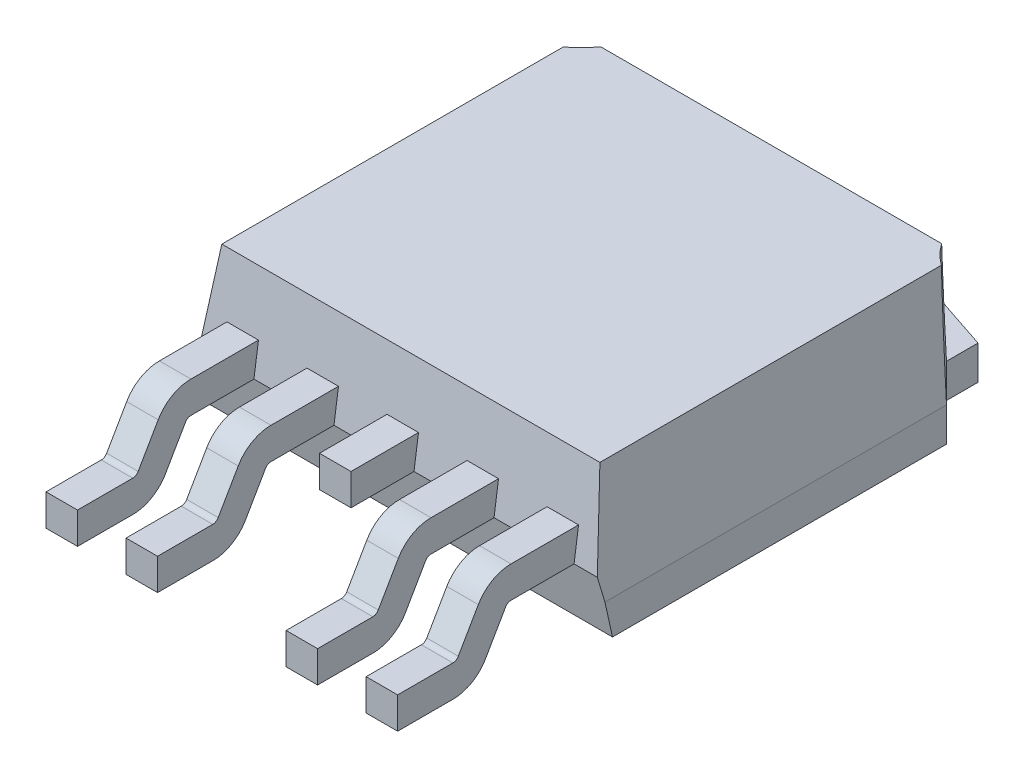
ISO-10303-21;
HEADER;
FILE_DESCRIPTION(('STEP AP214'),'2;1');
FILE_NAME('part.step','',(''),(''),'','','');
FILE_SCHEMA(('AUTOMOTIVE_DESIGN { 1 0 10303 214 1 1 1 1 }'));
ENDSEC;
DATA;
#1=APPLICATION_CONTEXT('core data for automotive mechanical design processes');
#2=APPLICATION_PROTOCOL_DEFINITION('international standard','automotive_design',2000,#1);
#3=PRODUCT_CONTEXT('',#1,'mechanical');
#4=PRODUCT('Part','Part','',(#3));
#5=PRODUCT_RELATED_PRODUCT_CATEGORY('part','',(#4));
#6=PRODUCT_DEFINITION_FORMATION('','',#4);
#7=PRODUCT_DEFINITION_CONTEXT('part definition',#1,'design');
#8=PRODUCT_DEFINITION('design','',#6,#7);
#9=PRODUCT_DEFINITION_SHAPE('','',#8);
#10=(LENGTH_UNIT() NAMED_UNIT(*) SI_UNIT(.MILLI.,.METRE.));
#11=(NAMED_UNIT(*) PLANE_ANGLE_UNIT() SI_UNIT($,.RADIAN.));
#12=(NAMED_UNIT(*) SI_UNIT($,.STERADIAN.) SOLID_ANGLE_UNIT());
#13=UNCERTAINTY_MEASURE_WITH_UNIT(LENGTH_MEASURE(1.E-05),#10,'distance_accuracy_value','');
#14=(GEOMETRIC_REPRESENTATION_CONTEXT(3) GLOBAL_UNCERTAINTY_ASSIGNED_CONTEXT((#13)) GLOBAL_UNIT_ASSIGNED_CONTEXT((#10,
#11,#12)) REPRESENTATION_CONTEXT('',''));
#15=CARTESIAN_POINT('',(0.,0.,0.));
#16=DIRECTION('',(0.,0.,1.));
#17=DIRECTION('',(1.,0.,0.));
#18=AXIS2_PLACEMENT_3D('',#15,#16,#17);
#19=CARTESIAN_POINT('',(-1.45,2.3,1.6));
#20=DIRECTION('',(0.,-0.14142135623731,-0.989949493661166));
#21=DIRECTION('',(0.,0.989949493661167,-0.14142135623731));
#22=AXIS2_PLACEMENT_3D('',#19,#20,#21);
#23=PLANE('',#22);
#24=DIRECTION('',(0.,0.989949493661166,-0.14142135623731));
#25=VECTOR('',#24,1.);
#26=CARTESIAN_POINT('',(2.6,0.9,1.8));
#27=LINE('',#26,#25);
#28=CARTESIAN_POINT('',(2.6,0.9,1.8));
#29=VERTEX_POINT('',#28);
#30=CARTESIAN_POINT('',(2.6,1.4,1.72857142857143));
#31=VERTEX_POINT('',#30);
#32=EDGE_CURVE('E521',#29,#31,#27,.T.);
#33=ORIENTED_EDGE('',*,*,#32,.F.);
#34=DIRECTION('',(1.,0.,0.));
#35=VECTOR('',#34,1.);
#36=CARTESIAN_POINT('',(-1.45,0.9,1.8));
#37=LINE('',#36,#35);
#38=CARTESIAN_POINT('',(3.37,0.9,1.8));
#39=VERTEX_POINT('',#38);
#40=EDGE_CURVE('E1046',#29,#39,#37,.T.);
#41=ORIENTED_EDGE('',*,*,#40,.T.);
#42=DIRECTION('',(0.,-0.989949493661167,0.14142135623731));
#43=VECTOR('',#42,1.);
#44=CARTESIAN_POINT('',(3.37,2.3,1.6));
#45=LINE('',#44,#43);
#46=CARTESIAN_POINT('',(3.37,1.4,1.72857142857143));
#47=VERTEX_POINT('',#46);
#48=EDGE_CURVE('E762',#47,#39,#45,.T.);
#49=ORIENTED_EDGE('',*,*,#48,.F.);
#50=DIRECTION('',(-1.,0.,0.));
#51=VECTOR('',#50,1.);
#52=CARTESIAN_POINT('',(-1.45,1.4,1.72857142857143));
#53=LINE('',#52,#51);
#54=CARTESIAN_POINT('',(3.87,1.4,1.72857142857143));
#55=VERTEX_POINT('',#54);
#56=EDGE_CURVE('E57',#55,#47,#53,.T.);
#57=ORIENTED_EDGE('',*,*,#56,.F.);
#58=DIRECTION('',(0.,-0.989949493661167,0.14142135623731));
#59=VECTOR('',#58,1.);
#60=CARTESIAN_POINT('',(3.87,2.3,1.6));
#61=LINE('',#60,#59);
#62=CARTESIAN_POINT('',(3.87,0.9,1.8));
#63=VERTEX_POINT('',#62);
#64=EDGE_CURVE('E766',#55,#63,#61,.T.);
#65=ORIENTED_EDGE('',*,*,#64,.T.);
#66=CARTESIAN_POINT('',(4.64,0.9,1.8));
#67=VERTEX_POINT('',#66);
#68=EDGE_CURVE('E1270',#63,#67,#37,.T.);
#69=ORIENTED_EDGE('',*,*,#68,.T.);
#70=DIRECTION('',(0.,-0.989949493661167,0.14142135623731));
#71=VECTOR('',#70,1.);
#72=CARTESIAN_POINT('',(4.64,2.3,1.6));
#73=LINE('',#72,#71);
#74=CARTESIAN_POINT('',(4.64,1.4,1.72857142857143));
#75=VERTEX_POINT('',#74);
#76=EDGE_CURVE('E645',#75,#67,#73,.T.);
#77=ORIENTED_EDGE('',*,*,#76,.F.);
#78=DIRECTION('',(-1.,0.,0.));
#79=VECTOR('',#78,1.);
#80=CARTESIAN_POINT('',(-1.45,1.4,1.72857142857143));
#81=LINE('',#80,#79);
#82=CARTESIAN_POINT('',(5.14,1.4,1.72857142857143));
#83=VERTEX_POINT('',#82);
#84=EDGE_CURVE('E12',#83,#75,#81,.T.);
#85=ORIENTED_EDGE('',*,*,#84,.F.);
#86=DIRECTION('',(0.,-0.989949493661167,0.14142135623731));
#87=VECTOR('',#86,1.);
#88=CARTESIAN_POINT('',(5.14,2.3,1.6));
#89=LINE('',#88,#87);
#90=CARTESIAN_POINT('',(5.14,0.9,1.8));
#91=VERTEX_POINT('',#90);
#92=EDGE_CURVE('E649',#83,#91,#89,.T.);
#93=ORIENTED_EDGE('',*,*,#92,.T.);
#94=CARTESIAN_POINT('',(5.50909090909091,0.9,1.8));
#95=VERTEX_POINT('',#94);
#96=EDGE_CURVE('E1039',#91,#95,#37,.T.);
#97=ORIENTED_EDGE('',*,*,#96,.T.);
#98=DIRECTION('',(-0.111789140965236,0.983744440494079,-0.140534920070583));
#99=VECTOR('',#98,1.);
#100=CARTESIAN_POINT('',(5.26502167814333,3.04780923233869,1.4931701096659));
#101=LINE('',#100,#99);
#102=CARTESIAN_POINT('',(5.35,2.3,1.6));
#103=VERTEX_POINT('',#102);
#104=EDGE_CURVE('E1223',#95,#103,#101,.T.);
#105=ORIENTED_EDGE('',*,*,#104,.T.);
#106=DIRECTION('',(1.,0.,0.));
#107=VECTOR('',#106,1.);
#108=CARTESIAN_POINT('',(-1.38921383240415,2.3,1.6));
#109=LINE('',#108,#107);
#110=CARTESIAN_POINT('',(-0.649999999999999,2.3,1.6));
#111=VERTEX_POINT('',#110);
#112=EDGE_CURVE('E1220',#111,#103,#109,.T.);
#113=ORIENTED_EDGE('',*,*,#112,.F.);
#114=DIRECTION('',(-0.111789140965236,-0.983744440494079,0.140534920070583));
#115=VECTOR('',#114,1.);
#116=CARTESIAN_POINT('',(-0.659997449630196,2.21202244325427,1.61256822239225));
#117=LINE('',#116,#115);
#118=CARTESIAN_POINT('',(-0.809090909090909,0.9,1.8));
#119=VERTEX_POINT('',#118);
#120=EDGE_CURVE('E1227',#111,#119,#117,.T.);
#121=ORIENTED_EDGE('',*,*,#120,.T.);
#122=CARTESIAN_POINT('',(-0.44,0.9,1.8));
#123=VERTEX_POINT('',#122);
#124=EDGE_CURVE('E1040',#119,#123,#37,.T.);
#125=ORIENTED_EDGE('',*,*,#124,.T.);
#126=DIRECTION('',(0.,-0.989949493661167,0.14142135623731));
#127=VECTOR('',#126,1.);
#128=CARTESIAN_POINT('',(-0.44,2.3,1.6));
#129=LINE('',#128,#127);
#130=CARTESIAN_POINT('',(-0.44,1.4,1.72857142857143));
#131=VERTEX_POINT('',#130);
#132=EDGE_CURVE('E996',#131,#123,#129,.T.);
#133=ORIENTED_EDGE('',*,*,#132,.F.);
#134=DIRECTION('',(-1.,0.,0.));
#135=VECTOR('',#134,1.);
#136=CARTESIAN_POINT('',(-1.45,1.4,1.72857142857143));
#137=LINE('',#136,#135);
#138=CARTESIAN_POINT('',(0.0600000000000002,1.4,1.72857142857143));
#139=VERTEX_POINT('',#138);
#140=EDGE_CURVE('E1235',#139,#131,#137,.T.);
#141=ORIENTED_EDGE('',*,*,#140,.F.);
#142=DIRECTION('',(0.,-0.989949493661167,0.14142135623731));
#143=VECTOR('',#142,1.);
#144=CARTESIAN_POINT('',(0.0599999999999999,2.3,1.6));
#145=LINE('',#144,#143);
#146=CARTESIAN_POINT('',(0.06,0.9,1.8));
#147=VERTEX_POINT('',#146);
#148=EDGE_CURVE('E1000',#139,#147,#145,.T.);
#149=ORIENTED_EDGE('',*,*,#148,.T.);
#150=CARTESIAN_POINT('',(0.83,0.9,1.8));
#151=VERTEX_POINT('',#150);
#152=EDGE_CURVE('E1286',#147,#151,#37,.T.);
#153=ORIENTED_EDGE('',*,*,#152,.T.);
#154=DIRECTION('',(0.,-0.989949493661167,0.14142135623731));
#155=VECTOR('',#154,1.);
#156=CARTESIAN_POINT('',(0.83,2.3,1.6));
#157=LINE('',#156,#155);
#158=CARTESIAN_POINT('',(0.83,1.4,1.72857142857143));
#159=VERTEX_POINT('',#158);
#160=EDGE_CURVE('E879',#159,#151,#157,.T.);
#161=ORIENTED_EDGE('',*,*,#160,.F.);
#162=DIRECTION('',(-1.,0.,0.));
#163=VECTOR('',#162,1.);
#164=CARTESIAN_POINT('',(-1.45,1.4,1.72857142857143));
#165=LINE('',#164,#163);
#166=CARTESIAN_POINT('',(1.33,1.4,1.72857142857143));
#167=VERTEX_POINT('',#166);
#168=EDGE_CURVE('E1239',#167,#159,#165,.T.);
#169=ORIENTED_EDGE('',*,*,#168,.F.);
#170=DIRECTION('',(0.,-0.989949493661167,0.14142135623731));
#171=VECTOR('',#170,1.);
#172=CARTESIAN_POINT('',(1.33,2.3,1.6));
#173=LINE('',#172,#171);
#174=CARTESIAN_POINT('',(1.33,0.9,1.8));
#175=VERTEX_POINT('',#174);
#176=EDGE_CURVE('E883',#167,#175,#173,.T.);
#177=ORIENTED_EDGE('',*,*,#176,.T.);
#178=CARTESIAN_POINT('',(2.1,0.9,1.8));
#179=VERTEX_POINT('',#178);
#180=EDGE_CURVE('E1277',#175,#179,#37,.T.);
#181=ORIENTED_EDGE('',*,*,#180,.T.);
#182=DIRECTION('',(0.,0.989949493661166,-0.14142135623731));
#183=VECTOR('',#182,1.);
#184=CARTESIAN_POINT('',(2.1,0.9,1.8));
#185=LINE('',#184,#183);
#186=CARTESIAN_POINT('',(2.1,1.4,1.72857142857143));
#187=VERTEX_POINT('',#186);
#188=EDGE_CURVE('E69',#179,#187,#185,.T.);
#189=ORIENTED_EDGE('',*,*,#188,.T.);
#190=DIRECTION('',(-1.,0.,0.));
#191=VECTOR('',#190,1.);
#192=CARTESIAN_POINT('',(2.6,1.4,1.72857142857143));
#193=LINE('',#192,#191);
#194=EDGE_CURVE('E64',#31,#187,#193,.T.);
#195=ORIENTED_EDGE('',*,*,#194,.F.);
#196=EDGE_LOOP('',(#33,#41,#49,#57,#65,#69,#77,#85,#93,#97,#105,#113,#121,#125,#133,#141,#149,
#153,#161,#169,#177,#181,#189,#195));
#197=FACE_BOUND('',#196,.T.);
#198=ADVANCED_FACE('F48',(#197),#23,.F.);
#199=CARTESIAN_POINT('',(-1.38921383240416,0.,-4.83921383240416));
#200=DIRECTION('',(0.,-1.,0.));
#201=DIRECTION('',(0.,0.,-1.));
#202=AXIS2_PLACEMENT_3D('',#199,#200,#201);
#203=PLANE('',#202);
#204=DIRECTION('',(1.,0.,0.));
#205=VECTOR('',#204,1.);
#206=CARTESIAN_POINT('',(-1.45,0.,1.6));
#207=LINE('',#206,#205);
#208=CARTESIAN_POINT('',(-0.849999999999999,0.,1.6));
#209=VERTEX_POINT('',#208);
#210=CARTESIAN_POINT('',(5.55,0.,1.6));
#211=VERTEX_POINT('',#210);
#212=EDGE_CURVE('E1007',#209,#211,#207,.T.);
#213=ORIENTED_EDGE('',*,*,#212,.F.);
#214=DIRECTION('',(0.,0.,1.));
#215=VECTOR('',#214,1.);
#216=CARTESIAN_POINT('',(-0.849999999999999,0.,1.8));
#217=LINE('',#216,#215);
#218=CARTESIAN_POINT('',(-0.849999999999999,0.,-3.7));
#219=VERTEX_POINT('',#218);
#220=EDGE_CURVE('E1194',#219,#209,#217,.T.);
#221=ORIENTED_EDGE('',*,*,#220,.F.);
#222=CARTESIAN_POINT('',(-1.38921383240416,0.,-4.83921383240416));
#223=DIRECTION('',(0.,-1.,0.));
#224=DIRECTION('',(0.,0.,-1.));
#225=AXIS2_PLACEMENT_3D('',#222,#223,#224);
#226=CIRCLE('',#225,1.2603807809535);
#227=CARTESIAN_POINT('',(-0.25,0.,-4.3));
#228=VERTEX_POINT('',#227);
#229=EDGE_CURVE('E1181',#228,#219,#226,.T.);
#230=ORIENTED_EDGE('',*,*,#229,.F.);
#231=DIRECTION('',(0.,0.,1.));
#232=VECTOR('',#231,1.);
#233=CARTESIAN_POINT('',(-0.25,0.,-4.3));
#234=LINE('',#233,#232);
#235=CARTESIAN_POINT('',(-0.25,0.,-3.8));
#236=VERTEX_POINT('',#235);
#237=EDGE_CURVE('E1144',#228,#236,#234,.T.);
#238=ORIENTED_EDGE('',*,*,#237,.T.);
#239=DIRECTION('',(1.,0.,0.));
#240=VECTOR('',#239,1.);
#241=CARTESIAN_POINT('',(-0.25,0.,-3.8));
#242=LINE('',#241,#240);
#243=CARTESIAN_POINT('',(0.,0.,-3.8));
#244=VERTEX_POINT('',#243);
#245=EDGE_CURVE('E1148',#236,#244,#242,.T.);
#246=ORIENTED_EDGE('',*,*,#245,.T.);
#247=DIRECTION('',(0.,0.,1.));
#248=VECTOR('',#247,1.);
#249=CARTESIAN_POINT('',(0.,0.,-3.8));
#250=LINE('',#249,#248);
#251=CARTESIAN_POINT('',(0.,0.,0.));
#252=VERTEX_POINT('',#251);
#253=EDGE_CURVE('E1105',#244,#252,#250,.T.);
#254=ORIENTED_EDGE('',*,*,#253,.T.);
#255=DIRECTION('',(1.,0.,0.));
#256=VECTOR('',#255,1.);
#257=CARTESIAN_POINT('',(0.,0.,0.));
#258=LINE('',#257,#256);
#259=CARTESIAN_POINT('',(4.7,0.,0.));
#260=VERTEX_POINT('',#259);
#261=EDGE_CURVE('E1099',#252,#260,#258,.T.);
#262=ORIENTED_EDGE('',*,*,#261,.T.);
#263=DIRECTION('',(0.,0.,-1.));
#264=VECTOR('',#263,1.);
#265=CARTESIAN_POINT('',(4.7,0.,0.));
#266=LINE('',#265,#264);
#267=CARTESIAN_POINT('',(4.7,0.,-3.8));
#268=VERTEX_POINT('',#267);
#269=EDGE_CURVE('E1132',#260,#268,#266,.T.);
#270=ORIENTED_EDGE('',*,*,#269,.T.);
#271=DIRECTION('',(1.,0.,0.));
#272=VECTOR('',#271,1.);
#273=CARTESIAN_POINT('',(4.7,0.,-3.8));
#274=LINE('',#273,#272);
#275=CARTESIAN_POINT('',(4.95,0.,-3.8));
#276=VERTEX_POINT('',#275);
#277=EDGE_CURVE('E1136',#268,#276,#274,.T.);
#278=ORIENTED_EDGE('',*,*,#277,.T.);
#279=DIRECTION('',(0.,0.,-1.));
#280=VECTOR('',#279,1.);
#281=CARTESIAN_POINT('',(4.95,0.,-3.8));
#282=LINE('',#281,#280);
#283=CARTESIAN_POINT('',(4.95,0.,-4.3));
#284=VERTEX_POINT('',#283);
#285=EDGE_CURVE('E1140',#276,#284,#282,.T.);
#286=ORIENTED_EDGE('',*,*,#285,.T.);
#287=CARTESIAN_POINT('',(6.08921383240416,0.,-4.83921383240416));
#288=DIRECTION('',(0.,-1.,0.));
#289=DIRECTION('',(0.,0.,1.));
#290=AXIS2_PLACEMENT_3D('',#287,#288,#289);
#291=CIRCLE('',#290,1.2603807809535);
#292=CARTESIAN_POINT('',(5.55,0.,-3.7));
#293=VERTEX_POINT('',#292);
#294=EDGE_CURVE('E1187',#293,#284,#291,.T.);
#295=ORIENTED_EDGE('',*,*,#294,.F.);
#296=DIRECTION('',(0.,0.,-1.));
#297=VECTOR('',#296,1.);
#298=CARTESIAN_POINT('',(5.55,0.,-3.7));
#299=LINE('',#298,#297);
#300=EDGE_CURVE('E1198',#211,#293,#299,.T.);
#301=ORIENTED_EDGE('',*,*,#300,.F.);
#302=EDGE_LOOP('',(#213,#221,#230,#238,#246,#254,#262,#270,#278,#286,#295,#301));
#303=FACE_BOUND('',#302,.T.);
#304=ADVANCED_FACE('F1361',(#303),#203,.T.);
#305=CARTESIAN_POINT('',(-1.38921383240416,2.3,-4.83921383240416));
#306=DIRECTION('',(0.,-1.,0.));
#307=DIRECTION('',(0.,0.,-1.));
#308=AXIS2_PLACEMENT_3D('',#305,#306,#307);
#309=CYLINDRICAL_SURFACE('',#308,1.2603807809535);
#310=DIRECTION('',(0.,-1.,0.));
#311=VECTOR('',#310,1.);
#312=CARTESIAN_POINT('',(-0.849999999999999,2.3,-3.7));
#313=LINE('',#312,#311);
#314=CARTESIAN_POINT('',(-0.85,0.54,-3.7));
#315=VERTEX_POINT('',#314);
#316=EDGE_CURVE('E1213',#315,#219,#313,.T.);
#317=ORIENTED_EDGE('',*,*,#316,.F.);
#318=CARTESIAN_POINT('',(-1.38921383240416,-4.20508172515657,-4.83921383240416));
#319=DIRECTION('',(0.993605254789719,-0.112909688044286,0.));
#320=DIRECTION('',(-0.112909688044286,-0.993605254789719,0.));
#321=AXIS2_PLACEMENT_3D('',#318,#319,#320);
#322=ELLIPSE('',#321,11.1627337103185,1.2603807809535);
#323=CARTESIAN_POINT('',(-0.649999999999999,2.3,-3.81836975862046));
#324=VERTEX_POINT('',#323);
#325=EDGE_CURVE('E1022',#315,#324,#322,.F.);
#326=ORIENTED_EDGE('',*,*,#325,.T.);
#327=CARTESIAN_POINT('',(-1.38921383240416,2.3,-4.83921383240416));
#328=DIRECTION('',(0.,-1.,0.));
#329=DIRECTION('',(0.,0.,-1.));
#330=AXIS2_PLACEMENT_3D('',#327,#328,#329);
#331=CIRCLE('',#330,1.2603807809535);
#332=CARTESIAN_POINT('',(-0.355638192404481,2.3,-4.11790868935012));
#333=VERTEX_POINT('',#332);
#334=EDGE_CURVE('E1182',#333,#324,#331,.T.);
#335=ORIENTED_EDGE('',*,*,#334,.F.);
#336=CARTESIAN_POINT('',(-1.38921383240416,-4.67176074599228,-4.83921383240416));
#337=DIRECTION('',(0.,-0.102911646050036,0.994690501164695));
#338=DIRECTION('',(0.,-0.994690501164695,-0.102911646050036));
#339=AXIS2_PLACEMENT_3D('',#336,#337,#338);
#340=ELLIPSE('',#339,12.2472123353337,1.2603807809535);
#341=CARTESIAN_POINT('',(-0.25,0.54,-4.3));
#342=VERTEX_POINT('',#341);
#343=EDGE_CURVE('E1054',#333,#342,#340,.F.);
#344=ORIENTED_EDGE('',*,*,#343,.T.);
#345=DIRECTION('',(0.,-1.,0.));
#346=VECTOR('',#345,1.);
#347=CARTESIAN_POINT('',(-0.25,2.3,-4.3));
#348=LINE('',#347,#346);
#349=CARTESIAN_POINT('',(-0.25,0.05,-4.3));
#350=VERTEX_POINT('',#349);
#351=EDGE_CURVE('E1190',#342,#350,#348,.T.);
#352=ORIENTED_EDGE('',*,*,#351,.T.);
#353=DIRECTION('',(0.,-1.,0.));
#354=VECTOR('',#353,1.);
#355=CARTESIAN_POINT('',(-0.25,0.05,-4.3));
#356=LINE('',#355,#354);
#357=EDGE_CURVE('E1164',#350,#228,#356,.T.);
#358=ORIENTED_EDGE('',*,*,#357,.T.);
#359=ORIENTED_EDGE('',*,*,#229,.T.);
#360=EDGE_LOOP('',(#317,#326,#335,#344,#352,#358,#359));
#361=FACE_BOUND('',#360,.T.);
#362=ADVANCED_FACE('F50',(#361),#309,.F.);
#363=CARTESIAN_POINT('',(-0.849999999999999,2.3,1.8));
#364=DIRECTION('',(1.,0.,0.));
#365=DIRECTION('',(0.,0.,-1.));
#366=AXIS2_PLACEMENT_3D('',#363,#364,#365);
#367=PLANE('',#366);
#368=ORIENTED_EDGE('',*,*,#220,.T.);
#369=DIRECTION('',(0.,0.976187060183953,0.216930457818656));
#370=VECTOR('',#369,1.);
#371=CARTESIAN_POINT('',(-0.849999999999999,2.23411764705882,2.0964705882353));
#372=LINE('',#371,#370);
#373=CARTESIAN_POINT('',(-0.85,0.54,1.72));
#374=VERTEX_POINT('',#373);
#375=EDGE_CURVE('E1010',#209,#374,#372,.T.);
#376=ORIENTED_EDGE('',*,*,#375,.T.);
#377=DIRECTION('',(0.,0.,-1.));
#378=VECTOR('',#377,1.);
#379=CARTESIAN_POINT('',(-0.85,0.54,2.7));
#380=LINE('',#379,#378);
#381=EDGE_CURVE('E1018',#374,#315,#380,.T.);
#382=ORIENTED_EDGE('',*,*,#381,.T.);
#383=ORIENTED_EDGE('',*,*,#316,.T.);
#384=EDGE_LOOP('',(#368,#376,#382,#383));
#385=FACE_BOUND('',#384,.T.);
#386=ADVANCED_FACE('F1441',(#385),#367,.F.);
#387=CARTESIAN_POINT('',(5.55,2.3,-3.7));
#388=DIRECTION('',(-1.,0.,0.));
#389=DIRECTION('',(0.,0.,1.));
#390=AXIS2_PLACEMENT_3D('',#387,#388,#389);
#391=PLANE('',#390);
#392=DIRECTION('',(0.,0.,-1.));
#393=VECTOR('',#392,1.);
#394=CARTESIAN_POINT('',(5.55,0.54,2.7));
#395=LINE('',#394,#393);
#396=CARTESIAN_POINT('',(5.55,0.539999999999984,1.72));
#397=VERTEX_POINT('',#396);
#398=CARTESIAN_POINT('',(5.55,0.54,-3.7));
#399=VERTEX_POINT('',#398);
#400=EDGE_CURVE('E1029',#397,#399,#395,.T.);
#401=ORIENTED_EDGE('',*,*,#400,.F.);
#402=DIRECTION('',(0.,0.976187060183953,0.216930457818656));
#403=VECTOR('',#402,1.);
#404=CARTESIAN_POINT('',(5.55,0.9,1.8));
#405=LINE('',#404,#403);
#406=EDGE_CURVE('E1004',#211,#397,#405,.T.);
#407=ORIENTED_EDGE('',*,*,#406,.F.);
#408=ORIENTED_EDGE('',*,*,#300,.T.);
#409=DIRECTION('',(0.,-1.,0.));
#410=VECTOR('',#409,1.);
#411=CARTESIAN_POINT('',(5.55,2.3,-3.7));
#412=LINE('',#411,#410);
#413=EDGE_CURVE('E1209',#399,#293,#412,.T.);
#414=ORIENTED_EDGE('',*,*,#413,.F.);
#415=EDGE_LOOP('',(#401,#407,#408,#414));
#416=FACE_BOUND('',#415,.T.);
#417=ADVANCED_FACE('F1438',(#416),#391,.F.);
#418=CARTESIAN_POINT('',(6.08921383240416,2.3,-4.83921383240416));
#419=DIRECTION('',(0.,-1.,0.));
#420=DIRECTION('',(0.,0.,-1.));
#421=AXIS2_PLACEMENT_3D('',#418,#419,#420);
#422=CYLINDRICAL_SURFACE('',#421,1.2603807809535);
#423=CARTESIAN_POINT('',(6.08921383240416,2.3,-4.83921383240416));
#424=DIRECTION('',(0.,-1.,0.));
#425=DIRECTION('',(0.,0.,1.));
#426=AXIS2_PLACEMENT_3D('',#423,#424,#425);
#427=CIRCLE('',#426,1.2603807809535);
#428=CARTESIAN_POINT('',(5.35,2.3,-3.81836975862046));
#429=VERTEX_POINT('',#428);
#430=CARTESIAN_POINT('',(5.05563819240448,2.3,-4.11790868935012));
#431=VERTEX_POINT('',#430);
#432=EDGE_CURVE('E1186',#429,#431,#427,.T.);
#433=ORIENTED_EDGE('',*,*,#432,.F.);
#434=CARTESIAN_POINT('',(6.08921383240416,-4.2050817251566,-4.83921383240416));
#435=DIRECTION('',(-0.993605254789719,-0.112909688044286,0.));
#436=DIRECTION('',(0.112909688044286,-0.993605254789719,0.));
#437=AXIS2_PLACEMENT_3D('',#434,#435,#436);
#438=ELLIPSE('',#437,11.1627337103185,1.2603807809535);
#439=EDGE_CURVE('E1032',#429,#399,#438,.F.);
#440=ORIENTED_EDGE('',*,*,#439,.T.);
#441=ORIENTED_EDGE('',*,*,#413,.T.);
#442=ORIENTED_EDGE('',*,*,#294,.T.);
#443=DIRECTION('',(0.,-1.,0.));
#444=VECTOR('',#443,1.);
#445=CARTESIAN_POINT('',(4.95,0.05,-4.3));
#446=LINE('',#445,#444);
#447=CARTESIAN_POINT('',(4.95,0.05,-4.3));
#448=VERTEX_POINT('',#447);
#449=EDGE_CURVE('E1168',#448,#284,#446,.T.);
#450=ORIENTED_EDGE('',*,*,#449,.F.);
#451=DIRECTION('',(0.,-1.,0.));
#452=VECTOR('',#451,1.);
#453=CARTESIAN_POINT('',(4.95,2.3,-4.3));
#454=LINE('',#453,#452);
#455=CARTESIAN_POINT('',(4.95,0.54,-4.3));
#456=VERTEX_POINT('',#455);
#457=EDGE_CURVE('E1206',#456,#448,#454,.T.);
#458=ORIENTED_EDGE('',*,*,#457,.F.);
#459=CARTESIAN_POINT('',(6.08921383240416,-4.67176074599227,-4.83921383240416));
#460=DIRECTION('',(0.,-0.102911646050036,0.994690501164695));
#461=DIRECTION('',(0.,-0.994690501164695,-0.102911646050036));
#462=AXIS2_PLACEMENT_3D('',#459,#460,#461);
#463=ELLIPSE('',#462,12.2472123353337,1.2603807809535);
#464=EDGE_CURVE('E1050',#456,#431,#463,.F.);
#465=ORIENTED_EDGE('',*,*,#464,.T.);
#466=EDGE_LOOP('',(#433,#440,#441,#442,#450,#458,#465));
#467=FACE_BOUND('',#466,.T.);
#468=ADVANCED_FACE('F1434',(#467),#422,.F.);
#469=CARTESIAN_POINT('',(-0.25,2.3,-4.3));
#470=DIRECTION('',(0.,0.,1.));
#471=DIRECTION('',(1.,0.,0.));
#472=AXIS2_PLACEMENT_3D('',#469,#470,#471);
#473=PLANE('',#472);
#474=ORIENTED_EDGE('',*,*,#351,.F.);
#475=DIRECTION('',(1.,0.,0.));
#476=VECTOR('',#475,1.);
#477=CARTESIAN_POINT('',(-1.45,0.54,-4.3));
#478=LINE('',#477,#476);
#479=EDGE_CURVE('E1044',#342,#456,#478,.T.);
#480=ORIENTED_EDGE('',*,*,#479,.T.);
#481=ORIENTED_EDGE('',*,*,#457,.T.);
#482=DIRECTION('',(-1.,0.,0.));
#483=VECTOR('',#482,1.);
#484=CARTESIAN_POINT('',(4.95,0.05,-4.3));
#485=LINE('',#484,#483);
#486=EDGE_CURVE('E1115',#448,#350,#485,.T.);
#487=ORIENTED_EDGE('',*,*,#486,.T.);
#488=EDGE_LOOP('',(#474,#480,#481,#487));
#489=FACE_BOUND('',#488,.T.);
#490=ADVANCED_FACE('F1427',(#489),#473,.F.);
#491=CARTESIAN_POINT('',(-1.38921383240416,2.3,-4.83921383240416));
#492=DIRECTION('',(0.,-1.,0.));
#493=DIRECTION('',(0.,0.,-1.));
#494=AXIS2_PLACEMENT_3D('',#491,#492,#493);
#495=PLANE('',#494);
#496=ORIENTED_EDGE('',*,*,#334,.T.);
#497=DIRECTION('',(0.,0.,-1.));
#498=VECTOR('',#497,1.);
#499=CARTESIAN_POINT('',(-0.649999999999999,2.3,2.7));
#500=LINE('',#499,#498);
#501=EDGE_CURVE('E1019',#111,#324,#500,.T.);
#502=ORIENTED_EDGE('',*,*,#501,.F.);
#503=ORIENTED_EDGE('',*,*,#112,.T.);
#504=DIRECTION('',(0.,0.,-1.));
#505=VECTOR('',#504,1.);
#506=CARTESIAN_POINT('',(5.35,2.3,2.7));
#507=LINE('',#506,#505);
#508=EDGE_CURVE('E1028',#103,#429,#507,.T.);
#509=ORIENTED_EDGE('',*,*,#508,.T.);
#510=ORIENTED_EDGE('',*,*,#432,.T.);
#511=DIRECTION('',(-1.,0.,0.));
#512=VECTOR('',#511,1.);
#513=CARTESIAN_POINT('',(-1.38921383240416,2.3,-4.11790868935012));
#514=LINE('',#513,#512);
#515=EDGE_CURVE('E1216',#431,#333,#514,.T.);
#516=ORIENTED_EDGE('',*,*,#515,.T.);
#517=EDGE_LOOP('',(#496,#502,#503,#509,#510,#516));
#518=FACE_BOUND('',#517,.T.);
#519=ADVANCED_FACE('F1398',(#518),#495,.F.);
#520=CARTESIAN_POINT('',(0.,0.05,0.));
#521=DIRECTION('',(0.,1.,0.));
#522=DIRECTION('',(0.,0.,1.));
#523=AXIS2_PLACEMENT_3D('',#520,#521,#522);
#524=PLANE('',#523);
#525=DIRECTION('',(1.,0.,0.));
#526=VECTOR('',#525,1.);
#527=CARTESIAN_POINT('',(0.,0.05,0.));
#528=LINE('',#527,#526);
#529=CARTESIAN_POINT('',(0.,0.05,0.));
#530=VERTEX_POINT('',#529);
#531=CARTESIAN_POINT('',(4.7,0.05,0.));
#532=VERTEX_POINT('',#531);
#533=EDGE_CURVE('E1100',#530,#532,#528,.T.);
#534=ORIENTED_EDGE('',*,*,#533,.F.);
#535=DIRECTION('',(0.,0.,1.));
#536=VECTOR('',#535,1.);
#537=CARTESIAN_POINT('',(0.,0.05,-3.8));
#538=LINE('',#537,#536);
#539=CARTESIAN_POINT('',(0.,0.05,-3.8));
#540=VERTEX_POINT('',#539);
#541=EDGE_CURVE('E1125',#540,#530,#538,.T.);
#542=ORIENTED_EDGE('',*,*,#541,.F.);
#543=DIRECTION('',(1.,0.,0.));
#544=VECTOR('',#543,1.);
#545=CARTESIAN_POINT('',(-0.25,0.05,-3.8));
#546=LINE('',#545,#544);
#547=CARTESIAN_POINT('',(-0.25,0.05,-3.8));
#548=VERTEX_POINT('',#547);
#549=EDGE_CURVE('E1122',#548,#540,#546,.T.);
#550=ORIENTED_EDGE('',*,*,#549,.F.);
#551=DIRECTION('',(0.,0.,1.));
#552=VECTOR('',#551,1.);
#553=CARTESIAN_POINT('',(-0.25,0.05,-4.3));
#554=LINE('',#553,#552);
#555=EDGE_CURVE('E1119',#350,#548,#554,.T.);
#556=ORIENTED_EDGE('',*,*,#555,.F.);
#557=ORIENTED_EDGE('',*,*,#486,.F.);
#558=DIRECTION('',(0.,0.,-1.));
#559=VECTOR('',#558,1.);
#560=CARTESIAN_POINT('',(4.95,0.05,-3.8));
#561=LINE('',#560,#559);
#562=CARTESIAN_POINT('',(4.95,0.05,-3.8));
#563=VERTEX_POINT('',#562);
#564=EDGE_CURVE('E1111',#563,#448,#561,.T.);
#565=ORIENTED_EDGE('',*,*,#564,.F.);
#566=DIRECTION('',(1.,0.,0.));
#567=VECTOR('',#566,1.);
#568=CARTESIAN_POINT('',(4.7,0.05,-3.8));
#569=LINE('',#568,#567);
#570=CARTESIAN_POINT('',(4.7,0.05,-3.8));
#571=VERTEX_POINT('',#570);
#572=EDGE_CURVE('E1108',#571,#563,#569,.T.);
#573=ORIENTED_EDGE('',*,*,#572,.F.);
#574=DIRECTION('',(0.,0.,-1.));
#575=VECTOR('',#574,1.);
#576=CARTESIAN_POINT('',(4.7,0.05,0.));
#577=LINE('',#576,#575);
#578=EDGE_CURVE('E1104',#532,#571,#577,.T.);
#579=ORIENTED_EDGE('',*,*,#578,.F.);
#580=EDGE_LOOP('',(#534,#542,#550,#556,#557,#565,#573,#579));
#581=FACE_BOUND('',#580,.T.);
#582=DIRECTION('',(-1.,0.,0.));
#583=VECTOR('',#582,1.);
#584=CARTESIAN_POINT('',(3.15,0.05,-3.9));
#585=LINE('',#584,#583);
#586=CARTESIAN_POINT('',(3.15,0.05,-3.9));
#587=VERTEX_POINT('',#586);
#588=CARTESIAN_POINT('',(1.55,0.05,-3.9));
#589=VERTEX_POINT('',#588);
#590=EDGE_CURVE('E1062',#587,#589,#585,.T.);
#591=ORIENTED_EDGE('',*,*,#590,.T.);
#592=CARTESIAN_POINT('',(1.55,0.05,-3.6));
#593=DIRECTION('',(0.,1.,0.));
#594=DIRECTION('',(0.,0.,1.));
#595=AXIS2_PLACEMENT_3D('',#592,#593,#594);
#596=CIRCLE('',#595,0.3);
#597=CARTESIAN_POINT('',(1.55,0.05,-3.3));
#598=VERTEX_POINT('',#597);
#599=EDGE_CURVE('E1066',#589,#598,#596,.T.);
#600=ORIENTED_EDGE('',*,*,#599,.T.);
#601=DIRECTION('',(1.,0.,0.));
#602=VECTOR('',#601,1.);
#603=CARTESIAN_POINT('',(1.55,0.05,-3.3));
#604=LINE('',#603,#602);
#605=CARTESIAN_POINT('',(3.15,0.05,-3.3));
#606=VERTEX_POINT('',#605);
#607=EDGE_CURVE('E1070',#598,#606,#604,.T.);
#608=ORIENTED_EDGE('',*,*,#607,.T.);
#609=CARTESIAN_POINT('',(3.15,0.05,-3.6));
#610=DIRECTION('',(0.,1.,0.));
#611=DIRECTION('',(0.,0.,1.));
#612=AXIS2_PLACEMENT_3D('',#609,#610,#611);
#613=CIRCLE('',#612,0.3);
#614=EDGE_CURVE('E1059',#606,#587,#613,.T.);
#615=ORIENTED_EDGE('',*,*,#614,.T.);
#616=EDGE_LOOP('',(#591,#600,#608,#615));
#617=FACE_BOUND('',#616,.T.);
#618=ADVANCED_FACE('F1394',(#581,#617),#524,.F.);
#619=CARTESIAN_POINT('',(0.,0.05,0.));
#620=DIRECTION('',(0.,0.,-1.));
#621=DIRECTION('',(-1.,0.,0.));
#622=AXIS2_PLACEMENT_3D('',#619,#620,#621);
#623=PLANE('',#622);
#624=ORIENTED_EDGE('',*,*,#261,.F.);
#625=DIRECTION('',(0.,-1.,0.));
#626=VECTOR('',#625,1.);
#627=CARTESIAN_POINT('',(0.,0.05,0.));
#628=LINE('',#627,#626);
#629=EDGE_CURVE('E1128',#530,#252,#628,.T.);
#630=ORIENTED_EDGE('',*,*,#629,.F.);
#631=ORIENTED_EDGE('',*,*,#533,.T.);
#632=DIRECTION('',(0.,-1.,0.));
#633=VECTOR('',#632,1.);
#634=CARTESIAN_POINT('',(4.7,0.05,0.));
#635=LINE('',#634,#633);
#636=EDGE_CURVE('E1177',#532,#260,#635,.T.);
#637=ORIENTED_EDGE('',*,*,#636,.T.);
#638=EDGE_LOOP('',(#624,#630,#631,#637));
#639=FACE_BOUND('',#638,.T.);
#640=ADVANCED_FACE('F1397',(#639),#623,.T.);
#641=CARTESIAN_POINT('',(4.7,0.05,0.));
#642=DIRECTION('',(-1.,0.,0.));
#643=DIRECTION('',(0.,0.,1.));
#644=AXIS2_PLACEMENT_3D('',#641,#642,#643);
#645=PLANE('',#644);
#646=ORIENTED_EDGE('',*,*,#269,.F.);
#647=ORIENTED_EDGE('',*,*,#636,.F.);
#648=ORIENTED_EDGE('',*,*,#578,.T.);
#649=DIRECTION('',(0.,-1.,0.));
#650=VECTOR('',#649,1.);
#651=CARTESIAN_POINT('',(4.7,0.05,-3.8));
#652=LINE('',#651,#650);
#653=EDGE_CURVE('E1174',#571,#268,#652,.T.);
#654=ORIENTED_EDGE('',*,*,#653,.T.);
#655=EDGE_LOOP('',(#646,#647,#648,#654));
#656=FACE_BOUND('',#655,.T.);
#657=ADVANCED_FACE('F1418',(#656),#645,.T.);
#658=CARTESIAN_POINT('',(4.7,0.05,-3.8));
#659=DIRECTION('',(0.,0.,-1.));
#660=DIRECTION('',(-1.,0.,0.));
#661=AXIS2_PLACEMENT_3D('',#658,#659,#660);
#662=PLANE('',#661);
#663=ORIENTED_EDGE('',*,*,#277,.F.);
#664=ORIENTED_EDGE('',*,*,#653,.F.);
#665=ORIENTED_EDGE('',*,*,#572,.T.);
#666=DIRECTION('',(0.,-1.,0.));
#667=VECTOR('',#666,1.);
#668=CARTESIAN_POINT('',(4.95,0.05,-3.8));
#669=LINE('',#668,#667);
#670=EDGE_CURVE('E1171',#563,#276,#669,.T.);
#671=ORIENTED_EDGE('',*,*,#670,.T.);
#672=EDGE_LOOP('',(#663,#664,#665,#671));
#673=FACE_BOUND('',#672,.T.);
#674=ADVANCED_FACE('F1414',(#673),#662,.T.);
#675=CARTESIAN_POINT('',(4.95,0.05,-3.8));
#676=DIRECTION('',(-1.,0.,0.));
#677=DIRECTION('',(0.,0.,1.));
#678=AXIS2_PLACEMENT_3D('',#675,#676,#677);
#679=PLANE('',#678);
#680=ORIENTED_EDGE('',*,*,#285,.F.);
#681=ORIENTED_EDGE('',*,*,#670,.F.);
#682=ORIENTED_EDGE('',*,*,#564,.T.);
#683=ORIENTED_EDGE('',*,*,#449,.T.);
#684=EDGE_LOOP('',(#680,#681,#682,#683));
#685=FACE_BOUND('',#684,.T.);
#686=ADVANCED_FACE('F1410',(#685),#679,.T.);
#687=CARTESIAN_POINT('',(-0.25,0.05,-4.3));
#688=DIRECTION('',(1.,0.,0.));
#689=DIRECTION('',(0.,0.,-1.));
#690=AXIS2_PLACEMENT_3D('',#687,#688,#689);
#691=PLANE('',#690);
#692=ORIENTED_EDGE('',*,*,#237,.F.);
#693=ORIENTED_EDGE('',*,*,#357,.F.);
#694=ORIENTED_EDGE('',*,*,#555,.T.);
#695=DIRECTION('',(0.,-1.,0.));
#696=VECTOR('',#695,1.);
#697=CARTESIAN_POINT('',(-0.25,0.05,-3.8));
#698=LINE('',#697,#696);
#699=EDGE_CURVE('E1161',#548,#236,#698,.T.);
#700=ORIENTED_EDGE('',*,*,#699,.T.);
#701=EDGE_LOOP('',(#692,#693,#694,#700));
#702=FACE_BOUND('',#701,.T.);
#703=ADVANCED_FACE('F1406',(#702),#691,.T.);
#704=CARTESIAN_POINT('',(-0.25,0.05,-3.8));
#705=DIRECTION('',(0.,0.,-1.));
#706=DIRECTION('',(-1.,0.,0.));
#707=AXIS2_PLACEMENT_3D('',#704,#705,#706);
#708=PLANE('',#707);
#709=ORIENTED_EDGE('',*,*,#245,.F.);
#710=ORIENTED_EDGE('',*,*,#699,.F.);
#711=ORIENTED_EDGE('',*,*,#549,.T.);
#712=DIRECTION('',(0.,-1.,0.));
#713=VECTOR('',#712,1.);
#714=CARTESIAN_POINT('',(0.,0.05,-3.8));
#715=LINE('',#714,#713);
#716=EDGE_CURVE('E1158',#540,#244,#715,.T.);
#717=ORIENTED_EDGE('',*,*,#716,.T.);
#718=EDGE_LOOP('',(#709,#710,#711,#717));
#719=FACE_BOUND('',#718,.T.);
#720=ADVANCED_FACE('F1402',(#719),#708,.T.);
#721=CARTESIAN_POINT('',(0.,0.05,-3.8));
#722=DIRECTION('',(1.,0.,0.));
#723=DIRECTION('',(0.,0.,-1.));
#724=AXIS2_PLACEMENT_3D('',#721,#722,#723);
#725=PLANE('',#724);
#726=ORIENTED_EDGE('',*,*,#253,.F.);
#727=ORIENTED_EDGE('',*,*,#716,.F.);
#728=ORIENTED_EDGE('',*,*,#541,.T.);
#729=ORIENTED_EDGE('',*,*,#629,.T.);
#730=EDGE_LOOP('',(#726,#727,#728,#729));
#731=FACE_BOUND('',#730,.T.);
#732=ADVANCED_FACE('F1392',(#731),#725,.T.);
#733=CARTESIAN_POINT('',(3.15,0.05,-3.6));
#734=DIRECTION('',(0.,-1.,0.));
#735=DIRECTION('',(0.,0.,-1.));
#736=AXIS2_PLACEMENT_3D('',#733,#734,#735);
#737=CYLINDRICAL_SURFACE('',#736,0.3);
#738=CARTESIAN_POINT('',(3.15,0.,-3.6));
#739=DIRECTION('',(0.,1.,0.));
#740=DIRECTION('',(0.,0.,1.));
#741=AXIS2_PLACEMENT_3D('',#738,#739,#740);
#742=CIRCLE('',#741,0.3);
#743=CARTESIAN_POINT('',(3.15,0.,-3.3));
#744=VERTEX_POINT('',#743);
#745=CARTESIAN_POINT('',(3.15,0.,-3.9));
#746=VERTEX_POINT('',#745);
#747=EDGE_CURVE('E1058',#744,#746,#742,.T.);
#748=ORIENTED_EDGE('',*,*,#747,.T.);
#749=DIRECTION('',(0.,-1.,0.));
#750=VECTOR('',#749,1.);
#751=CARTESIAN_POINT('',(3.15,0.05,-3.9));
#752=LINE('',#751,#750);
#753=EDGE_CURVE('E1096',#587,#746,#752,.T.);
#754=ORIENTED_EDGE('',*,*,#753,.F.);
#755=ORIENTED_EDGE('',*,*,#614,.F.);
#756=DIRECTION('',(0.,-1.,0.));
#757=VECTOR('',#756,1.);
#758=CARTESIAN_POINT('',(3.15,0.05,-3.3));
#759=LINE('',#758,#757);
#760=EDGE_CURVE('E1073',#606,#744,#759,.T.);
#761=ORIENTED_EDGE('',*,*,#760,.T.);
#762=EDGE_LOOP('',(#748,#754,#755,#761));
#763=FACE_BOUND('',#762,.T.);
#764=ADVANCED_FACE('F1388',(#763),#737,.T.);
#765=CARTESIAN_POINT('',(3.15,0.05,-3.9));
#766=DIRECTION('',(0.,0.,1.));
#767=DIRECTION('',(1.,0.,0.));
#768=AXIS2_PLACEMENT_3D('',#765,#766,#767);
#769=PLANE('',#768);
#770=DIRECTION('',(-1.,0.,0.));
#771=VECTOR('',#770,1.);
#772=CARTESIAN_POINT('',(3.15,0.,-3.9));
#773=LINE('',#772,#771);
#774=CARTESIAN_POINT('',(1.55,0.,-3.9));
#775=VERTEX_POINT('',#774);
#776=EDGE_CURVE('E1077',#746,#775,#773,.T.);
#777=ORIENTED_EDGE('',*,*,#776,.T.);
#778=DIRECTION('',(0.,-1.,0.));
#779=VECTOR('',#778,1.);
#780=CARTESIAN_POINT('',(1.55,0.05,-3.9));
#781=LINE('',#780,#779);
#782=EDGE_CURVE('E1093',#589,#775,#781,.T.);
#783=ORIENTED_EDGE('',*,*,#782,.F.);
#784=ORIENTED_EDGE('',*,*,#590,.F.);
#785=ORIENTED_EDGE('',*,*,#753,.T.);
#786=EDGE_LOOP('',(#777,#783,#784,#785));
#787=FACE_BOUND('',#786,.T.);
#788=ADVANCED_FACE('F1384',(#787),#769,.F.);
#789=CARTESIAN_POINT('',(1.55,0.05,-3.6));
#790=DIRECTION('',(0.,-1.,0.));
#791=DIRECTION('',(0.,0.,-1.));
#792=AXIS2_PLACEMENT_3D('',#789,#790,#791);
#793=CYLINDRICAL_SURFACE('',#792,0.3);
#794=CARTESIAN_POINT('',(1.55,0.,-3.6));
#795=DIRECTION('',(0.,1.,0.));
#796=DIRECTION('',(0.,0.,1.));
#797=AXIS2_PLACEMENT_3D('',#794,#795,#796);
#798=CIRCLE('',#797,0.3);
#799=CARTESIAN_POINT('',(1.55,0.,-3.3));
#800=VERTEX_POINT('',#799);
#801=EDGE_CURVE('E1081',#775,#800,#798,.T.);
#802=ORIENTED_EDGE('',*,*,#801,.T.);
#803=DIRECTION('',(0.,-1.,0.));
#804=VECTOR('',#803,1.);
#805=CARTESIAN_POINT('',(1.55,0.05,-3.3));
#806=LINE('',#805,#804);
#807=EDGE_CURVE('E1089',#598,#800,#806,.T.);
#808=ORIENTED_EDGE('',*,*,#807,.F.);
#809=ORIENTED_EDGE('',*,*,#599,.F.);
#810=ORIENTED_EDGE('',*,*,#782,.T.);
#811=EDGE_LOOP('',(#802,#808,#809,#810));
#812=FACE_BOUND('',#811,.T.);
#813=ADVANCED_FACE('F1380',(#812),#793,.T.);
#814=CARTESIAN_POINT('',(1.55,0.05,-3.3));
#815=DIRECTION('',(0.,0.,-1.));
#816=DIRECTION('',(-1.,0.,0.));
#817=AXIS2_PLACEMENT_3D('',#814,#815,#816);
#818=PLANE('',#817);
#819=DIRECTION('',(1.,0.,0.));
#820=VECTOR('',#819,1.);
#821=CARTESIAN_POINT('',(1.55,0.,-3.3));
#822=LINE('',#821,#820);
#823=EDGE_CURVE('E1063',#800,#744,#822,.T.);
#824=ORIENTED_EDGE('',*,*,#823,.T.);
#825=ORIENTED_EDGE('',*,*,#760,.F.);
#826=ORIENTED_EDGE('',*,*,#607,.F.);
#827=ORIENTED_EDGE('',*,*,#807,.T.);
#828=EDGE_LOOP('',(#824,#825,#826,#827));
#829=FACE_BOUND('',#828,.T.);
#830=ADVANCED_FACE('F1377',(#829),#818,.F.);
#831=ORIENTED_EDGE('',*,*,#747,.F.);
#832=ORIENTED_EDGE('',*,*,#823,.F.);
#833=ORIENTED_EDGE('',*,*,#801,.F.);
#834=ORIENTED_EDGE('',*,*,#776,.F.);
#835=EDGE_LOOP('',(#831,#832,#833,#834));
#836=FACE_BOUND('',#835,.T.);
#837=ADVANCED_FACE('F1368',(#836),#203,.T.);
#838=CARTESIAN_POINT('',(-1.45,2.47309608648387,-4.1));
#839=DIRECTION('',(0.,-0.102911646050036,0.994690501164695));
#840=DIRECTION('',(0.,-0.994690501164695,-0.102911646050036));
#841=AXIS2_PLACEMENT_3D('',#838,#839,#840);
#842=PLANE('',#841);
#843=ORIENTED_EDGE('',*,*,#515,.F.);
#844=ORIENTED_EDGE('',*,*,#464,.F.);
#845=ORIENTED_EDGE('',*,*,#479,.F.);
#846=ORIENTED_EDGE('',*,*,#343,.F.);
#847=EDGE_LOOP('',(#843,#844,#845,#846));
#848=FACE_BOUND('',#847,.T.);
#849=ADVANCED_FACE('F1373',(#848),#842,.F.);
#850=CARTESIAN_POINT('',(5.35,2.3,2.7));
#851=DIRECTION('',(-0.993605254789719,-0.112909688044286,0.));
#852=DIRECTION('',(0.112909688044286,-0.993605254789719,0.));
#853=AXIS2_PLACEMENT_3D('',#850,#851,#852);
#854=PLANE('',#853);
#855=ORIENTED_EDGE('',*,*,#104,.F.);
#856=DIRECTION('',(0.110254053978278,-0.97023567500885,-0.215607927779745));
#857=VECTOR('',#856,1.);
#858=CARTESIAN_POINT('',(5.33600114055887,2.42318996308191,2.13848665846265));
#859=LINE('',#858,#857);
#860=EDGE_CURVE('E1014',#95,#397,#859,.T.);
#861=ORIENTED_EDGE('',*,*,#860,.T.);
#862=ORIENTED_EDGE('',*,*,#400,.T.);
#863=ORIENTED_EDGE('',*,*,#439,.F.);
#864=ORIENTED_EDGE('',*,*,#508,.F.);
#865=EDGE_LOOP('',(#855,#861,#862,#863,#864));
#866=FACE_BOUND('',#865,.T.);
#867=ADVANCED_FACE('F1371',(#866),#854,.F.);
#868=CARTESIAN_POINT('',(-0.85,0.54,2.7));
#869=DIRECTION('',(0.993605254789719,-0.112909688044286,0.));
#870=DIRECTION('',(0.112909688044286,0.993605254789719,0.));
#871=AXIS2_PLACEMENT_3D('',#868,#869,#870);
#872=PLANE('',#871);
#873=ORIENTED_EDGE('',*,*,#381,.F.);
#874=DIRECTION('',(0.110254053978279,0.97023567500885,0.215607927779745));
#875=VECTOR('',#874,1.);
#876=CARTESIAN_POINT('',(-0.826703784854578,0.745006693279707,1.76555704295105));
#877=LINE('',#876,#875);
#878=EDGE_CURVE('E1231',#374,#119,#877,.T.);
#879=ORIENTED_EDGE('',*,*,#878,.T.);
#880=ORIENTED_EDGE('',*,*,#120,.F.);
#881=ORIENTED_EDGE('',*,*,#501,.T.);
#882=ORIENTED_EDGE('',*,*,#325,.F.);
#883=EDGE_LOOP('',(#873,#879,#880,#881,#882));
#884=FACE_BOUND('',#883,.T.);
#885=ADVANCED_FACE('F1675',(#884),#872,.F.);
#886=CARTESIAN_POINT('',(-1.45,0.9,1.8));
#887=DIRECTION('',(0.,0.216930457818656,-0.976187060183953));
#888=DIRECTION('',(0.,0.976187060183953,0.216930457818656));
#889=AXIS2_PLACEMENT_3D('',#886,#887,#888);
#890=PLANE('',#889);
#891=ORIENTED_EDGE('',*,*,#124,.F.);
#892=ORIENTED_EDGE('',*,*,#878,.F.);
#893=ORIENTED_EDGE('',*,*,#375,.F.);
#894=ORIENTED_EDGE('',*,*,#212,.T.);
#895=ORIENTED_EDGE('',*,*,#406,.T.);
#896=ORIENTED_EDGE('',*,*,#860,.F.);
#897=ORIENTED_EDGE('',*,*,#96,.F.);
#898=EDGE_CURVE('E1280',#67,#91,#37,.T.);
#899=ORIENTED_EDGE('',*,*,#898,.F.);
#900=ORIENTED_EDGE('',*,*,#68,.F.);
#901=EDGE_CURVE('E1273',#39,#63,#37,.T.);
#902=ORIENTED_EDGE('',*,*,#901,.F.);
#903=ORIENTED_EDGE('',*,*,#40,.F.);
#904=DIRECTION('',(-1.,0.,0.));
#905=VECTOR('',#904,1.);
#906=CARTESIAN_POINT('',(2.6,0.9,1.8));
#907=LINE('',#906,#905);
#908=EDGE_CURVE('E537',#29,#179,#907,.T.);
#909=ORIENTED_EDGE('',*,*,#908,.T.);
#910=ORIENTED_EDGE('',*,*,#180,.F.);
#911=EDGE_CURVE('E1282',#151,#175,#37,.T.);
#912=ORIENTED_EDGE('',*,*,#911,.F.);
#913=ORIENTED_EDGE('',*,*,#152,.F.);
#914=EDGE_CURVE('E1045',#123,#147,#37,.T.);
#915=ORIENTED_EDGE('',*,*,#914,.F.);
#916=EDGE_LOOP('',(#891,#892,#893,#894,#895,#896,#897,#899,#900,#902,#903,#909,#910,#912,#913,#915));
#917=FACE_BOUND('',#916,.T.);
#918=ADVANCED_FACE('F1483',(#917),#890,.F.);
#919=CARTESIAN_POINT('',(0.06,1.4,2.8));
#920=DIRECTION('',(0.,-1.,0.));
#921=DIRECTION('',(0.,0.,-1.));
#922=AXIS2_PLACEMENT_3D('',#919,#920,#921);
#923=PLANE('',#922);
#924=DIRECTION('',(0.,0.,1.));
#925=VECTOR('',#924,1.);
#926=CARTESIAN_POINT('',(0.06,1.4,2.8));
#927=LINE('',#926,#925);
#928=CARTESIAN_POINT('',(0.06,1.4,2.8));
#929=VERTEX_POINT('',#928);
#930=EDGE_CURVE('E892',#139,#929,#927,.T.);
#931=ORIENTED_EDGE('',*,*,#930,.F.);
#932=ORIENTED_EDGE('',*,*,#140,.T.);
#933=DIRECTION('',(0.,0.,1.));
#934=VECTOR('',#933,1.);
#935=CARTESIAN_POINT('',(-0.44,1.4,2.8));
#936=LINE('',#935,#934);
#937=CARTESIAN_POINT('',(-0.44,1.4,2.8));
#938=VERTEX_POINT('',#937);
#939=EDGE_CURVE('E887',#131,#938,#936,.T.);
#940=ORIENTED_EDGE('',*,*,#939,.T.);
#941=DIRECTION('',(-1.,0.,0.));
#942=VECTOR('',#941,1.);
#943=CARTESIAN_POINT('',(0.06,1.4,2.8));
#944=LINE('',#943,#942);
#945=EDGE_CURVE('E992',#929,#938,#944,.T.);
#946=ORIENTED_EDGE('',*,*,#945,.F.);
#947=EDGE_LOOP('',(#931,#932,#940,#946));
#948=FACE_BOUND('',#947,.T.);
#949=ADVANCED_FACE('F1313',(#948),#923,.F.);
#950=CARTESIAN_POINT('',(0.06,0.9,1.8));
#951=DIRECTION('',(0.,1.,0.));
#952=DIRECTION('',(0.,0.,1.));
#953=AXIS2_PLACEMENT_3D('',#950,#951,#952);
#954=PLANE('',#953);
#955=DIRECTION('',(0.,0.,-1.));
#956=VECTOR('',#955,1.);
#957=CARTESIAN_POINT('',(-0.44,0.9,1.8));
#958=LINE('',#957,#956);
#959=CARTESIAN_POINT('',(-0.44,0.9,2.8));
#960=VERTEX_POINT('',#959);
#961=EDGE_CURVE('E893',#960,#123,#958,.T.);
#962=ORIENTED_EDGE('',*,*,#961,.T.);
#963=ORIENTED_EDGE('',*,*,#914,.T.);
#964=DIRECTION('',(0.,0.,-1.));
#965=VECTOR('',#964,1.);
#966=CARTESIAN_POINT('',(0.06,0.9,1.58890447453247));
#967=LINE('',#966,#965);
#968=CARTESIAN_POINT('',(0.06,0.9,2.8));
#969=VERTEX_POINT('',#968);
#970=EDGE_CURVE('E888',#969,#147,#967,.T.);
#971=ORIENTED_EDGE('',*,*,#970,.F.);
#972=DIRECTION('',(-1.,0.,0.));
#973=VECTOR('',#972,1.);
#974=CARTESIAN_POINT('',(0.06,0.9,2.8));
#975=LINE('',#974,#973);
#976=EDGE_CURVE('E924',#969,#960,#975,.T.);
#977=ORIENTED_EDGE('',*,*,#976,.T.);
#978=EDGE_LOOP('',(#962,#963,#971,#977));
#979=FACE_BOUND('',#978,.T.);
#980=ADVANCED_FACE('F1294',(#979),#954,.F.);
#981=CARTESIAN_POINT('',(0.06,0.799997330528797,2.8));
#982=DIRECTION('',(1.,0.,0.));
#983=DIRECTION('',(0.,0.,-1.));
#984=AXIS2_PLACEMENT_3D('',#981,#982,#983);
#985=PLANE('',#984);
#986=ORIENTED_EDGE('',*,*,#148,.F.);
#987=ORIENTED_EDGE('',*,*,#930,.T.);
#988=CARTESIAN_POINT('',(0.06,0.799997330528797,2.8));
#989=DIRECTION('',(1.,0.,0.));
#990=DIRECTION('',(0.,0.,-1.));
#991=AXIS2_PLACEMENT_3D('',#988,#989,#990);
#992=CIRCLE('',#991,0.600002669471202);
#993=CARTESIAN_POINT('',(0.06,1.0999986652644,3.31961755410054));
#994=VERTEX_POINT('',#993);
#995=EDGE_CURVE('E896',#929,#994,#992,.T.);
#996=ORIENTED_EDGE('',*,*,#995,.T.);
#997=DIRECTION('',(0.,-0.866025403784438,0.500000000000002));
#998=VECTOR('',#997,1.);
#999=CARTESIAN_POINT('',(0.06,0.55,3.63715943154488));
#1000=LINE('',#999,#998);
#1001=CARTESIAN_POINT('',(0.06,0.55,3.63715943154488));
#1002=VERTEX_POINT('',#1001);
#1003=EDGE_CURVE('E899',#994,#1002,#1000,.T.);
#1004=ORIENTED_EDGE('',*,*,#1003,.T.);
#1005=CARTESIAN_POINT('',(0.06,0.6,3.72376197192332));
#1006=DIRECTION('',(-1.,0.,0.));
#1007=DIRECTION('',(0.,0.,-1.));
#1008=AXIS2_PLACEMENT_3D('',#1005,#1006,#1007);
#1009=CIRCLE('',#1008,0.1);
#1010=CARTESIAN_POINT('',(0.06,0.5,3.72376197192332));
#1011=VERTEX_POINT('',#1010);
#1012=EDGE_CURVE('E902',#1002,#1011,#1009,.T.);
#1013=ORIENTED_EDGE('',*,*,#1012,.T.);
#1014=DIRECTION('',(0.,0.,1.));
#1015=VECTOR('',#1014,1.);
#1016=CARTESIAN_POINT('',(0.06,0.5,3.72376197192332));
#1017=LINE('',#1016,#1015);
#1018=CARTESIAN_POINT('',(0.06,0.5,4.6));
#1019=VERTEX_POINT('',#1018);
#1020=EDGE_CURVE('E905',#1011,#1019,#1017,.T.);
#1021=ORIENTED_EDGE('',*,*,#1020,.T.);
#1022=DIRECTION('',(0.,-1.,0.));
#1023=VECTOR('',#1022,1.);
#1024=CARTESIAN_POINT('',(0.06,0.5,4.6));
#1025=LINE('',#1024,#1023);
#1026=CARTESIAN_POINT('',(0.06,0.,4.6));
#1027=VERTEX_POINT('',#1026);
#1028=EDGE_CURVE('E908',#1019,#1027,#1025,.T.);
#1029=ORIENTED_EDGE('',*,*,#1028,.T.);
#1030=DIRECTION('',(0.,0.,-1.));
#1031=VECTOR('',#1030,1.);
#1032=CARTESIAN_POINT('',(0.06,0.,4.6));
#1033=LINE('',#1032,#1031);
#1034=CARTESIAN_POINT('',(0.06,0.,3.7));
#1035=VERTEX_POINT('',#1034);
#1036=EDGE_CURVE('E911',#1027,#1035,#1033,.T.);
#1037=ORIENTED_EDGE('',*,*,#1036,.T.);
#1038=CARTESIAN_POINT('',(0.06,0.6,3.72376197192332));
#1039=DIRECTION('',(1.,0.,0.));
#1040=DIRECTION('',(0.,0.,-1.));
#1041=AXIS2_PLACEMENT_3D('',#1038,#1039,#1040);
#1042=CIRCLE('',#1041,0.600470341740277);
#1043=CARTESIAN_POINT('',(0.06,0.279421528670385,3.21602771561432));
#1044=VERTEX_POINT('',#1043);
#1045=EDGE_CURVE('E914',#1035,#1044,#1042,.T.);
#1046=ORIENTED_EDGE('',*,*,#1045,.T.);
#1047=DIRECTION('',(0.,0.866025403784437,-0.500000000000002));
#1048=VECTOR('',#1047,1.);
#1049=CARTESIAN_POINT('',(0.06,0.849998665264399,2.88660485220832));
#1050=LINE('',#1049,#1048);
#1051=CARTESIAN_POINT('',(0.06,0.849998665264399,2.88660485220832));
#1052=VERTEX_POINT('',#1051);
#1053=EDGE_CURVE('E917',#1044,#1052,#1050,.T.);
#1054=ORIENTED_EDGE('',*,*,#1053,.T.);
#1055=CARTESIAN_POINT('',(0.06,0.799997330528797,2.8));
#1056=DIRECTION('',(-1.,0.,0.));
#1057=DIRECTION('',(0.,0.,-1.));
#1058=AXIS2_PLACEMENT_3D('',#1055,#1056,#1057);
#1059=CIRCLE('',#1058,0.100002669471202);
#1060=EDGE_CURVE('E920',#1052,#969,#1059,.T.);
#1061=ORIENTED_EDGE('',*,*,#1060,.T.);
#1062=ORIENTED_EDGE('',*,*,#970,.T.);
#1063=EDGE_LOOP('',(#986,#987,#996,#1004,#1013,#1021,#1029,#1037,#1046,#1054,#1061,#1062));
#1064=FACE_BOUND('',#1063,.T.);
#1065=ADVANCED_FACE('F1298',(#1064),#985,.T.);
#1066=CARTESIAN_POINT('',(-0.44,0.799997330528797,2.8));
#1067=DIRECTION('',(1.,0.,0.));
#1068=DIRECTION('',(0.,0.,-1.));
#1069=AXIS2_PLACEMENT_3D('',#1066,#1067,#1068);
#1070=PLANE('',#1069);
#1071=ORIENTED_EDGE('',*,*,#939,.F.);
#1072=ORIENTED_EDGE('',*,*,#132,.T.);
#1073=ORIENTED_EDGE('',*,*,#961,.F.);
#1074=CARTESIAN_POINT('',(-0.44,0.799997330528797,2.8));
#1075=DIRECTION('',(-1.,0.,0.));
#1076=DIRECTION('',(0.,0.,-1.));
#1077=AXIS2_PLACEMENT_3D('',#1074,#1075,#1076);
#1078=CIRCLE('',#1077,0.100002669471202);
#1079=CARTESIAN_POINT('',(-0.44,0.849998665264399,2.88660485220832));
#1080=VERTEX_POINT('',#1079);
#1081=EDGE_CURVE('E951',#1080,#960,#1078,.T.);
#1082=ORIENTED_EDGE('',*,*,#1081,.F.);
#1083=DIRECTION('',(0.,0.866025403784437,-0.500000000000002));
#1084=VECTOR('',#1083,1.);
#1085=CARTESIAN_POINT('',(-0.44,0.849998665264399,2.88660485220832));
#1086=LINE('',#1085,#1084);
#1087=CARTESIAN_POINT('',(-0.44,0.279421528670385,3.21602771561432));
#1088=VERTEX_POINT('',#1087);
#1089=EDGE_CURVE('E948',#1088,#1080,#1086,.T.);
#1090=ORIENTED_EDGE('',*,*,#1089,.F.);
#1091=CARTESIAN_POINT('',(-0.44,0.6,3.72376197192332));
#1092=DIRECTION('',(1.,0.,0.));
#1093=DIRECTION('',(0.,0.,-1.));
#1094=AXIS2_PLACEMENT_3D('',#1091,#1092,#1093);
#1095=CIRCLE('',#1094,0.600470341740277);
#1096=CARTESIAN_POINT('',(-0.44,0.,3.7));
#1097=VERTEX_POINT('',#1096);
#1098=EDGE_CURVE('E945',#1097,#1088,#1095,.T.);
#1099=ORIENTED_EDGE('',*,*,#1098,.F.);
#1100=DIRECTION('',(0.,0.,-1.));
#1101=VECTOR('',#1100,1.);
#1102=CARTESIAN_POINT('',(-0.44,0.,4.6));
#1103=LINE('',#1102,#1101);
#1104=CARTESIAN_POINT('',(-0.44,0.,4.6));
#1105=VERTEX_POINT('',#1104);
#1106=EDGE_CURVE('E942',#1105,#1097,#1103,.T.);
#1107=ORIENTED_EDGE('',*,*,#1106,.F.);
#1108=DIRECTION('',(0.,-1.,0.));
#1109=VECTOR('',#1108,1.);
#1110=CARTESIAN_POINT('',(-0.44,0.5,4.6));
#1111=LINE('',#1110,#1109);
#1112=CARTESIAN_POINT('',(-0.44,0.5,4.6));
#1113=VERTEX_POINT('',#1112);
#1114=EDGE_CURVE('E939',#1113,#1105,#1111,.T.);
#1115=ORIENTED_EDGE('',*,*,#1114,.F.);
#1116=DIRECTION('',(0.,0.,1.));
#1117=VECTOR('',#1116,1.);
#1118=CARTESIAN_POINT('',(-0.44,0.5,3.72376197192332));
#1119=LINE('',#1118,#1117);
#1120=CARTESIAN_POINT('',(-0.44,0.5,3.72376197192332));
#1121=VERTEX_POINT('',#1120);
#1122=EDGE_CURVE('E936',#1121,#1113,#1119,.T.);
#1123=ORIENTED_EDGE('',*,*,#1122,.F.);
#1124=CARTESIAN_POINT('',(-0.44,0.6,3.72376197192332));
#1125=DIRECTION('',(-1.,0.,0.));
#1126=DIRECTION('',(0.,0.,-1.));
#1127=AXIS2_PLACEMENT_3D('',#1124,#1125,#1126);
#1128=CIRCLE('',#1127,0.1);
#1129=CARTESIAN_POINT('',(-0.44,0.55,3.63715943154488));
#1130=VERTEX_POINT('',#1129);
#1131=EDGE_CURVE('E933',#1130,#1121,#1128,.T.);
#1132=ORIENTED_EDGE('',*,*,#1131,.F.);
#1133=DIRECTION('',(0.,-0.866025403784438,0.500000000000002));
#1134=VECTOR('',#1133,1.);
#1135=CARTESIAN_POINT('',(-0.44,0.55,3.63715943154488));
#1136=LINE('',#1135,#1134);
#1137=CARTESIAN_POINT('',(-0.44,1.0999986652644,3.31961755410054));
#1138=VERTEX_POINT('',#1137);
#1139=EDGE_CURVE('E930',#1138,#1130,#1136,.T.);
#1140=ORIENTED_EDGE('',*,*,#1139,.F.);
#1141=CARTESIAN_POINT('',(-0.44,0.799997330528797,2.8));
#1142=DIRECTION('',(1.,0.,0.));
#1143=DIRECTION('',(0.,0.,-1.));
#1144=AXIS2_PLACEMENT_3D('',#1141,#1142,#1143);
#1145=CIRCLE('',#1144,0.600002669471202);
#1146=EDGE_CURVE('E927',#938,#1138,#1145,.T.);
#1147=ORIENTED_EDGE('',*,*,#1146,.F.);
#1148=EDGE_LOOP('',(#1071,#1072,#1073,#1082,#1090,#1099,#1107,#1115,#1123,#1132,#1140,#1147));
#1149=FACE_BOUND('',#1148,.T.);
#1150=ADVANCED_FACE('F1309',(#1149),#1070,.F.);
#1151=CARTESIAN_POINT('',(0.06,0.799997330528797,2.8));
#1152=DIRECTION('',(-1.,0.,0.));
#1153=DIRECTION('',(0.,0.,1.));
#1154=AXIS2_PLACEMENT_3D('',#1151,#1152,#1153);
#1155=CYLINDRICAL_SURFACE('',#1154,0.600002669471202);
#1156=ORIENTED_EDGE('',*,*,#1146,.T.);
#1157=DIRECTION('',(-1.,0.,0.));
#1158=VECTOR('',#1157,1.);
#1159=CARTESIAN_POINT('',(0.06,1.0999986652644,3.31961755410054));
#1160=LINE('',#1159,#1158);
#1161=EDGE_CURVE('E988',#994,#1138,#1160,.T.);
#1162=ORIENTED_EDGE('',*,*,#1161,.F.);
#1163=ORIENTED_EDGE('',*,*,#995,.F.);
#1164=ORIENTED_EDGE('',*,*,#945,.T.);
#1165=EDGE_LOOP('',(#1156,#1162,#1163,#1164));
#1166=FACE_BOUND('',#1165,.T.);
#1167=ADVANCED_FACE('F1320',(#1166),#1155,.T.);
#1168=CARTESIAN_POINT('',(0.06,0.55,3.63715943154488));
#1169=DIRECTION('',(0.,-0.500000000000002,-0.866025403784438));
#1170=DIRECTION('',(0.,0.866025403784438,-0.500000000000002));
#1171=AXIS2_PLACEMENT_3D('',#1168,#1169,#1170);
#1172=PLANE('',#1171);
#1173=ORIENTED_EDGE('',*,*,#1139,.T.);
#1174=DIRECTION('',(-1.,0.,0.));
#1175=VECTOR('',#1174,1.);
#1176=CARTESIAN_POINT('',(0.06,0.55,3.63715943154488));
#1177=LINE('',#1176,#1175);
#1178=EDGE_CURVE('E984',#1002,#1130,#1177,.T.);
#1179=ORIENTED_EDGE('',*,*,#1178,.F.);
#1180=ORIENTED_EDGE('',*,*,#1003,.F.);
#1181=ORIENTED_EDGE('',*,*,#1161,.T.);
#1182=EDGE_LOOP('',(#1173,#1179,#1180,#1181));
#1183=FACE_BOUND('',#1182,.T.);
#1184=ADVANCED_FACE('F1323',(#1183),#1172,.F.);
#1185=CARTESIAN_POINT('',(0.06,0.6,3.72376197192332));
#1186=DIRECTION('',(-1.,0.,0.));
#1187=DIRECTION('',(0.,0.,1.));
#1188=AXIS2_PLACEMENT_3D('',#1185,#1186,#1187);
#1189=CYLINDRICAL_SURFACE('',#1188,0.1);
#1190=ORIENTED_EDGE('',*,*,#1131,.T.);
#1191=DIRECTION('',(-1.,0.,0.));
#1192=VECTOR('',#1191,1.);
#1193=CARTESIAN_POINT('',(0.06,0.5,3.72376197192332));
#1194=LINE('',#1193,#1192);
#1195=EDGE_CURVE('E980',#1011,#1121,#1194,.T.);
#1196=ORIENTED_EDGE('',*,*,#1195,.F.);
#1197=ORIENTED_EDGE('',*,*,#1012,.F.);
#1198=ORIENTED_EDGE('',*,*,#1178,.T.);
#1199=EDGE_LOOP('',(#1190,#1196,#1197,#1198));
#1200=FACE_BOUND('',#1199,.T.);
#1201=ADVANCED_FACE('F1328',(#1200),#1189,.F.);
#1202=CARTESIAN_POINT('',(0.06,0.5,3.72376197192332));
#1203=DIRECTION('',(0.,-1.,0.));
#1204=DIRECTION('',(0.,0.,-1.));
#1205=AXIS2_PLACEMENT_3D('',#1202,#1203,#1204);
#1206=PLANE('',#1205);
#1207=ORIENTED_EDGE('',*,*,#1122,.T.);
#1208=DIRECTION('',(-1.,0.,0.));
#1209=VECTOR('',#1208,1.);
#1210=CARTESIAN_POINT('',(0.06,0.5,4.6));
#1211=LINE('',#1210,#1209);
#1212=EDGE_CURVE('E976',#1019,#1113,#1211,.T.);
#1213=ORIENTED_EDGE('',*,*,#1212,.F.);
#1214=ORIENTED_EDGE('',*,*,#1020,.F.);
#1215=ORIENTED_EDGE('',*,*,#1195,.T.);
#1216=EDGE_LOOP('',(#1207,#1213,#1214,#1215));
#1217=FACE_BOUND('',#1216,.T.);
#1218=ADVANCED_FACE('F1334',(#1217),#1206,.F.);
#1219=CARTESIAN_POINT('',(0.06,0.5,4.6));
#1220=DIRECTION('',(0.,0.,-1.));
#1221=DIRECTION('',(-1.,0.,0.));
#1222=AXIS2_PLACEMENT_3D('',#1219,#1220,#1221);
#1223=PLANE('',#1222);
#1224=ORIENTED_EDGE('',*,*,#1114,.T.);
#1225=DIRECTION('',(-1.,0.,0.));
#1226=VECTOR('',#1225,1.);
#1227=CARTESIAN_POINT('',(0.06,0.,4.6));
#1228=LINE('',#1227,#1226);
#1229=EDGE_CURVE('E972',#1027,#1105,#1228,.T.);
#1230=ORIENTED_EDGE('',*,*,#1229,.F.);
#1231=ORIENTED_EDGE('',*,*,#1028,.F.);
#1232=ORIENTED_EDGE('',*,*,#1212,.T.);
#1233=EDGE_LOOP('',(#1224,#1230,#1231,#1232));
#1234=FACE_BOUND('',#1233,.T.);
#1235=ADVANCED_FACE('F1338',(#1234),#1223,.F.);
#1236=CARTESIAN_POINT('',(0.06,0.,4.6));
#1237=DIRECTION('',(0.,1.,0.));
#1238=DIRECTION('',(0.,0.,1.));
#1239=AXIS2_PLACEMENT_3D('',#1236,#1237,#1238);
#1240=PLANE('',#1239);
#1241=ORIENTED_EDGE('',*,*,#1106,.T.);
#1242=DIRECTION('',(-1.,0.,0.));
#1243=VECTOR('',#1242,1.);
#1244=CARTESIAN_POINT('',(0.06,0.,3.7));
#1245=LINE('',#1244,#1243);
#1246=EDGE_CURVE('E968',#1035,#1097,#1245,.T.);
#1247=ORIENTED_EDGE('',*,*,#1246,.F.);
#1248=ORIENTED_EDGE('',*,*,#1036,.F.);
#1249=ORIENTED_EDGE('',*,*,#1229,.T.);
#1250=EDGE_LOOP('',(#1241,#1247,#1248,#1249));
#1251=FACE_BOUND('',#1250,.T.);
#1252=ADVANCED_FACE('F1343',(#1251),#1240,.F.);
#1253=CARTESIAN_POINT('',(0.06,0.6,3.72376197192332));
#1254=DIRECTION('',(-1.,0.,0.));
#1255=DIRECTION('',(0.,0.,1.));
#1256=AXIS2_PLACEMENT_3D('',#1253,#1254,#1255);
#1257=CYLINDRICAL_SURFACE('',#1256,0.600470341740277);
#1258=ORIENTED_EDGE('',*,*,#1098,.T.);
#1259=DIRECTION('',(-1.,0.,0.));
#1260=VECTOR('',#1259,1.);
#1261=CARTESIAN_POINT('',(0.06,0.279421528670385,3.21602771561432));
#1262=LINE('',#1261,#1260);
#1263=EDGE_CURVE('E964',#1044,#1088,#1262,.T.);
#1264=ORIENTED_EDGE('',*,*,#1263,.F.);
#1265=ORIENTED_EDGE('',*,*,#1045,.F.);
#1266=ORIENTED_EDGE('',*,*,#1246,.T.);
#1267=EDGE_LOOP('',(#1258,#1264,#1265,#1266));
#1268=FACE_BOUND('',#1267,.T.);
#1269=ADVANCED_FACE('F1347',(#1268),#1257,.T.);
#1270=CARTESIAN_POINT('',(0.06,0.849998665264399,2.88660485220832));
#1271=DIRECTION('',(0.,0.500000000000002,0.866025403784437));
#1272=DIRECTION('',(0.,-0.866025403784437,0.500000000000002));
#1273=AXIS2_PLACEMENT_3D('',#1270,#1271,#1272);
#1274=PLANE('',#1273);
#1275=ORIENTED_EDGE('',*,*,#1089,.T.);
#1276=DIRECTION('',(-1.,0.,0.));
#1277=VECTOR('',#1276,1.);
#1278=CARTESIAN_POINT('',(0.06,0.849998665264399,2.88660485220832));
#1279=LINE('',#1278,#1277);
#1280=EDGE_CURVE('E960',#1052,#1080,#1279,.T.);
#1281=ORIENTED_EDGE('',*,*,#1280,.F.);
#1282=ORIENTED_EDGE('',*,*,#1053,.F.);
#1283=ORIENTED_EDGE('',*,*,#1263,.T.);
#1284=EDGE_LOOP('',(#1275,#1281,#1282,#1283));
#1285=FACE_BOUND('',#1284,.T.);
#1286=ADVANCED_FACE('F1350',(#1285),#1274,.F.);
#1287=CARTESIAN_POINT('',(0.06,0.799997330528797,2.8));
#1288=DIRECTION('',(-1.,0.,0.));
#1289=DIRECTION('',(0.,0.,1.));
#1290=AXIS2_PLACEMENT_3D('',#1287,#1288,#1289);
#1291=CYLINDRICAL_SURFACE('',#1290,0.100002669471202);
#1292=ORIENTED_EDGE('',*,*,#1081,.T.);
#1293=ORIENTED_EDGE('',*,*,#976,.F.);
#1294=ORIENTED_EDGE('',*,*,#1060,.F.);
#1295=ORIENTED_EDGE('',*,*,#1280,.T.);
#1296=EDGE_LOOP('',(#1292,#1293,#1294,#1295));
#1297=FACE_BOUND('',#1296,.T.);
#1298=ADVANCED_FACE('F1305',(#1297),#1291,.F.);
#1299=CARTESIAN_POINT('',(1.33,1.4,2.8));
#1300=DIRECTION('',(0.,-1.,0.));
#1301=DIRECTION('',(0.,0.,-1.));
#1302=AXIS2_PLACEMENT_3D('',#1299,#1300,#1301);
#1303=PLANE('',#1302);
#1304=DIRECTION('',(0.,0.,1.));
#1305=VECTOR('',#1304,1.);
#1306=CARTESIAN_POINT('',(1.33,1.4,2.8));
#1307=LINE('',#1306,#1305);
#1308=CARTESIAN_POINT('',(1.33,1.4,2.8));
#1309=VERTEX_POINT('',#1308);
#1310=EDGE_CURVE('E775',#167,#1309,#1307,.T.);
#1311=ORIENTED_EDGE('',*,*,#1310,.F.);
#1312=ORIENTED_EDGE('',*,*,#168,.T.);
#1313=DIRECTION('',(0.,0.,1.));
#1314=VECTOR('',#1313,1.);
#1315=CARTESIAN_POINT('',(0.83,1.4,2.8));
#1316=LINE('',#1315,#1314);
#1317=CARTESIAN_POINT('',(0.83,1.4,2.8));
#1318=VERTEX_POINT('',#1317);
#1319=EDGE_CURVE('E770',#159,#1318,#1316,.T.);
#1320=ORIENTED_EDGE('',*,*,#1319,.T.);
#1321=DIRECTION('',(-1.,0.,0.));
#1322=VECTOR('',#1321,1.);
#1323=CARTESIAN_POINT('',(1.33,1.4,2.8));
#1324=LINE('',#1323,#1322);
#1325=EDGE_CURVE('E875',#1309,#1318,#1324,.T.);
#1326=ORIENTED_EDGE('',*,*,#1325,.F.);
#1327=EDGE_LOOP('',(#1311,#1312,#1320,#1326));
#1328=FACE_BOUND('',#1327,.T.);
#1329=ADVANCED_FACE('F1357',(#1328),#1303,.F.);
#1330=CARTESIAN_POINT('',(1.33,0.9,1.8));
#1331=DIRECTION('',(0.,1.,0.));
#1332=DIRECTION('',(0.,0.,1.));
#1333=AXIS2_PLACEMENT_3D('',#1330,#1331,#1332);
#1334=PLANE('',#1333);
#1335=DIRECTION('',(0.,0.,-1.));
#1336=VECTOR('',#1335,1.);
#1337=CARTESIAN_POINT('',(0.83,0.9,1.8));
#1338=LINE('',#1337,#1336);
#1339=CARTESIAN_POINT('',(0.83,0.9,2.8));
#1340=VERTEX_POINT('',#1339);
#1341=EDGE_CURVE('E776',#1340,#151,#1338,.T.);
#1342=ORIENTED_EDGE('',*,*,#1341,.T.);
#1343=ORIENTED_EDGE('',*,*,#911,.T.);
#1344=DIRECTION('',(0.,0.,-1.));
#1345=VECTOR('',#1344,1.);
#1346=CARTESIAN_POINT('',(1.33,0.9,1.58890447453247));
#1347=LINE('',#1346,#1345);
#1348=CARTESIAN_POINT('',(1.33,0.9,2.8));
#1349=VERTEX_POINT('',#1348);
#1350=EDGE_CURVE('E771',#1349,#175,#1347,.T.);
#1351=ORIENTED_EDGE('',*,*,#1350,.F.);
#1352=DIRECTION('',(-1.,0.,0.));
#1353=VECTOR('',#1352,1.);
#1354=CARTESIAN_POINT('',(1.33,0.9,2.8));
#1355=LINE('',#1354,#1353);
#1356=EDGE_CURVE('E807',#1349,#1340,#1355,.T.);
#1357=ORIENTED_EDGE('',*,*,#1356,.T.);
#1358=EDGE_LOOP('',(#1342,#1343,#1351,#1357));
#1359=FACE_BOUND('',#1358,.T.);
#1360=ADVANCED_FACE('F1618',(#1359),#1334,.F.);
#1361=CARTESIAN_POINT('',(1.33,0.799997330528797,2.8));
#1362=DIRECTION('',(1.,0.,0.));
#1363=DIRECTION('',(0.,0.,-1.));
#1364=AXIS2_PLACEMENT_3D('',#1361,#1362,#1363);
#1365=PLANE('',#1364);
#1366=ORIENTED_EDGE('',*,*,#176,.F.);
#1367=ORIENTED_EDGE('',*,*,#1310,.T.);
#1368=CARTESIAN_POINT('',(1.33,0.799997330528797,2.8));
#1369=DIRECTION('',(1.,0.,0.));
#1370=DIRECTION('',(0.,0.,-1.));
#1371=AXIS2_PLACEMENT_3D('',#1368,#1369,#1370);
#1372=CIRCLE('',#1371,0.600002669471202);
#1373=CARTESIAN_POINT('',(1.33,1.0999986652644,3.31961755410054));
#1374=VERTEX_POINT('',#1373);
#1375=EDGE_CURVE('E779',#1309,#1374,#1372,.T.);
#1376=ORIENTED_EDGE('',*,*,#1375,.T.);
#1377=DIRECTION('',(0.,-0.866025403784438,0.500000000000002));
#1378=VECTOR('',#1377,1.);
#1379=CARTESIAN_POINT('',(1.33,0.55,3.63715943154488));
#1380=LINE('',#1379,#1378);
#1381=CARTESIAN_POINT('',(1.33,0.55,3.63715943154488));
#1382=VERTEX_POINT('',#1381);
#1383=EDGE_CURVE('E782',#1374,#1382,#1380,.T.);
#1384=ORIENTED_EDGE('',*,*,#1383,.T.);
#1385=CARTESIAN_POINT('',(1.33,0.6,3.72376197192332));
#1386=DIRECTION('',(-1.,0.,0.));
#1387=DIRECTION('',(0.,0.,-1.));
#1388=AXIS2_PLACEMENT_3D('',#1385,#1386,#1387);
#1389=CIRCLE('',#1388,0.1);
#1390=CARTESIAN_POINT('',(1.33,0.5,3.72376197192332));
#1391=VERTEX_POINT('',#1390);
#1392=EDGE_CURVE('E785',#1382,#1391,#1389,.T.);
#1393=ORIENTED_EDGE('',*,*,#1392,.T.);
#1394=DIRECTION('',(0.,0.,1.));
#1395=VECTOR('',#1394,1.);
#1396=CARTESIAN_POINT('',(1.33,0.5,3.72376197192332));
#1397=LINE('',#1396,#1395);
#1398=CARTESIAN_POINT('',(1.33,0.5,4.6));
#1399=VERTEX_POINT('',#1398);
#1400=EDGE_CURVE('E788',#1391,#1399,#1397,.T.);
#1401=ORIENTED_EDGE('',*,*,#1400,.T.);
#1402=DIRECTION('',(0.,-1.,0.));
#1403=VECTOR('',#1402,1.);
#1404=CARTESIAN_POINT('',(1.33,0.5,4.6));
#1405=LINE('',#1404,#1403);
#1406=CARTESIAN_POINT('',(1.33,0.,4.6));
#1407=VERTEX_POINT('',#1406);
#1408=EDGE_CURVE('E791',#1399,#1407,#1405,.T.);
#1409=ORIENTED_EDGE('',*,*,#1408,.T.);
#1410=DIRECTION('',(0.,0.,-1.));
#1411=VECTOR('',#1410,1.);
#1412=CARTESIAN_POINT('',(1.33,0.,4.6));
#1413=LINE('',#1412,#1411);
#1414=CARTESIAN_POINT('',(1.33,0.,3.7));
#1415=VERTEX_POINT('',#1414);
#1416=EDGE_CURVE('E794',#1407,#1415,#1413,.T.);
#1417=ORIENTED_EDGE('',*,*,#1416,.T.);
#1418=CARTESIAN_POINT('',(1.33,0.6,3.72376197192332));
#1419=DIRECTION('',(1.,0.,0.));
#1420=DIRECTION('',(0.,0.,-1.));
#1421=AXIS2_PLACEMENT_3D('',#1418,#1419,#1420);
#1422=CIRCLE('',#1421,0.600470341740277);
#1423=CARTESIAN_POINT('',(1.33,0.279421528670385,3.21602771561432));
#1424=VERTEX_POINT('',#1423);
#1425=EDGE_CURVE('E797',#1415,#1424,#1422,.T.);
#1426=ORIENTED_EDGE('',*,*,#1425,.T.);
#1427=DIRECTION('',(0.,0.866025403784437,-0.500000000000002));
#1428=VECTOR('',#1427,1.);
#1429=CARTESIAN_POINT('',(1.33,0.849998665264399,2.88660485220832));
#1430=LINE('',#1429,#1428);
#1431=CARTESIAN_POINT('',(1.33,0.849998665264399,2.88660485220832));
#1432=VERTEX_POINT('',#1431);
#1433=EDGE_CURVE('E800',#1424,#1432,#1430,.T.);
#1434=ORIENTED_EDGE('',*,*,#1433,.T.);
#1435=CARTESIAN_POINT('',(1.33,0.799997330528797,2.8));
#1436=DIRECTION('',(-1.,0.,0.));
#1437=DIRECTION('',(0.,0.,-1.));
#1438=AXIS2_PLACEMENT_3D('',#1435,#1436,#1437);
#1439=CIRCLE('',#1438,0.100002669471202);
#1440=EDGE_CURVE('E803',#1432,#1349,#1439,.T.);
#1441=ORIENTED_EDGE('',*,*,#1440,.T.);
#1442=ORIENTED_EDGE('',*,*,#1350,.T.);
#1443=EDGE_LOOP('',(#1366,#1367,#1376,#1384,#1393,#1401,#1409,#1417,#1426,#1434,#1441,#1442));
#1444=FACE_BOUND('',#1443,.T.);
#1445=ADVANCED_FACE('F1614',(#1444),#1365,.T.);
#1446=CARTESIAN_POINT('',(0.83,0.799997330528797,2.8));
#1447=DIRECTION('',(1.,0.,0.));
#1448=DIRECTION('',(0.,0.,-1.));
#1449=AXIS2_PLACEMENT_3D('',#1446,#1447,#1448);
#1450=PLANE('',#1449);
#1451=ORIENTED_EDGE('',*,*,#1319,.F.);
#1452=ORIENTED_EDGE('',*,*,#160,.T.);
#1453=ORIENTED_EDGE('',*,*,#1341,.F.);
#1454=CARTESIAN_POINT('',(0.83,0.799997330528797,2.8));
#1455=DIRECTION('',(-1.,0.,0.));
#1456=DIRECTION('',(0.,0.,-1.));
#1457=AXIS2_PLACEMENT_3D('',#1454,#1455,#1456);
#1458=CIRCLE('',#1457,0.100002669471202);
#1459=CARTESIAN_POINT('',(0.83,0.849998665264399,2.88660485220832));
#1460=VERTEX_POINT('',#1459);
#1461=EDGE_CURVE('E834',#1460,#1340,#1458,.T.);
#1462=ORIENTED_EDGE('',*,*,#1461,.F.);
#1463=DIRECTION('',(0.,0.866025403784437,-0.500000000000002));
#1464=VECTOR('',#1463,1.);
#1465=CARTESIAN_POINT('',(0.83,0.849998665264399,2.88660485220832));
#1466=LINE('',#1465,#1464);
#1467=CARTESIAN_POINT('',(0.83,0.279421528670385,3.21602771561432));
#1468=VERTEX_POINT('',#1467);
#1469=EDGE_CURVE('E831',#1468,#1460,#1466,.T.);
#1470=ORIENTED_EDGE('',*,*,#1469,.F.);
#1471=CARTESIAN_POINT('',(0.83,0.6,3.72376197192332));
#1472=DIRECTION('',(1.,0.,0.));
#1473=DIRECTION('',(0.,0.,-1.));
#1474=AXIS2_PLACEMENT_3D('',#1471,#1472,#1473);
#1475=CIRCLE('',#1474,0.600470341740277);
#1476=CARTESIAN_POINT('',(0.83,0.,3.7));
#1477=VERTEX_POINT('',#1476);
#1478=EDGE_CURVE('E828',#1477,#1468,#1475,.T.);
#1479=ORIENTED_EDGE('',*,*,#1478,.F.);
#1480=DIRECTION('',(0.,0.,-1.));
#1481=VECTOR('',#1480,1.);
#1482=CARTESIAN_POINT('',(0.83,0.,4.6));
#1483=LINE('',#1482,#1481);
#1484=CARTESIAN_POINT('',(0.83,0.,4.6));
#1485=VERTEX_POINT('',#1484);
#1486=EDGE_CURVE('E825',#1485,#1477,#1483,.T.);
#1487=ORIENTED_EDGE('',*,*,#1486,.F.);
#1488=DIRECTION('',(0.,-1.,0.));
#1489=VECTOR('',#1488,1.);
#1490=CARTESIAN_POINT('',(0.83,0.5,4.6));
#1491=LINE('',#1490,#1489);
#1492=CARTESIAN_POINT('',(0.83,0.5,4.6));
#1493=VERTEX_POINT('',#1492);
#1494=EDGE_CURVE('E822',#1493,#1485,#1491,.T.);
#1495=ORIENTED_EDGE('',*,*,#1494,.F.);
#1496=DIRECTION('',(0.,0.,1.));
#1497=VECTOR('',#1496,1.);
#1498=CARTESIAN_POINT('',(0.83,0.5,3.72376197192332));
#1499=LINE('',#1498,#1497);
#1500=CARTESIAN_POINT('',(0.83,0.5,3.72376197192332));
#1501=VERTEX_POINT('',#1500);
#1502=EDGE_CURVE('E819',#1501,#1493,#1499,.T.);
#1503=ORIENTED_EDGE('',*,*,#1502,.F.);
#1504=CARTESIAN_POINT('',(0.83,0.6,3.72376197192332));
#1505=DIRECTION('',(-1.,0.,0.));
#1506=DIRECTION('',(0.,0.,-1.));
#1507=AXIS2_PLACEMENT_3D('',#1504,#1505,#1506);
#1508=CIRCLE('',#1507,0.1);
#1509=CARTESIAN_POINT('',(0.83,0.55,3.63715943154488));
#1510=VERTEX_POINT('',#1509);
#1511=EDGE_CURVE('E816',#1510,#1501,#1508,.T.);
#1512=ORIENTED_EDGE('',*,*,#1511,.F.);
#1513=DIRECTION('',(0.,-0.866025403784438,0.500000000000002));
#1514=VECTOR('',#1513,1.);
#1515=CARTESIAN_POINT('',(0.83,0.55,3.63715943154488));
#1516=LINE('',#1515,#1514);
#1517=CARTESIAN_POINT('',(0.83,1.0999986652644,3.31961755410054));
#1518=VERTEX_POINT('',#1517);
#1519=EDGE_CURVE('E813',#1518,#1510,#1516,.T.);
#1520=ORIENTED_EDGE('',*,*,#1519,.F.);
#1521=CARTESIAN_POINT('',(0.83,0.799997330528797,2.8));
#1522=DIRECTION('',(1.,0.,0.));
#1523=DIRECTION('',(0.,0.,-1.));
#1524=AXIS2_PLACEMENT_3D('',#1521,#1522,#1523);
#1525=CIRCLE('',#1524,0.600002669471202);
#1526=EDGE_CURVE('E810',#1318,#1518,#1525,.T.);
#1527=ORIENTED_EDGE('',*,*,#1526,.F.);
#1528=EDGE_LOOP('',(#1451,#1452,#1453,#1462,#1470,#1479,#1487,#1495,#1503,#1512,#1520,#1527));
#1529=FACE_BOUND('',#1528,.T.);
#1530=ADVANCED_FACE('F1617',(#1529),#1450,.F.);
#1531=CARTESIAN_POINT('',(1.33,0.799997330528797,2.8));
#1532=DIRECTION('',(-1.,0.,0.));
#1533=DIRECTION('',(0.,0.,1.));
#1534=AXIS2_PLACEMENT_3D('',#1531,#1532,#1533);
#1535=CYLINDRICAL_SURFACE('',#1534,0.600002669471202);
#1536=ORIENTED_EDGE('',*,*,#1526,.T.);
#1537=DIRECTION('',(-1.,0.,0.));
#1538=VECTOR('',#1537,1.);
#1539=CARTESIAN_POINT('',(1.33,1.0999986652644,3.31961755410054));
#1540=LINE('',#1539,#1538);
#1541=EDGE_CURVE('E871',#1374,#1518,#1540,.T.);
#1542=ORIENTED_EDGE('',*,*,#1541,.F.);
#1543=ORIENTED_EDGE('',*,*,#1375,.F.);
#1544=ORIENTED_EDGE('',*,*,#1325,.T.);
#1545=EDGE_LOOP('',(#1536,#1542,#1543,#1544));
#1546=FACE_BOUND('',#1545,.T.);
#1547=ADVANCED_FACE('F1622',(#1546),#1535,.T.);
#1548=CARTESIAN_POINT('',(1.33,0.55,3.63715943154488));
#1549=DIRECTION('',(0.,-0.500000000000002,-0.866025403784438));
#1550=DIRECTION('',(0.,0.866025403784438,-0.500000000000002));
#1551=AXIS2_PLACEMENT_3D('',#1548,#1549,#1550);
#1552=PLANE('',#1551);
#1553=ORIENTED_EDGE('',*,*,#1519,.T.);
#1554=DIRECTION('',(-1.,0.,0.));
#1555=VECTOR('',#1554,1.);
#1556=CARTESIAN_POINT('',(1.33,0.55,3.63715943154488));
#1557=LINE('',#1556,#1555);
#1558=EDGE_CURVE('E867',#1382,#1510,#1557,.T.);
#1559=ORIENTED_EDGE('',*,*,#1558,.F.);
#1560=ORIENTED_EDGE('',*,*,#1383,.F.);
#1561=ORIENTED_EDGE('',*,*,#1541,.T.);
#1562=EDGE_LOOP('',(#1553,#1559,#1560,#1561));
#1563=FACE_BOUND('',#1562,.T.);
#1564=ADVANCED_FACE('F1652',(#1563),#1552,.F.);
#1565=CARTESIAN_POINT('',(1.33,0.6,3.72376197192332));
#1566=DIRECTION('',(-1.,0.,0.));
#1567=DIRECTION('',(0.,0.,1.));
#1568=AXIS2_PLACEMENT_3D('',#1565,#1566,#1567);
#1569=CYLINDRICAL_SURFACE('',#1568,0.1);
#1570=ORIENTED_EDGE('',*,*,#1511,.T.);
#1571=DIRECTION('',(-1.,0.,0.));
#1572=VECTOR('',#1571,1.);
#1573=CARTESIAN_POINT('',(1.33,0.5,3.72376197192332));
#1574=LINE('',#1573,#1572);
#1575=EDGE_CURVE('E863',#1391,#1501,#1574,.T.);
#1576=ORIENTED_EDGE('',*,*,#1575,.F.);
#1577=ORIENTED_EDGE('',*,*,#1392,.F.);
#1578=ORIENTED_EDGE('',*,*,#1558,.T.);
#1579=EDGE_LOOP('',(#1570,#1576,#1577,#1578));
#1580=FACE_BOUND('',#1579,.T.);
#1581=ADVANCED_FACE('F1648',(#1580),#1569,.F.);
#1582=CARTESIAN_POINT('',(1.33,0.5,3.72376197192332));
#1583=DIRECTION('',(0.,-1.,0.));
#1584=DIRECTION('',(0.,0.,-1.));
#1585=AXIS2_PLACEMENT_3D('',#1582,#1583,#1584);
#1586=PLANE('',#1585);
#1587=ORIENTED_EDGE('',*,*,#1502,.T.);
#1588=DIRECTION('',(-1.,0.,0.));
#1589=VECTOR('',#1588,1.);
#1590=CARTESIAN_POINT('',(1.33,0.5,4.6));
#1591=LINE('',#1590,#1589);
#1592=EDGE_CURVE('E859',#1399,#1493,#1591,.T.);
#1593=ORIENTED_EDGE('',*,*,#1592,.F.);
#1594=ORIENTED_EDGE('',*,*,#1400,.F.);
#1595=ORIENTED_EDGE('',*,*,#1575,.T.);
#1596=EDGE_LOOP('',(#1587,#1593,#1594,#1595));
#1597=FACE_BOUND('',#1596,.T.);
#1598=ADVANCED_FACE('F1644',(#1597),#1586,.F.);
#1599=CARTESIAN_POINT('',(1.33,0.5,4.6));
#1600=DIRECTION('',(0.,0.,-1.));
#1601=DIRECTION('',(-1.,0.,0.));
#1602=AXIS2_PLACEMENT_3D('',#1599,#1600,#1601);
#1603=PLANE('',#1602);
#1604=ORIENTED_EDGE('',*,*,#1494,.T.);
#1605=DIRECTION('',(-1.,0.,0.));
#1606=VECTOR('',#1605,1.);
#1607=CARTESIAN_POINT('',(1.33,0.,4.6));
#1608=LINE('',#1607,#1606);
#1609=EDGE_CURVE('E855',#1407,#1485,#1608,.T.);
#1610=ORIENTED_EDGE('',*,*,#1609,.F.);
#1611=ORIENTED_EDGE('',*,*,#1408,.F.);
#1612=ORIENTED_EDGE('',*,*,#1592,.T.);
#1613=EDGE_LOOP('',(#1604,#1610,#1611,#1612));
#1614=FACE_BOUND('',#1613,.T.);
#1615=ADVANCED_FACE('F1640',(#1614),#1603,.F.);
#1616=CARTESIAN_POINT('',(1.33,0.,4.6));
#1617=DIRECTION('',(0.,1.,0.));
#1618=DIRECTION('',(0.,0.,1.));
#1619=AXIS2_PLACEMENT_3D('',#1616,#1617,#1618);
#1620=PLANE('',#1619);
#1621=ORIENTED_EDGE('',*,*,#1486,.T.);
#1622=DIRECTION('',(-1.,0.,0.));
#1623=VECTOR('',#1622,1.);
#1624=CARTESIAN_POINT('',(1.33,0.,3.7));
#1625=LINE('',#1624,#1623);
#1626=EDGE_CURVE('E851',#1415,#1477,#1625,.T.);
#1627=ORIENTED_EDGE('',*,*,#1626,.F.);
#1628=ORIENTED_EDGE('',*,*,#1416,.F.);
#1629=ORIENTED_EDGE('',*,*,#1609,.T.);
#1630=EDGE_LOOP('',(#1621,#1627,#1628,#1629));
#1631=FACE_BOUND('',#1630,.T.);
#1632=ADVANCED_FACE('F1636',(#1631),#1620,.F.);
#1633=CARTESIAN_POINT('',(1.33,0.6,3.72376197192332));
#1634=DIRECTION('',(-1.,0.,0.));
#1635=DIRECTION('',(0.,0.,1.));
#1636=AXIS2_PLACEMENT_3D('',#1633,#1634,#1635);
#1637=CYLINDRICAL_SURFACE('',#1636,0.600470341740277);
#1638=ORIENTED_EDGE('',*,*,#1478,.T.);
#1639=DIRECTION('',(-1.,0.,0.));
#1640=VECTOR('',#1639,1.);
#1641=CARTESIAN_POINT('',(1.33,0.279421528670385,3.21602771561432));
#1642=LINE('',#1641,#1640);
#1643=EDGE_CURVE('E847',#1424,#1468,#1642,.T.);
#1644=ORIENTED_EDGE('',*,*,#1643,.F.);
#1645=ORIENTED_EDGE('',*,*,#1425,.F.);
#1646=ORIENTED_EDGE('',*,*,#1626,.T.);
#1647=EDGE_LOOP('',(#1638,#1644,#1645,#1646));
#1648=FACE_BOUND('',#1647,.T.);
#1649=ADVANCED_FACE('F1632',(#1648),#1637,.T.);
#1650=CARTESIAN_POINT('',(1.33,0.849998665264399,2.88660485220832));
#1651=DIRECTION('',(0.,0.500000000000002,0.866025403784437));
#1652=DIRECTION('',(0.,-0.866025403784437,0.500000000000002));
#1653=AXIS2_PLACEMENT_3D('',#1650,#1651,#1652);
#1654=PLANE('',#1653);
#1655=ORIENTED_EDGE('',*,*,#1469,.T.);
#1656=DIRECTION('',(-1.,0.,0.));
#1657=VECTOR('',#1656,1.);
#1658=CARTESIAN_POINT('',(1.33,0.849998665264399,2.88660485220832));
#1659=LINE('',#1658,#1657);
#1660=EDGE_CURVE('E843',#1432,#1460,#1659,.T.);
#1661=ORIENTED_EDGE('',*,*,#1660,.F.);
#1662=ORIENTED_EDGE('',*,*,#1433,.F.);
#1663=ORIENTED_EDGE('',*,*,#1643,.T.);
#1664=EDGE_LOOP('',(#1655,#1661,#1662,#1663));
#1665=FACE_BOUND('',#1664,.T.);
#1666=ADVANCED_FACE('F1628',(#1665),#1654,.F.);
#1667=CARTESIAN_POINT('',(1.33,0.799997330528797,2.8));
#1668=DIRECTION('',(-1.,0.,0.));
#1669=DIRECTION('',(0.,0.,1.));
#1670=AXIS2_PLACEMENT_3D('',#1667,#1668,#1669);
#1671=CYLINDRICAL_SURFACE('',#1670,0.100002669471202);
#1672=ORIENTED_EDGE('',*,*,#1461,.T.);
#1673=ORIENTED_EDGE('',*,*,#1356,.F.);
#1674=ORIENTED_EDGE('',*,*,#1440,.F.);
#1675=ORIENTED_EDGE('',*,*,#1660,.T.);
#1676=EDGE_LOOP('',(#1672,#1673,#1674,#1675));
#1677=FACE_BOUND('',#1676,.T.);
#1678=ADVANCED_FACE('F1613',(#1677),#1671,.F.);
#1679=CARTESIAN_POINT('',(3.87,1.4,2.8));
#1680=DIRECTION('',(0.,-1.,0.));
#1681=DIRECTION('',(0.,0.,-1.));
#1682=AXIS2_PLACEMENT_3D('',#1679,#1680,#1681);
#1683=PLANE('',#1682);
#1684=DIRECTION('',(0.,0.,1.));
#1685=VECTOR('',#1684,1.);
#1686=CARTESIAN_POINT('',(3.87,1.4,2.8));
#1687=LINE('',#1686,#1685);
#1688=CARTESIAN_POINT('',(3.87,1.4,2.8));
#1689=VERTEX_POINT('',#1688);
#1690=EDGE_CURVE('E658',#55,#1689,#1687,.T.);
#1691=ORIENTED_EDGE('',*,*,#1690,.F.);
#1692=ORIENTED_EDGE('',*,*,#56,.T.);
#1693=DIRECTION('',(0.,0.,1.));
#1694=VECTOR('',#1693,1.);
#1695=CARTESIAN_POINT('',(3.37,1.4,2.8));
#1696=LINE('',#1695,#1694);
#1697=CARTESIAN_POINT('',(3.37,1.4,2.8));
#1698=VERTEX_POINT('',#1697);
#1699=EDGE_CURVE('E653',#47,#1698,#1696,.T.);
#1700=ORIENTED_EDGE('',*,*,#1699,.T.);
#1701=DIRECTION('',(-1.,0.,0.));
#1702=VECTOR('',#1701,1.);
#1703=CARTESIAN_POINT('',(3.87,1.4,2.8));
#1704=LINE('',#1703,#1702);
#1705=EDGE_CURVE('E758',#1689,#1698,#1704,.T.);
#1706=ORIENTED_EDGE('',*,*,#1705,.F.);
#1707=EDGE_LOOP('',(#1691,#1692,#1700,#1706));
#1708=FACE_BOUND('',#1707,.T.);
#1709=ADVANCED_FACE('F1247',(#1708),#1683,.F.);
#1710=CARTESIAN_POINT('',(3.87,0.9,1.8));
#1711=DIRECTION('',(0.,1.,0.));
#1712=DIRECTION('',(0.,0.,1.));
#1713=AXIS2_PLACEMENT_3D('',#1710,#1711,#1712);
#1714=PLANE('',#1713);
#1715=DIRECTION('',(0.,0.,-1.));
#1716=VECTOR('',#1715,1.);
#1717=CARTESIAN_POINT('',(3.37,0.9,1.8));
#1718=LINE('',#1717,#1716);
#1719=CARTESIAN_POINT('',(3.37,0.9,2.8));
#1720=VERTEX_POINT('',#1719);
#1721=EDGE_CURVE('E659',#1720,#39,#1718,.T.);
#1722=ORIENTED_EDGE('',*,*,#1721,.T.);
#1723=ORIENTED_EDGE('',*,*,#901,.T.);
#1724=DIRECTION('',(0.,0.,-1.));
#1725=VECTOR('',#1724,1.);
#1726=CARTESIAN_POINT('',(3.87,0.9,1.58890447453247));
#1727=LINE('',#1726,#1725);
#1728=CARTESIAN_POINT('',(3.87,0.9,2.8));
#1729=VERTEX_POINT('',#1728);
#1730=EDGE_CURVE('E654',#1729,#63,#1727,.T.);
#1731=ORIENTED_EDGE('',*,*,#1730,.F.);
#1732=DIRECTION('',(-1.,0.,0.));
#1733=VECTOR('',#1732,1.);
#1734=CARTESIAN_POINT('',(3.87,0.9,2.8));
#1735=LINE('',#1734,#1733);
#1736=EDGE_CURVE('E690',#1729,#1720,#1735,.T.);
#1737=ORIENTED_EDGE('',*,*,#1736,.T.);
#1738=EDGE_LOOP('',(#1722,#1723,#1731,#1737));
#1739=FACE_BOUND('',#1738,.T.);
#1740=ADVANCED_FACE('F1274',(#1739),#1714,.F.);
#1741=CARTESIAN_POINT('',(3.87,0.799997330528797,2.8));
#1742=DIRECTION('',(1.,0.,0.));
#1743=DIRECTION('',(0.,0.,-1.));
#1744=AXIS2_PLACEMENT_3D('',#1741,#1742,#1743);
#1745=PLANE('',#1744);
#1746=ORIENTED_EDGE('',*,*,#64,.F.);
#1747=ORIENTED_EDGE('',*,*,#1690,.T.);
#1748=CARTESIAN_POINT('',(3.87,0.799997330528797,2.8));
#1749=DIRECTION('',(1.,0.,0.));
#1750=DIRECTION('',(0.,0.,-1.));
#1751=AXIS2_PLACEMENT_3D('',#1748,#1749,#1750);
#1752=CIRCLE('',#1751,0.600002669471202);
#1753=CARTESIAN_POINT('',(3.87,1.0999986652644,3.31961755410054));
#1754=VERTEX_POINT('',#1753);
#1755=EDGE_CURVE('E662',#1689,#1754,#1752,.T.);
#1756=ORIENTED_EDGE('',*,*,#1755,.T.);
#1757=DIRECTION('',(0.,-0.866025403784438,0.500000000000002));
#1758=VECTOR('',#1757,1.);
#1759=CARTESIAN_POINT('',(3.87,0.55,3.63715943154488));
#1760=LINE('',#1759,#1758);
#1761=CARTESIAN_POINT('',(3.87,0.55,3.63715943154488));
#1762=VERTEX_POINT('',#1761);
#1763=EDGE_CURVE('E665',#1754,#1762,#1760,.T.);
#1764=ORIENTED_EDGE('',*,*,#1763,.T.);
#1765=CARTESIAN_POINT('',(3.87,0.6,3.72376197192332));
#1766=DIRECTION('',(-1.,0.,0.));
#1767=DIRECTION('',(0.,0.,-1.));
#1768=AXIS2_PLACEMENT_3D('',#1765,#1766,#1767);
#1769=CIRCLE('',#1768,0.1);
#1770=CARTESIAN_POINT('',(3.87,0.5,3.72376197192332));
#1771=VERTEX_POINT('',#1770);
#1772=EDGE_CURVE('E668',#1762,#1771,#1769,.T.);
#1773=ORIENTED_EDGE('',*,*,#1772,.T.);
#1774=DIRECTION('',(0.,0.,1.));
#1775=VECTOR('',#1774,1.);
#1776=CARTESIAN_POINT('',(3.87,0.5,3.72376197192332));
#1777=LINE('',#1776,#1775);
#1778=CARTESIAN_POINT('',(3.87,0.5,4.6));
#1779=VERTEX_POINT('',#1778);
#1780=EDGE_CURVE('E671',#1771,#1779,#1777,.T.);
#1781=ORIENTED_EDGE('',*,*,#1780,.T.);
#1782=DIRECTION('',(0.,-1.,0.));
#1783=VECTOR('',#1782,1.);
#1784=CARTESIAN_POINT('',(3.87,0.5,4.6));
#1785=LINE('',#1784,#1783);
#1786=CARTESIAN_POINT('',(3.87,0.,4.6));
#1787=VERTEX_POINT('',#1786);
#1788=EDGE_CURVE('E674',#1779,#1787,#1785,.T.);
#1789=ORIENTED_EDGE('',*,*,#1788,.T.);
#1790=DIRECTION('',(0.,0.,-1.));
#1791=VECTOR('',#1790,1.);
#1792=CARTESIAN_POINT('',(3.87,0.,4.6));
#1793=LINE('',#1792,#1791);
#1794=CARTESIAN_POINT('',(3.87,0.,3.7));
#1795=VERTEX_POINT('',#1794);
#1796=EDGE_CURVE('E677',#1787,#1795,#1793,.T.);
#1797=ORIENTED_EDGE('',*,*,#1796,.T.);
#1798=CARTESIAN_POINT('',(3.87,0.6,3.72376197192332));
#1799=DIRECTION('',(1.,0.,0.));
#1800=DIRECTION('',(0.,0.,-1.));
#1801=AXIS2_PLACEMENT_3D('',#1798,#1799,#1800);
#1802=CIRCLE('',#1801,0.600470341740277);
#1803=CARTESIAN_POINT('',(3.87,0.279421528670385,3.21602771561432));
#1804=VERTEX_POINT('',#1803);
#1805=EDGE_CURVE('E680',#1795,#1804,#1802,.T.);
#1806=ORIENTED_EDGE('',*,*,#1805,.T.);
#1807=DIRECTION('',(0.,0.866025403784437,-0.500000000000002));
#1808=VECTOR('',#1807,1.);
#1809=CARTESIAN_POINT('',(3.87,0.849998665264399,2.88660485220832));
#1810=LINE('',#1809,#1808);
#1811=CARTESIAN_POINT('',(3.87,0.849998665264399,2.88660485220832));
#1812=VERTEX_POINT('',#1811);
#1813=EDGE_CURVE('E683',#1804,#1812,#1810,.T.);
#1814=ORIENTED_EDGE('',*,*,#1813,.T.);
#1815=CARTESIAN_POINT('',(3.87,0.799997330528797,2.8));
#1816=DIRECTION('',(-1.,0.,0.));
#1817=DIRECTION('',(0.,0.,-1.));
#1818=AXIS2_PLACEMENT_3D('',#1815,#1816,#1817);
#1819=CIRCLE('',#1818,0.100002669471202);
#1820=EDGE_CURVE('E686',#1812,#1729,#1819,.T.);
#1821=ORIENTED_EDGE('',*,*,#1820,.T.);
#1822=ORIENTED_EDGE('',*,*,#1730,.T.);
#1823=EDGE_LOOP('',(#1746,#1747,#1756,#1764,#1773,#1781,#1789,#1797,#1806,#1814,#1821,#1822));
#1824=FACE_BOUND('',#1823,.T.);
#1825=ADVANCED_FACE('F1266',(#1824),#1745,.T.);
#1826=CARTESIAN_POINT('',(3.37,0.799997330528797,2.8));
#1827=DIRECTION('',(1.,0.,0.));
#1828=DIRECTION('',(0.,0.,-1.));
#1829=AXIS2_PLACEMENT_3D('',#1826,#1827,#1828);
#1830=PLANE('',#1829);
#1831=ORIENTED_EDGE('',*,*,#1699,.F.);
#1832=ORIENTED_EDGE('',*,*,#48,.T.);
#1833=ORIENTED_EDGE('',*,*,#1721,.F.);
#1834=CARTESIAN_POINT('',(3.37,0.799997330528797,2.8));
#1835=DIRECTION('',(-1.,0.,0.));
#1836=DIRECTION('',(0.,0.,-1.));
#1837=AXIS2_PLACEMENT_3D('',#1834,#1835,#1836);
#1838=CIRCLE('',#1837,0.100002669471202);
#1839=CARTESIAN_POINT('',(3.37,0.849998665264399,2.88660485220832));
#1840=VERTEX_POINT('',#1839);
#1841=EDGE_CURVE('E717',#1840,#1720,#1838,.T.);
#1842=ORIENTED_EDGE('',*,*,#1841,.F.);
#1843=DIRECTION('',(0.,0.866025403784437,-0.500000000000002));
#1844=VECTOR('',#1843,1.);
#1845=CARTESIAN_POINT('',(3.37,0.849998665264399,2.88660485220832));
#1846=LINE('',#1845,#1844);
#1847=CARTESIAN_POINT('',(3.37,0.279421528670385,3.21602771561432));
#1848=VERTEX_POINT('',#1847);
#1849=EDGE_CURVE('E714',#1848,#1840,#1846,.T.);
#1850=ORIENTED_EDGE('',*,*,#1849,.F.);
#1851=CARTESIAN_POINT('',(3.37,0.6,3.72376197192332));
#1852=DIRECTION('',(1.,0.,0.));
#1853=DIRECTION('',(0.,0.,-1.));
#1854=AXIS2_PLACEMENT_3D('',#1851,#1852,#1853);
#1855=CIRCLE('',#1854,0.600470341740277);
#1856=CARTESIAN_POINT('',(3.37,0.,3.7));
#1857=VERTEX_POINT('',#1856);
#1858=EDGE_CURVE('E711',#1857,#1848,#1855,.T.);
#1859=ORIENTED_EDGE('',*,*,#1858,.F.);
#1860=DIRECTION('',(0.,0.,-1.));
#1861=VECTOR('',#1860,1.);
#1862=CARTESIAN_POINT('',(3.37,0.,4.6));
#1863=LINE('',#1862,#1861);
#1864=CARTESIAN_POINT('',(3.37,0.,4.6));
#1865=VERTEX_POINT('',#1864);
#1866=EDGE_CURVE('E708',#1865,#1857,#1863,.T.);
#1867=ORIENTED_EDGE('',*,*,#1866,.F.);
#1868=DIRECTION('',(0.,-1.,0.));
#1869=VECTOR('',#1868,1.);
#1870=CARTESIAN_POINT('',(3.37,0.5,4.6));
#1871=LINE('',#1870,#1869);
#1872=CARTESIAN_POINT('',(3.37,0.5,4.6));
#1873=VERTEX_POINT('',#1872);
#1874=EDGE_CURVE('E705',#1873,#1865,#1871,.T.);
#1875=ORIENTED_EDGE('',*,*,#1874,.F.);
#1876=DIRECTION('',(0.,0.,1.));
#1877=VECTOR('',#1876,1.);
#1878=CARTESIAN_POINT('',(3.37,0.5,3.72376197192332));
#1879=LINE('',#1878,#1877);
#1880=CARTESIAN_POINT('',(3.37,0.5,3.72376197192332));
#1881=VERTEX_POINT('',#1880);
#1882=EDGE_CURVE('E702',#1881,#1873,#1879,.T.);
#1883=ORIENTED_EDGE('',*,*,#1882,.F.);
#1884=CARTESIAN_POINT('',(3.37,0.6,3.72376197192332));
#1885=DIRECTION('',(-1.,0.,0.));
#1886=DIRECTION('',(0.,0.,-1.));
#1887=AXIS2_PLACEMENT_3D('',#1884,#1885,#1886);
#1888=CIRCLE('',#1887,0.1);
#1889=CARTESIAN_POINT('',(3.37,0.55,3.63715943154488));
#1890=VERTEX_POINT('',#1889);
#1891=EDGE_CURVE('E699',#1890,#1881,#1888,.T.);
#1892=ORIENTED_EDGE('',*,*,#1891,.F.);
#1893=DIRECTION('',(0.,-0.866025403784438,0.500000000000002));
#1894=VECTOR('',#1893,1.);
#1895=CARTESIAN_POINT('',(3.37,0.55,3.63715943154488));
#1896=LINE('',#1895,#1894);
#1897=CARTESIAN_POINT('',(3.37,1.0999986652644,3.31961755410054));
#1898=VERTEX_POINT('',#1897);
#1899=EDGE_CURVE('E696',#1898,#1890,#1896,.T.);
#1900=ORIENTED_EDGE('',*,*,#1899,.F.);
#1901=CARTESIAN_POINT('',(3.37,0.799997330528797,2.8));
#1902=DIRECTION('',(1.,0.,0.));
#1903=DIRECTION('',(0.,0.,-1.));
#1904=AXIS2_PLACEMENT_3D('',#1901,#1902,#1903);
#1905=CIRCLE('',#1904,0.600002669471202);
#1906=EDGE_CURVE('E693',#1698,#1898,#1905,.T.);
#1907=ORIENTED_EDGE('',*,*,#1906,.F.);
#1908=EDGE_LOOP('',(#1831,#1832,#1833,#1842,#1850,#1859,#1867,#1875,#1883,#1892,#1900,#1907));
#1909=FACE_BOUND('',#1908,.T.);
#1910=ADVANCED_FACE('F1252',(#1909),#1830,.F.);
#1911=CARTESIAN_POINT('',(3.87,0.799997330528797,2.8));
#1912=DIRECTION('',(-1.,0.,0.));
#1913=DIRECTION('',(0.,0.,1.));
#1914=AXIS2_PLACEMENT_3D('',#1911,#1912,#1913);
#1915=CYLINDRICAL_SURFACE('',#1914,0.600002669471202);
#1916=ORIENTED_EDGE('',*,*,#1906,.T.);
#1917=DIRECTION('',(-1.,0.,0.));
#1918=VECTOR('',#1917,1.);
#1919=CARTESIAN_POINT('',(3.87,1.0999986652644,3.31961755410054));
#1920=LINE('',#1919,#1918);
#1921=EDGE_CURVE('E754',#1754,#1898,#1920,.T.);
#1922=ORIENTED_EDGE('',*,*,#1921,.F.);
#1923=ORIENTED_EDGE('',*,*,#1755,.F.);
#1924=ORIENTED_EDGE('',*,*,#1705,.T.);
#1925=EDGE_LOOP('',(#1916,#1922,#1923,#1924));
#1926=FACE_BOUND('',#1925,.T.);
#1927=ADVANCED_FACE('F1258',(#1926),#1915,.T.);
#1928=CARTESIAN_POINT('',(3.87,0.55,3.63715943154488));
#1929=DIRECTION('',(0.,-0.500000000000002,-0.866025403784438));
#1930=DIRECTION('',(0.,0.866025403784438,-0.500000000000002));
#1931=AXIS2_PLACEMENT_3D('',#1928,#1929,#1930);
#1932=PLANE('',#1931);
#1933=ORIENTED_EDGE('',*,*,#1899,.T.);
#1934=DIRECTION('',(-1.,0.,0.));
#1935=VECTOR('',#1934,1.);
#1936=CARTESIAN_POINT('',(3.87,0.55,3.63715943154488));
#1937=LINE('',#1936,#1935);
#1938=EDGE_CURVE('E750',#1762,#1890,#1937,.T.);
#1939=ORIENTED_EDGE('',*,*,#1938,.F.);
#1940=ORIENTED_EDGE('',*,*,#1763,.F.);
#1941=ORIENTED_EDGE('',*,*,#1921,.T.);
#1942=EDGE_LOOP('',(#1933,#1939,#1940,#1941));
#1943=FACE_BOUND('',#1942,.T.);
#1944=ADVANCED_FACE('F1262',(#1943),#1932,.F.);
#1945=CARTESIAN_POINT('',(3.87,0.6,3.72376197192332));
#1946=DIRECTION('',(-1.,0.,0.));
#1947=DIRECTION('',(0.,0.,1.));
#1948=AXIS2_PLACEMENT_3D('',#1945,#1946,#1947);
#1949=CYLINDRICAL_SURFACE('',#1948,0.1);
#1950=ORIENTED_EDGE('',*,*,#1891,.T.);
#1951=DIRECTION('',(-1.,0.,0.));
#1952=VECTOR('',#1951,1.);
#1953=CARTESIAN_POINT('',(3.87,0.5,3.72376197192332));
#1954=LINE('',#1953,#1952);
#1955=EDGE_CURVE('E746',#1771,#1881,#1954,.T.);
#1956=ORIENTED_EDGE('',*,*,#1955,.F.);
#1957=ORIENTED_EDGE('',*,*,#1772,.F.);
#1958=ORIENTED_EDGE('',*,*,#1938,.T.);
#1959=EDGE_LOOP('',(#1950,#1956,#1957,#1958));
#1960=FACE_BOUND('',#1959,.T.);
#1961=ADVANCED_FACE('F1602',(#1960),#1949,.F.);
#1962=CARTESIAN_POINT('',(3.87,0.5,3.72376197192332));
#1963=DIRECTION('',(0.,-1.,0.));
#1964=DIRECTION('',(0.,0.,-1.));
#1965=AXIS2_PLACEMENT_3D('',#1962,#1963,#1964);
#1966=PLANE('',#1965);
#1967=ORIENTED_EDGE('',*,*,#1882,.T.);
#1968=DIRECTION('',(-1.,0.,0.));
#1969=VECTOR('',#1968,1.);
#1970=CARTESIAN_POINT('',(3.87,0.5,4.6));
#1971=LINE('',#1970,#1969);
#1972=EDGE_CURVE('E742',#1779,#1873,#1971,.T.);
#1973=ORIENTED_EDGE('',*,*,#1972,.F.);
#1974=ORIENTED_EDGE('',*,*,#1780,.F.);
#1975=ORIENTED_EDGE('',*,*,#1955,.T.);
#1976=EDGE_LOOP('',(#1967,#1973,#1974,#1975));
#1977=FACE_BOUND('',#1976,.T.);
#1978=ADVANCED_FACE('F1598',(#1977),#1966,.F.);
#1979=CARTESIAN_POINT('',(3.87,0.5,4.6));
#1980=DIRECTION('',(0.,0.,-1.));
#1981=DIRECTION('',(-1.,0.,0.));
#1982=AXIS2_PLACEMENT_3D('',#1979,#1980,#1981);
#1983=PLANE('',#1982);
#1984=ORIENTED_EDGE('',*,*,#1874,.T.);
#1985=DIRECTION('',(-1.,0.,0.));
#1986=VECTOR('',#1985,1.);
#1987=CARTESIAN_POINT('',(3.87,0.,4.6));
#1988=LINE('',#1987,#1986);
#1989=EDGE_CURVE('E738',#1787,#1865,#1988,.T.);
#1990=ORIENTED_EDGE('',*,*,#1989,.F.);
#1991=ORIENTED_EDGE('',*,*,#1788,.F.);
#1992=ORIENTED_EDGE('',*,*,#1972,.T.);
#1993=EDGE_LOOP('',(#1984,#1990,#1991,#1992));
#1994=FACE_BOUND('',#1993,.T.);
#1995=ADVANCED_FACE('F1594',(#1994),#1983,.F.);
#1996=CARTESIAN_POINT('',(3.87,0.,4.6));
#1997=DIRECTION('',(0.,1.,0.));
#1998=DIRECTION('',(0.,0.,1.));
#1999=AXIS2_PLACEMENT_3D('',#1996,#1997,#1998);
#2000=PLANE('',#1999);
#2001=ORIENTED_EDGE('',*,*,#1866,.T.);
#2002=DIRECTION('',(-1.,0.,0.));
#2003=VECTOR('',#2002,1.);
#2004=CARTESIAN_POINT('',(3.87,0.,3.7));
#2005=LINE('',#2004,#2003);
#2006=EDGE_CURVE('E734',#1795,#1857,#2005,.T.);
#2007=ORIENTED_EDGE('',*,*,#2006,.F.);
#2008=ORIENTED_EDGE('',*,*,#1796,.F.);
#2009=ORIENTED_EDGE('',*,*,#1989,.T.);
#2010=EDGE_LOOP('',(#2001,#2007,#2008,#2009));
#2011=FACE_BOUND('',#2010,.T.);
#2012=ADVANCED_FACE('F1590',(#2011),#2000,.F.);
#2013=CARTESIAN_POINT('',(3.87,0.6,3.72376197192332));
#2014=DIRECTION('',(-1.,0.,0.));
#2015=DIRECTION('',(0.,0.,1.));
#2016=AXIS2_PLACEMENT_3D('',#2013,#2014,#2015);
#2017=CYLINDRICAL_SURFACE('',#2016,0.600470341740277);
#2018=ORIENTED_EDGE('',*,*,#1858,.T.);
#2019=DIRECTION('',(-1.,0.,0.));
#2020=VECTOR('',#2019,1.);
#2021=CARTESIAN_POINT('',(3.87,0.279421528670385,3.21602771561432));
#2022=LINE('',#2021,#2020);
#2023=EDGE_CURVE('E730',#1804,#1848,#2022,.T.);
#2024=ORIENTED_EDGE('',*,*,#2023,.F.);
#2025=ORIENTED_EDGE('',*,*,#1805,.F.);
#2026=ORIENTED_EDGE('',*,*,#2006,.T.);
#2027=EDGE_LOOP('',(#2018,#2024,#2025,#2026));
#2028=FACE_BOUND('',#2027,.T.);
#2029=ADVANCED_FACE('F1586',(#2028),#2017,.T.);
#2030=CARTESIAN_POINT('',(3.87,0.849998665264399,2.88660485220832));
#2031=DIRECTION('',(0.,0.500000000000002,0.866025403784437));
#2032=DIRECTION('',(0.,-0.866025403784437,0.500000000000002));
#2033=AXIS2_PLACEMENT_3D('',#2030,#2031,#2032);
#2034=PLANE('',#2033);
#2035=ORIENTED_EDGE('',*,*,#1849,.T.);
#2036=DIRECTION('',(-1.,0.,0.));
#2037=VECTOR('',#2036,1.);
#2038=CARTESIAN_POINT('',(3.87,0.849998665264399,2.88660485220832));
#2039=LINE('',#2038,#2037);
#2040=EDGE_CURVE('E726',#1812,#1840,#2039,.T.);
#2041=ORIENTED_EDGE('',*,*,#2040,.F.);
#2042=ORIENTED_EDGE('',*,*,#1813,.F.);
#2043=ORIENTED_EDGE('',*,*,#2023,.T.);
#2044=EDGE_LOOP('',(#2035,#2041,#2042,#2043));
#2045=FACE_BOUND('',#2044,.T.);
#2046=ADVANCED_FACE('F1582',(#2045),#2034,.F.);
#2047=CARTESIAN_POINT('',(3.87,0.799997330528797,2.8));
#2048=DIRECTION('',(-1.,0.,0.));
#2049=DIRECTION('',(0.,0.,1.));
#2050=AXIS2_PLACEMENT_3D('',#2047,#2048,#2049);
#2051=CYLINDRICAL_SURFACE('',#2050,0.100002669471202);
#2052=ORIENTED_EDGE('',*,*,#1841,.T.);
#2053=ORIENTED_EDGE('',*,*,#1736,.F.);
#2054=ORIENTED_EDGE('',*,*,#1820,.F.);
#2055=ORIENTED_EDGE('',*,*,#2040,.T.);
#2056=EDGE_LOOP('',(#2052,#2053,#2054,#2055));
#2057=FACE_BOUND('',#2056,.T.);
#2058=ADVANCED_FACE('F1573',(#2057),#2051,.F.);
#2059=CARTESIAN_POINT('',(5.14,1.4,2.8));
#2060=DIRECTION('',(0.,-1.,0.));
#2061=DIRECTION('',(0.,0.,-1.));
#2062=AXIS2_PLACEMENT_3D('',#2059,#2060,#2061);
#2063=PLANE('',#2062);
#2064=DIRECTION('',(0.,0.,1.));
#2065=VECTOR('',#2064,1.);
#2066=CARTESIAN_POINT('',(5.14,1.4,2.8));
#2067=LINE('',#2066,#2065);
#2068=CARTESIAN_POINT('',(5.14,1.4,2.8));
#2069=VERTEX_POINT('',#2068);
#2070=EDGE_CURVE('E545',#83,#2069,#2067,.T.);
#2071=ORIENTED_EDGE('',*,*,#2070,.F.);
#2072=ORIENTED_EDGE('',*,*,#84,.T.);
#2073=DIRECTION('',(0.,0.,1.));
#2074=VECTOR('',#2073,1.);
#2075=CARTESIAN_POINT('',(4.64,1.4,2.8));
#2076=LINE('',#2075,#2074);
#2077=CARTESIAN_POINT('',(4.64,1.4,2.8));
#2078=VERTEX_POINT('',#2077);
#2079=EDGE_CURVE('E529',#75,#2078,#2076,.T.);
#2080=ORIENTED_EDGE('',*,*,#2079,.T.);
#2081=DIRECTION('',(-1.,0.,0.));
#2082=VECTOR('',#2081,1.);
#2083=CARTESIAN_POINT('',(5.14,1.4,2.8));
#2084=LINE('',#2083,#2082);
#2085=EDGE_CURVE('E641',#2069,#2078,#2084,.T.);
#2086=ORIENTED_EDGE('',*,*,#2085,.F.);
#2087=EDGE_LOOP('',(#2071,#2072,#2080,#2086));
#2088=FACE_BOUND('',#2087,.T.);
#2089=ADVANCED_FACE('F1511',(#2088),#2063,.F.);
#2090=CARTESIAN_POINT('',(5.14,0.9,1.8));
#2091=DIRECTION('',(0.,1.,0.));
#2092=DIRECTION('',(0.,0.,1.));
#2093=AXIS2_PLACEMENT_3D('',#2090,#2091,#2092);
#2094=PLANE('',#2093);
#2095=DIRECTION('',(0.,0.,-1.));
#2096=VECTOR('',#2095,1.);
#2097=CARTESIAN_POINT('',(4.64,0.9,1.8));
#2098=LINE('',#2097,#2096);
#2099=CARTESIAN_POINT('',(4.64,0.9,2.8));
#2100=VERTEX_POINT('',#2099);
#2101=EDGE_CURVE('E546',#2100,#67,#2098,.T.);
#2102=ORIENTED_EDGE('',*,*,#2101,.T.);
#2103=ORIENTED_EDGE('',*,*,#898,.T.);
#2104=DIRECTION('',(0.,0.,-1.));
#2105=VECTOR('',#2104,1.);
#2106=CARTESIAN_POINT('',(5.14,0.9,1.58890447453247));
#2107=LINE('',#2106,#2105);
#2108=CARTESIAN_POINT('',(5.14,0.9,2.8));
#2109=VERTEX_POINT('',#2108);
#2110=EDGE_CURVE('E541',#2109,#91,#2107,.T.);
#2111=ORIENTED_EDGE('',*,*,#2110,.F.);
#2112=DIRECTION('',(-1.,0.,0.));
#2113=VECTOR('',#2112,1.);
#2114=CARTESIAN_POINT('',(5.14,0.9,2.8));
#2115=LINE('',#2114,#2113);
#2116=EDGE_CURVE('E575',#2109,#2100,#2115,.T.);
#2117=ORIENTED_EDGE('',*,*,#2116,.T.);
#2118=EDGE_LOOP('',(#2102,#2103,#2111,#2117));
#2119=FACE_BOUND('',#2118,.T.);
#2120=ADVANCED_FACE('F1493',(#2119),#2094,.F.);
#2121=CARTESIAN_POINT('',(5.14,0.799997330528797,2.8));
#2122=DIRECTION('',(1.,0.,0.));
#2123=DIRECTION('',(0.,0.,-1.));
#2124=AXIS2_PLACEMENT_3D('',#2121,#2122,#2123);
#2125=PLANE('',#2124);
#2126=ORIENTED_EDGE('',*,*,#92,.F.);
#2127=ORIENTED_EDGE('',*,*,#2070,.T.);
#2128=CARTESIAN_POINT('',(5.14,0.799997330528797,2.8));
#2129=DIRECTION('',(1.,0.,0.));
#2130=DIRECTION('',(0.,0.,-1.));
#2131=AXIS2_PLACEMENT_3D('',#2128,#2129,#2130);
#2132=CIRCLE('',#2131,0.600002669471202);
#2133=CARTESIAN_POINT('',(5.14,1.0999986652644,3.31961755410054));
#2134=VERTEX_POINT('',#2133);
#2135=EDGE_CURVE('E549',#2069,#2134,#2132,.T.);
#2136=ORIENTED_EDGE('',*,*,#2135,.T.);
#2137=DIRECTION('',(0.,-0.866025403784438,0.500000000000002));
#2138=VECTOR('',#2137,1.);
#2139=CARTESIAN_POINT('',(5.14,0.55,3.63715943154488));
#2140=LINE('',#2139,#2138);
#2141=CARTESIAN_POINT('',(5.14,0.55,3.63715943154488));
#2142=VERTEX_POINT('',#2141);
#2143=EDGE_CURVE('E552',#2134,#2142,#2140,.T.);
#2144=ORIENTED_EDGE('',*,*,#2143,.T.);
#2145=CARTESIAN_POINT('',(5.14,0.6,3.72376197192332));
#2146=DIRECTION('',(-1.,0.,0.));
#2147=DIRECTION('',(0.,0.,-1.));
#2148=AXIS2_PLACEMENT_3D('',#2145,#2146,#2147);
#2149=CIRCLE('',#2148,0.1);
#2150=CARTESIAN_POINT('',(5.14,0.5,3.72376197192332));
#2151=VERTEX_POINT('',#2150);
#2152=EDGE_CURVE('E555',#2142,#2151,#2149,.T.);
#2153=ORIENTED_EDGE('',*,*,#2152,.T.);
#2154=DIRECTION('',(0.,0.,1.));
#2155=VECTOR('',#2154,1.);
#2156=CARTESIAN_POINT('',(5.14,0.5,3.72376197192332));
#2157=LINE('',#2156,#2155);
#2158=CARTESIAN_POINT('',(5.14,0.5,4.6));
#2159=VERTEX_POINT('',#2158);
#2160=EDGE_CURVE('E558',#2151,#2159,#2157,.T.);
#2161=ORIENTED_EDGE('',*,*,#2160,.T.);
#2162=DIRECTION('',(0.,-1.,0.));
#2163=VECTOR('',#2162,1.);
#2164=CARTESIAN_POINT('',(5.14,0.5,4.6));
#2165=LINE('',#2164,#2163);
#2166=CARTESIAN_POINT('',(5.14,0.,4.6));
#2167=VERTEX_POINT('',#2166);
#2168=EDGE_CURVE('E561',#2159,#2167,#2165,.T.);
#2169=ORIENTED_EDGE('',*,*,#2168,.T.);
#2170=DIRECTION('',(0.,0.,-1.));
#2171=VECTOR('',#2170,1.);
#2172=CARTESIAN_POINT('',(5.14,0.,4.6));
#2173=LINE('',#2172,#2171);
#2174=CARTESIAN_POINT('',(5.14,0.,3.7));
#2175=VERTEX_POINT('',#2174);
#2176=EDGE_CURVE('E564',#2167,#2175,#2173,.T.);
#2177=ORIENTED_EDGE('',*,*,#2176,.T.);
#2178=CARTESIAN_POINT('',(5.14,0.6,3.72376197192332));
#2179=DIRECTION('',(1.,0.,0.));
#2180=DIRECTION('',(0.,0.,-1.));
#2181=AXIS2_PLACEMENT_3D('',#2178,#2179,#2180);
#2182=CIRCLE('',#2181,0.600470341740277);
#2183=CARTESIAN_POINT('',(5.14,0.279421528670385,3.21602771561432));
#2184=VERTEX_POINT('',#2183);
#2185=EDGE_CURVE('E567',#2175,#2184,#2182,.T.);
#2186=ORIENTED_EDGE('',*,*,#2185,.T.);
#2187=DIRECTION('',(0.,0.866025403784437,-0.500000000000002));
#2188=VECTOR('',#2187,1.);
#2189=CARTESIAN_POINT('',(5.14,0.849998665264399,2.88660485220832));
#2190=LINE('',#2189,#2188);
#2191=CARTESIAN_POINT('',(5.14,0.849998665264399,2.88660485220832));
#2192=VERTEX_POINT('',#2191);
#2193=EDGE_CURVE('E570',#2184,#2192,#2190,.T.);
#2194=ORIENTED_EDGE('',*,*,#2193,.T.);
#2195=CARTESIAN_POINT('',(5.14,0.799997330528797,2.8));
#2196=DIRECTION('',(-1.,0.,0.));
#2197=DIRECTION('',(0.,0.,-1.));
#2198=AXIS2_PLACEMENT_3D('',#2195,#2196,#2197);
#2199=CIRCLE('',#2198,0.100002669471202);
#2200=EDGE_CURVE('E572',#2192,#2109,#2199,.T.);
#2201=ORIENTED_EDGE('',*,*,#2200,.T.);
#2202=ORIENTED_EDGE('',*,*,#2110,.T.);
#2203=EDGE_LOOP('',(#2126,#2127,#2136,#2144,#2153,#2161,#2169,#2177,#2186,#2194,#2201,#2202));
#2204=FACE_BOUND('',#2203,.T.);
#2205=ADVANCED_FACE('F1496',(#2204),#2125,.T.);
#2206=CARTESIAN_POINT('',(4.64,0.799997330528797,2.8));
#2207=DIRECTION('',(1.,0.,0.));
#2208=DIRECTION('',(0.,0.,-1.));
#2209=AXIS2_PLACEMENT_3D('',#2206,#2207,#2208);
#2210=PLANE('',#2209);
#2211=ORIENTED_EDGE('',*,*,#2079,.F.);
#2212=ORIENTED_EDGE('',*,*,#76,.T.);
#2213=ORIENTED_EDGE('',*,*,#2101,.F.);
#2214=CARTESIAN_POINT('',(4.64,0.799997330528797,2.8));
#2215=DIRECTION('',(-1.,0.,0.));
#2216=DIRECTION('',(0.,0.,-1.));
#2217=AXIS2_PLACEMENT_3D('',#2214,#2215,#2216);
#2218=CIRCLE('',#2217,0.100002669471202);
#2219=CARTESIAN_POINT('',(4.64,0.849998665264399,2.88660485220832));
#2220=VERTEX_POINT('',#2219);
#2221=EDGE_CURVE('E600',#2220,#2100,#2218,.T.);
#2222=ORIENTED_EDGE('',*,*,#2221,.F.);
#2223=DIRECTION('',(0.,0.866025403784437,-0.500000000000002));
#2224=VECTOR('',#2223,1.);
#2225=CARTESIAN_POINT('',(4.64,0.849998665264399,2.88660485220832));
#2226=LINE('',#2225,#2224);
#2227=CARTESIAN_POINT('',(4.64,0.279421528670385,3.21602771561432));
#2228=VERTEX_POINT('',#2227);
#2229=EDGE_CURVE('E597',#2228,#2220,#2226,.T.);
#2230=ORIENTED_EDGE('',*,*,#2229,.F.);
#2231=CARTESIAN_POINT('',(4.64,0.6,3.72376197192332));
#2232=DIRECTION('',(1.,0.,0.));
#2233=DIRECTION('',(0.,0.,-1.));
#2234=AXIS2_PLACEMENT_3D('',#2231,#2232,#2233);
#2235=CIRCLE('',#2234,0.600470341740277);
#2236=CARTESIAN_POINT('',(4.64,0.,3.7));
#2237=VERTEX_POINT('',#2236);
#2238=EDGE_CURVE('E594',#2237,#2228,#2235,.T.);
#2239=ORIENTED_EDGE('',*,*,#2238,.F.);
#2240=DIRECTION('',(0.,0.,-1.));
#2241=VECTOR('',#2240,1.);
#2242=CARTESIAN_POINT('',(4.64,0.,4.6));
#2243=LINE('',#2242,#2241);
#2244=CARTESIAN_POINT('',(4.64,0.,4.6));
#2245=VERTEX_POINT('',#2244);
#2246=EDGE_CURVE('E591',#2245,#2237,#2243,.T.);
#2247=ORIENTED_EDGE('',*,*,#2246,.F.);
#2248=DIRECTION('',(0.,-1.,0.));
#2249=VECTOR('',#2248,1.);
#2250=CARTESIAN_POINT('',(4.64,0.5,4.6));
#2251=LINE('',#2250,#2249);
#2252=CARTESIAN_POINT('',(4.64,0.5,4.6));
#2253=VERTEX_POINT('',#2252);
#2254=EDGE_CURVE('E588',#2253,#2245,#2251,.T.);
#2255=ORIENTED_EDGE('',*,*,#2254,.F.);
#2256=DIRECTION('',(0.,0.,1.));
#2257=VECTOR('',#2256,1.);
#2258=CARTESIAN_POINT('',(4.64,0.5,3.72376197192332));
#2259=LINE('',#2258,#2257);
#2260=CARTESIAN_POINT('',(4.64,0.5,3.72376197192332));
#2261=VERTEX_POINT('',#2260);
#2262=EDGE_CURVE('E585',#2261,#2253,#2259,.T.);
#2263=ORIENTED_EDGE('',*,*,#2262,.F.);
#2264=CARTESIAN_POINT('',(4.64,0.6,3.72376197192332));
#2265=DIRECTION('',(-1.,0.,0.));
#2266=DIRECTION('',(0.,0.,-1.));
#2267=AXIS2_PLACEMENT_3D('',#2264,#2265,#2266);
#2268=CIRCLE('',#2267,0.1);
#2269=CARTESIAN_POINT('',(4.64,0.55,3.63715943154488));
#2270=VERTEX_POINT('',#2269);
#2271=EDGE_CURVE('E582',#2270,#2261,#2268,.T.);
#2272=ORIENTED_EDGE('',*,*,#2271,.F.);
#2273=DIRECTION('',(0.,-0.866025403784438,0.500000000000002));
#2274=VECTOR('',#2273,1.);
#2275=CARTESIAN_POINT('',(4.64,0.55,3.63715943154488));
#2276=LINE('',#2275,#2274);
#2277=CARTESIAN_POINT('',(4.64,1.0999986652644,3.31961755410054));
#2278=VERTEX_POINT('',#2277);
#2279=EDGE_CURVE('E579',#2278,#2270,#2276,.T.);
#2280=ORIENTED_EDGE('',*,*,#2279,.F.);
#2281=CARTESIAN_POINT('',(4.64,0.799997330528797,2.8));
#2282=DIRECTION('',(1.,0.,0.));
#2283=DIRECTION('',(0.,0.,-1.));
#2284=AXIS2_PLACEMENT_3D('',#2281,#2282,#2283);
#2285=CIRCLE('',#2284,0.600002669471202);
#2286=EDGE_CURVE('E534',#2078,#2278,#2285,.T.);
#2287=ORIENTED_EDGE('',*,*,#2286,.F.);
#2288=EDGE_LOOP('',(#2211,#2212,#2213,#2222,#2230,#2239,#2247,#2255,#2263,#2272,#2280,#2287));
#2289=FACE_BOUND('',#2288,.T.);
#2290=ADVANCED_FACE('F1507',(#2289),#2210,.F.);
#2291=CARTESIAN_POINT('',(5.14,0.799997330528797,2.8));
#2292=DIRECTION('',(-1.,0.,0.));
#2293=DIRECTION('',(0.,0.,1.));
#2294=AXIS2_PLACEMENT_3D('',#2291,#2292,#2293);
#2295=CYLINDRICAL_SURFACE('',#2294,0.600002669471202);
#2296=ORIENTED_EDGE('',*,*,#2286,.T.);
#2297=DIRECTION('',(-1.,0.,0.));
#2298=VECTOR('',#2297,1.);
#2299=CARTESIAN_POINT('',(5.14,1.0999986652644,3.31961755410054));
#2300=LINE('',#2299,#2298);
#2301=EDGE_CURVE('E637',#2134,#2278,#2300,.T.);
#2302=ORIENTED_EDGE('',*,*,#2301,.F.);
#2303=ORIENTED_EDGE('',*,*,#2135,.F.);
#2304=ORIENTED_EDGE('',*,*,#2085,.T.);
#2305=EDGE_LOOP('',(#2296,#2302,#2303,#2304));
#2306=FACE_BOUND('',#2305,.T.);
#2307=ADVANCED_FACE('F1518',(#2306),#2295,.T.);
#2308=CARTESIAN_POINT('',(5.14,0.55,3.63715943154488));
#2309=DIRECTION('',(0.,-0.500000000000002,-0.866025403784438));
#2310=DIRECTION('',(0.,0.866025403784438,-0.500000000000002));
#2311=AXIS2_PLACEMENT_3D('',#2308,#2309,#2310);
#2312=PLANE('',#2311);
#2313=ORIENTED_EDGE('',*,*,#2279,.T.);
#2314=DIRECTION('',(-1.,0.,0.));
#2315=VECTOR('',#2314,1.);
#2316=CARTESIAN_POINT('',(5.14,0.55,3.63715943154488));
#2317=LINE('',#2316,#2315);
#2318=EDGE_CURVE('E633',#2142,#2270,#2317,.T.);
#2319=ORIENTED_EDGE('',*,*,#2318,.F.);
#2320=ORIENTED_EDGE('',*,*,#2143,.F.);
#2321=ORIENTED_EDGE('',*,*,#2301,.T.);
#2322=EDGE_LOOP('',(#2313,#2319,#2320,#2321));
#2323=FACE_BOUND('',#2322,.T.);
#2324=ADVANCED_FACE('F1521',(#2323),#2312,.F.);
#2325=CARTESIAN_POINT('',(5.14,0.6,3.72376197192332));
#2326=DIRECTION('',(-1.,0.,0.));
#2327=DIRECTION('',(0.,0.,1.));
#2328=AXIS2_PLACEMENT_3D('',#2325,#2326,#2327);
#2329=CYLINDRICAL_SURFACE('',#2328,0.1);
#2330=ORIENTED_EDGE('',*,*,#2271,.T.);
#2331=DIRECTION('',(-1.,0.,0.));
#2332=VECTOR('',#2331,1.);
#2333=CARTESIAN_POINT('',(5.14,0.5,3.72376197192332));
#2334=LINE('',#2333,#2332);
#2335=EDGE_CURVE('E629',#2151,#2261,#2334,.T.);
#2336=ORIENTED_EDGE('',*,*,#2335,.F.);
#2337=ORIENTED_EDGE('',*,*,#2152,.F.);
#2338=ORIENTED_EDGE('',*,*,#2318,.T.);
#2339=EDGE_LOOP('',(#2330,#2336,#2337,#2338));
#2340=FACE_BOUND('',#2339,.T.);
#2341=ADVANCED_FACE('F1526',(#2340),#2329,.F.);
#2342=CARTESIAN_POINT('',(5.14,0.5,3.72376197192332));
#2343=DIRECTION('',(0.,-1.,0.));
#2344=DIRECTION('',(0.,0.,-1.));
#2345=AXIS2_PLACEMENT_3D('',#2342,#2343,#2344);
#2346=PLANE('',#2345);
#2347=ORIENTED_EDGE('',*,*,#2262,.T.);
#2348=DIRECTION('',(-1.,0.,0.));
#2349=VECTOR('',#2348,1.);
#2350=CARTESIAN_POINT('',(5.14,0.5,4.6));
#2351=LINE('',#2350,#2349);
#2352=EDGE_CURVE('E625',#2159,#2253,#2351,.T.);
#2353=ORIENTED_EDGE('',*,*,#2352,.F.);
#2354=ORIENTED_EDGE('',*,*,#2160,.F.);
#2355=ORIENTED_EDGE('',*,*,#2335,.T.);
#2356=EDGE_LOOP('',(#2347,#2353,#2354,#2355));
#2357=FACE_BOUND('',#2356,.T.);
#2358=ADVANCED_FACE('F1532',(#2357),#2346,.F.);
#2359=CARTESIAN_POINT('',(5.14,0.5,4.6));
#2360=DIRECTION('',(0.,0.,-1.));
#2361=DIRECTION('',(-1.,0.,0.));
#2362=AXIS2_PLACEMENT_3D('',#2359,#2360,#2361);
#2363=PLANE('',#2362);
#2364=ORIENTED_EDGE('',*,*,#2254,.T.);
#2365=DIRECTION('',(-1.,0.,0.));
#2366=VECTOR('',#2365,1.);
#2367=CARTESIAN_POINT('',(5.14,0.,4.6));
#2368=LINE('',#2367,#2366);
#2369=EDGE_CURVE('E621',#2167,#2245,#2368,.T.);
#2370=ORIENTED_EDGE('',*,*,#2369,.F.);
#2371=ORIENTED_EDGE('',*,*,#2168,.F.);
#2372=ORIENTED_EDGE('',*,*,#2352,.T.);
#2373=EDGE_LOOP('',(#2364,#2370,#2371,#2372));
#2374=FACE_BOUND('',#2373,.T.);
#2375=ADVANCED_FACE('F1536',(#2374),#2363,.F.);
#2376=CARTESIAN_POINT('',(5.14,0.,4.6));
#2377=DIRECTION('',(0.,1.,0.));
#2378=DIRECTION('',(0.,0.,1.));
#2379=AXIS2_PLACEMENT_3D('',#2376,#2377,#2378);
#2380=PLANE('',#2379);
#2381=ORIENTED_EDGE('',*,*,#2246,.T.);
#2382=DIRECTION('',(-1.,0.,0.));
#2383=VECTOR('',#2382,1.);
#2384=CARTESIAN_POINT('',(5.14,0.,3.7));
#2385=LINE('',#2384,#2383);
#2386=EDGE_CURVE('E617',#2175,#2237,#2385,.T.);
#2387=ORIENTED_EDGE('',*,*,#2386,.F.);
#2388=ORIENTED_EDGE('',*,*,#2176,.F.);
#2389=ORIENTED_EDGE('',*,*,#2369,.T.);
#2390=EDGE_LOOP('',(#2381,#2387,#2388,#2389));
#2391=FACE_BOUND('',#2390,.T.);
#2392=ADVANCED_FACE('F1541',(#2391),#2380,.F.);
#2393=CARTESIAN_POINT('',(5.14,0.6,3.72376197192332));
#2394=DIRECTION('',(-1.,0.,0.));
#2395=DIRECTION('',(0.,0.,1.));
#2396=AXIS2_PLACEMENT_3D('',#2393,#2394,#2395);
#2397=CYLINDRICAL_SURFACE('',#2396,0.600470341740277);
#2398=ORIENTED_EDGE('',*,*,#2238,.T.);
#2399=DIRECTION('',(-1.,0.,0.));
#2400=VECTOR('',#2399,1.);
#2401=CARTESIAN_POINT('',(5.14,0.279421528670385,3.21602771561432));
#2402=LINE('',#2401,#2400);
#2403=EDGE_CURVE('E613',#2184,#2228,#2402,.T.);
#2404=ORIENTED_EDGE('',*,*,#2403,.F.);
#2405=ORIENTED_EDGE('',*,*,#2185,.F.);
#2406=ORIENTED_EDGE('',*,*,#2386,.T.);
#2407=EDGE_LOOP('',(#2398,#2404,#2405,#2406));
#2408=FACE_BOUND('',#2407,.T.);
#2409=ADVANCED_FACE('F1545',(#2408),#2397,.T.);
#2410=CARTESIAN_POINT('',(5.14,0.849998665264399,2.88660485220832));
#2411=DIRECTION('',(0.,0.500000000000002,0.866025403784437));
#2412=DIRECTION('',(0.,-0.866025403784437,0.500000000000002));
#2413=AXIS2_PLACEMENT_3D('',#2410,#2411,#2412);
#2414=PLANE('',#2413);
#2415=ORIENTED_EDGE('',*,*,#2229,.T.);
#2416=DIRECTION('',(-1.,0.,0.));
#2417=VECTOR('',#2416,1.);
#2418=CARTESIAN_POINT('',(5.14,0.849998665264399,2.88660485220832));
#2419=LINE('',#2418,#2417);
#2420=EDGE_CURVE('E609',#2192,#2220,#2419,.T.);
#2421=ORIENTED_EDGE('',*,*,#2420,.F.);
#2422=ORIENTED_EDGE('',*,*,#2193,.F.);
#2423=ORIENTED_EDGE('',*,*,#2403,.T.);
#2424=EDGE_LOOP('',(#2415,#2421,#2422,#2423));
#2425=FACE_BOUND('',#2424,.T.);
#2426=ADVANCED_FACE('F1548',(#2425),#2414,.F.);
#2427=CARTESIAN_POINT('',(5.14,0.799997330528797,2.8));
#2428=DIRECTION('',(-1.,0.,0.));
#2429=DIRECTION('',(0.,0.,1.));
#2430=AXIS2_PLACEMENT_3D('',#2427,#2428,#2429);
#2431=CYLINDRICAL_SURFACE('',#2430,0.100002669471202);
#2432=ORIENTED_EDGE('',*,*,#2221,.T.);
#2433=ORIENTED_EDGE('',*,*,#2116,.F.);
#2434=ORIENTED_EDGE('',*,*,#2200,.F.);
#2435=ORIENTED_EDGE('',*,*,#2420,.T.);
#2436=EDGE_LOOP('',(#2432,#2433,#2434,#2435));
#2437=FACE_BOUND('',#2436,.T.);
#2438=ADVANCED_FACE('F1503',(#2437),#2431,.F.);
#2439=CARTESIAN_POINT('',(2.6,1.4,1.72857142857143));
#2440=DIRECTION('',(0.,-1.,0.));
#2441=DIRECTION('',(0.,0.,-1.));
#2442=AXIS2_PLACEMENT_3D('',#2439,#2440,#2441);
#2443=PLANE('',#2442);
#2444=DIRECTION('',(0.,0.,1.));
#2445=VECTOR('',#2444,1.);
#2446=CARTESIAN_POINT('',(2.1,1.4,1.72857142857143));
#2447=LINE('',#2446,#2445);
#2448=CARTESIAN_POINT('',(2.1,1.4,2.8));
#2449=VERTEX_POINT('',#2448);
#2450=EDGE_CURVE('E527',#187,#2449,#2447,.T.);
#2451=ORIENTED_EDGE('',*,*,#2450,.T.);
#2452=DIRECTION('',(-1.,0.,0.));
#2453=VECTOR('',#2452,1.);
#2454=CARTESIAN_POINT('',(2.6,1.4,2.8));
#2455=LINE('',#2454,#2453);
#2456=CARTESIAN_POINT('',(2.6,1.4,2.8));
#2457=VERTEX_POINT('',#2456);
#2458=EDGE_CURVE('E508',#2457,#2449,#2455,.T.);
#2459=ORIENTED_EDGE('',*,*,#2458,.F.);
#2460=DIRECTION('',(0.,0.,1.));
#2461=VECTOR('',#2460,1.);
#2462=CARTESIAN_POINT('',(2.6,1.4,1.72857142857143));
#2463=LINE('',#2462,#2461);
#2464=EDGE_CURVE('E517',#31,#2457,#2463,.T.);
#2465=ORIENTED_EDGE('',*,*,#2464,.F.);
#2466=ORIENTED_EDGE('',*,*,#194,.T.);
#2467=EDGE_LOOP('',(#2451,#2459,#2465,#2466));
#2468=FACE_BOUND('',#2467,.T.);
#2469=ADVANCED_FACE('F525',(#2468),#2443,.F.);
#2470=CARTESIAN_POINT('',(2.6,0.9,2.8));
#2471=DIRECTION('',(0.,0.,-1.));
#2472=DIRECTION('',(-1.,0.,0.));
#2473=AXIS2_PLACEMENT_3D('',#2470,#2471,#2472);
#2474=PLANE('',#2473);
#2475=DIRECTION('',(0.,-1.,0.));
#2476=VECTOR('',#2475,1.);
#2477=CARTESIAN_POINT('',(2.1,0.9,2.8));
#2478=LINE('',#2477,#2476);
#2479=CARTESIAN_POINT('',(2.1,0.9,2.8));
#2480=VERTEX_POINT('',#2479);
#2481=EDGE_CURVE('E2289',#2449,#2480,#2478,.T.);
#2482=ORIENTED_EDGE('',*,*,#2481,.T.);
#2483=DIRECTION('',(-1.,0.,0.));
#2484=VECTOR('',#2483,1.);
#2485=CARTESIAN_POINT('',(2.6,0.9,2.8));
#2486=LINE('',#2485,#2484);
#2487=CARTESIAN_POINT('',(2.6,0.9,2.8));
#2488=VERTEX_POINT('',#2487);
#2489=EDGE_CURVE('E511',#2488,#2480,#2486,.T.);
#2490=ORIENTED_EDGE('',*,*,#2489,.F.);
#2491=DIRECTION('',(0.,-1.,0.));
#2492=VECTOR('',#2491,1.);
#2493=CARTESIAN_POINT('',(2.6,0.9,2.8));
#2494=LINE('',#2493,#2492);
#2495=EDGE_CURVE('E504',#2457,#2488,#2494,.T.);
#2496=ORIENTED_EDGE('',*,*,#2495,.F.);
#2497=ORIENTED_EDGE('',*,*,#2458,.T.);
#2498=EDGE_LOOP('',(#2482,#2490,#2496,#2497));
#2499=FACE_BOUND('',#2498,.T.);
#2500=ADVANCED_FACE('F506',(#2499),#2474,.F.);
#2501=CARTESIAN_POINT('',(2.6,0.9,2.8));
#2502=DIRECTION('',(0.,1.,0.));
#2503=DIRECTION('',(0.,0.,1.));
#2504=AXIS2_PLACEMENT_3D('',#2501,#2502,#2503);
#2505=PLANE('',#2504);
#2506=DIRECTION('',(0.,0.,-1.));
#2507=VECTOR('',#2506,1.);
#2508=CARTESIAN_POINT('',(2.1,0.9,2.8));
#2509=LINE('',#2508,#2507);
#2510=EDGE_CURVE('E2292',#2480,#179,#2509,.T.);
#2511=ORIENTED_EDGE('',*,*,#2510,.T.);
#2512=ORIENTED_EDGE('',*,*,#908,.F.);
#2513=DIRECTION('',(0.,0.,-1.));
#2514=VECTOR('',#2513,1.);
#2515=CARTESIAN_POINT('',(2.6,0.9,2.8));
#2516=LINE('',#2515,#2514);
#2517=EDGE_CURVE('E516',#2488,#29,#2516,.T.);
#2518=ORIENTED_EDGE('',*,*,#2517,.F.);
#2519=ORIENTED_EDGE('',*,*,#2489,.T.);
#2520=EDGE_LOOP('',(#2511,#2512,#2518,#2519));
#2521=FACE_BOUND('',#2520,.T.);
#2522=ADVANCED_FACE('F1792',(#2521),#2505,.F.);
#2523=CARTESIAN_POINT('',(2.6,0.,0.));
#2524=DIRECTION('',(-1.,0.,0.));
#2525=DIRECTION('',(0.,0.,1.));
#2526=AXIS2_PLACEMENT_3D('',#2523,#2524,#2525);
#2527=PLANE('',#2526);
#2528=ORIENTED_EDGE('',*,*,#2464,.T.);
#2529=ORIENTED_EDGE('',*,*,#2495,.T.);
#2530=ORIENTED_EDGE('',*,*,#2517,.T.);
#2531=ORIENTED_EDGE('',*,*,#32,.T.);
#2532=EDGE_LOOP('',(#2528,#2529,#2530,#2531));
#2533=FACE_BOUND('',#2532,.T.);
#2534=ADVANCED_FACE('F520',(#2533),#2527,.F.);
#2535=CARTESIAN_POINT('',(2.1,0.,0.));
#2536=DIRECTION('',(-1.,0.,0.));
#2537=DIRECTION('',(0.,0.,1.));
#2538=AXIS2_PLACEMENT_3D('',#2535,#2536,#2537);
#2539=PLANE('',#2538);
#2540=ORIENTED_EDGE('',*,*,#2450,.F.);
#2541=ORIENTED_EDGE('',*,*,#188,.F.);
#2542=ORIENTED_EDGE('',*,*,#2510,.F.);
#2543=ORIENTED_EDGE('',*,*,#2481,.F.);
#2544=EDGE_LOOP('',(#2540,#2541,#2542,#2543));
#2545=FACE_BOUND('',#2544,.T.);
#2546=ADVANCED_FACE('F1810',(#2545),#2539,.T.);
#2547=CLOSED_SHELL('',(#198,#304,#362,#386,#417,#468,#490,#519,#618,#640,#657,#674,#686,#703,
#720,#732,#764,#788,#813,#830,#837,#849,#867,#885,#918,#949,#980,#1065,#1150,#1167,#1184,#1201,
#1218,#1235,#1252,#1269,#1286,#1298,#1329,#1360,#1445,#1530,#1547,#1564,#1581,#1598,#1615,#1632,
#1649,#1666,#1678,#1709,#1740,#1825,#1910,#1927,#1944,#1961,#1978,#1995,#2012,#2029,#2046,#2058,
#2089,#2120,#2205,#2290,#2307,#2324,#2341,#2358,#2375,#2392,#2409,#2426,#2438,#2469,#2500,#2522,
#2534,#2546));
#2548=MANIFOLD_SOLID_BREP('B2',#2547);
#2549=CARTESIAN_POINT('',(0.,0.54,0.));
#2550=DIRECTION('',(0.,1.,0.));
#2551=DIRECTION('',(0.,0.,1.));
#2552=AXIS2_PLACEMENT_3D('',#2549,#2550,#2551);
#2553=PLANE('',#2552);
#2554=DIRECTION('',(0.,0.,1.));
#2555=VECTOR('',#2554,1.);
#2556=CARTESIAN_POINT('',(0.,0.54,-3.8));
#2557=LINE('',#2556,#2555);
#2558=CARTESIAN_POINT('',(0.,0.54,-3.8));
#2559=VERTEX_POINT('',#2558);
#2560=CARTESIAN_POINT('',(0.,0.54,0.));
#2561=VERTEX_POINT('',#2560);
#2562=EDGE_CURVE('E2545',#2559,#2561,#2557,.T.);
#2563=ORIENTED_EDGE('',*,*,#2562,.T.);
#2564=DIRECTION('',(1.,0.,0.));
#2565=VECTOR('',#2564,1.);
#2566=CARTESIAN_POINT('',(0.,0.54,0.));
#2567=LINE('',#2566,#2565);
#2568=CARTESIAN_POINT('',(4.7,0.54,0.));
#2569=VERTEX_POINT('',#2568);
#2570=EDGE_CURVE('E2549',#2561,#2569,#2567,.T.);
#2571=ORIENTED_EDGE('',*,*,#2570,.T.);
#2572=DIRECTION('',(0.,0.,-1.));
#2573=VECTOR('',#2572,1.);
#2574=CARTESIAN_POINT('',(4.7,0.54,-3.8));
#2575=LINE('',#2574,#2573);
#2576=CARTESIAN_POINT('',(4.7,0.54,-3.8));
#2577=VERTEX_POINT('',#2576);
#2578=EDGE_CURVE('E2553',#2569,#2577,#2575,.T.);
#2579=ORIENTED_EDGE('',*,*,#2578,.T.);
#2580=DIRECTION('',(1.,0.,0.));
#2581=VECTOR('',#2580,1.);
#2582=CARTESIAN_POINT('',(4.95,0.54,-3.8));
#2583=LINE('',#2582,#2581);
#2584=CARTESIAN_POINT('',(4.95,0.54,-3.8));
#2585=VERTEX_POINT('',#2584);
#2586=EDGE_CURVE('E2556',#2577,#2585,#2583,.T.);
#2587=ORIENTED_EDGE('',*,*,#2586,.T.);
#2588=DIRECTION('',(0.,0.,-1.));
#2589=VECTOR('',#2588,1.);
#2590=CARTESIAN_POINT('',(4.95,0.54,-4.8));
#2591=LINE('',#2590,#2589);
#2592=CARTESIAN_POINT('',(4.95,0.54,-4.8));
#2593=VERTEX_POINT('',#2592);
#2594=EDGE_CURVE('E2559',#2585,#2593,#2591,.T.);
#2595=ORIENTED_EDGE('',*,*,#2594,.T.);
#2596=DIRECTION('',(-0.948683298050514,0.,-0.316227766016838));
#2597=VECTOR('',#2596,1.);
#2598=CARTESIAN_POINT('',(4.05,0.54,-5.1));
#2599=LINE('',#2598,#2597);
#2600=CARTESIAN_POINT('',(4.05,0.54,-5.1));
#2601=VERTEX_POINT('',#2600);
#2602=EDGE_CURVE('E2562',#2593,#2601,#2599,.T.);
#2603=ORIENTED_EDGE('',*,*,#2602,.T.);
#2604=DIRECTION('',(-1.,0.,0.));
#2605=VECTOR('',#2604,1.);
#2606=CARTESIAN_POINT('',(3.15,0.54,-5.1));
#2607=LINE('',#2606,#2605);
#2608=CARTESIAN_POINT('',(3.15,0.54,-5.1));
#2609=VERTEX_POINT('',#2608);
#2610=EDGE_CURVE('E2565',#2601,#2609,#2607,.T.);
#2611=ORIENTED_EDGE('',*,*,#2610,.T.);
#2612=DIRECTION('',(0.,0.,1.));
#2613=VECTOR('',#2612,1.);
#2614=CARTESIAN_POINT('',(3.15,0.54,-4.7));
#2615=LINE('',#2614,#2613);
#2616=CARTESIAN_POINT('',(3.15,0.54,-4.7));
#2617=VERTEX_POINT('',#2616);
#2618=EDGE_CURVE('E2567',#2609,#2617,#2615,.T.);
#2619=ORIENTED_EDGE('',*,*,#2618,.T.);
#2620=DIRECTION('',(-1.,0.,0.));
#2621=VECTOR('',#2620,1.);
#2622=CARTESIAN_POINT('',(1.55,0.54,-4.7));
#2623=LINE('',#2622,#2621);
#2624=CARTESIAN_POINT('',(1.55,0.54,-4.7));
#2625=VERTEX_POINT('',#2624);
#2626=EDGE_CURVE('E2570',#2617,#2625,#2623,.T.);
#2627=ORIENTED_EDGE('',*,*,#2626,.T.);
#2628=DIRECTION('',(0.,0.,-1.));
#2629=VECTOR('',#2628,1.);
#2630=CARTESIAN_POINT('',(1.55,0.54,-5.1));
#2631=LINE('',#2630,#2629);
#2632=CARTESIAN_POINT('',(1.55,0.54,-5.1));
#2633=VERTEX_POINT('',#2632);
#2634=EDGE_CURVE('E2573',#2625,#2633,#2631,.T.);
#2635=ORIENTED_EDGE('',*,*,#2634,.T.);
#2636=DIRECTION('',(-1.,0.,0.));
#2637=VECTOR('',#2636,1.);
#2638=CARTESIAN_POINT('',(0.65,0.54,-5.1));
#2639=LINE('',#2638,#2637);
#2640=CARTESIAN_POINT('',(0.65,0.54,-5.1));
#2641=VERTEX_POINT('',#2640);
#2642=EDGE_CURVE('E2576',#2633,#2641,#2639,.T.);
#2643=ORIENTED_EDGE('',*,*,#2642,.T.);
#2644=DIRECTION('',(-0.948683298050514,0.,0.316227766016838));
#2645=VECTOR('',#2644,1.);
#2646=CARTESIAN_POINT('',(0.65,0.54,-5.1));
#2647=LINE('',#2646,#2645);
#2648=CARTESIAN_POINT('',(-0.25,0.54,-4.8));
#2649=VERTEX_POINT('',#2648);
#2650=EDGE_CURVE('E2579',#2641,#2649,#2647,.T.);
#2651=ORIENTED_EDGE('',*,*,#2650,.T.);
#2652=DIRECTION('',(0.,0.,1.));
#2653=VECTOR('',#2652,1.);
#2654=CARTESIAN_POINT('',(-0.25,0.54,-4.8));
#2655=LINE('',#2654,#2653);
#2656=CARTESIAN_POINT('',(-0.25,0.54,-3.8));
#2657=VERTEX_POINT('',#2656);
#2658=EDGE_CURVE('E2582',#2649,#2657,#2655,.T.);
#2659=ORIENTED_EDGE('',*,*,#2658,.T.);
#2660=DIRECTION('',(1.,0.,0.));
#2661=VECTOR('',#2660,1.);
#2662=CARTESIAN_POINT('',(-0.25,0.54,-3.8));
#2663=LINE('',#2662,#2661);
#2664=EDGE_CURVE('E2585',#2657,#2559,#2663,.T.);
#2665=ORIENTED_EDGE('',*,*,#2664,.T.);
#2666=EDGE_LOOP('',(#2563,#2571,#2579,#2587,#2595,#2603,#2611,#2619,#2627,#2635,#2643,#2651,
#2659,#2665));
#2667=FACE_BOUND('',#2666,.T.);
#2668=DIRECTION('',(1.,0.,0.));
#2669=VECTOR('',#2668,1.);
#2670=CARTESIAN_POINT('',(3.15,0.54,-3.3));
#2671=LINE('',#2670,#2669);
#2672=CARTESIAN_POINT('',(1.55,0.54,-3.3));
#2673=VERTEX_POINT('',#2672);
#2674=CARTESIAN_POINT('',(3.15,0.54,-3.3));
#2675=VERTEX_POINT('',#2674);
#2676=EDGE_CURVE('E2504',#2673,#2675,#2671,.T.);
#2677=ORIENTED_EDGE('',*,*,#2676,.F.);
#2678=CARTESIAN_POINT('',(1.55,0.54,-3.6));
#2679=DIRECTION('',(0.,1.,0.));
#2680=DIRECTION('',(0.,0.,1.));
#2681=AXIS2_PLACEMENT_3D('',#2678,#2679,#2680);
#2682=CIRCLE('',#2681,0.3);
#2683=CARTESIAN_POINT('',(1.55,0.54,-3.9));
#2684=VERTEX_POINT('',#2683);
#2685=EDGE_CURVE('E2495',#2684,#2673,#2682,.T.);
#2686=ORIENTED_EDGE('',*,*,#2685,.F.);
#2687=DIRECTION('',(-1.,0.,0.));
#2688=VECTOR('',#2687,1.);
#2689=CARTESIAN_POINT('',(1.55,0.54,-3.9));
#2690=LINE('',#2689,#2688);
#2691=CARTESIAN_POINT('',(3.15,0.54,-3.9));
#2692=VERTEX_POINT('',#2691);
#2693=EDGE_CURVE('E2523',#2692,#2684,#2690,.T.);
#2694=ORIENTED_EDGE('',*,*,#2693,.F.);
#2695=CARTESIAN_POINT('',(3.15,0.54,-3.6));
#2696=DIRECTION('',(0.,1.,0.));
#2697=DIRECTION('',(0.,0.,-1.));
#2698=AXIS2_PLACEMENT_3D('',#2695,#2696,#2697);
#2699=CIRCLE('',#2698,0.3);
#2700=EDGE_CURVE('E2517',#2675,#2692,#2699,.T.);
#2701=ORIENTED_EDGE('',*,*,#2700,.F.);
#2702=EDGE_LOOP('',(#2677,#2686,#2694,#2701));
#2703=FACE_BOUND('',#2702,.T.);
#2704=ADVANCED_FACE('F2369',(#2667,#2703),#2553,.T.);
#2705=CARTESIAN_POINT('',(0.,0.,0.));
#2706=DIRECTION('',(0.,1.,0.));
#2707=DIRECTION('',(0.,0.,1.));
#2708=AXIS2_PLACEMENT_3D('',#2705,#2706,#2707);
#2709=PLANE('',#2708);
#2710=DIRECTION('',(0.,0.,1.));
#2711=VECTOR('',#2710,1.);
#2712=CARTESIAN_POINT('',(0.,0.,-3.8));
#2713=LINE('',#2712,#2711);
#2714=CARTESIAN_POINT('',(0.,0.,-3.8));
#2715=VERTEX_POINT('',#2714);
#2716=CARTESIAN_POINT('',(0.,0.,0.));
#2717=VERTEX_POINT('',#2716);
#2718=EDGE_CURVE('E2513',#2715,#2717,#2713,.T.);
#2719=ORIENTED_EDGE('',*,*,#2718,.F.);
#2720=DIRECTION('',(1.,0.,0.));
#2721=VECTOR('',#2720,1.);
#2722=CARTESIAN_POINT('',(-0.25,0.,-3.8));
#2723=LINE('',#2722,#2721);
#2724=CARTESIAN_POINT('',(-0.25,0.,-3.8));
#2725=VERTEX_POINT('',#2724);
#2726=EDGE_CURVE('E2550',#2725,#2715,#2723,.T.);
#2727=ORIENTED_EDGE('',*,*,#2726,.F.);
#2728=DIRECTION('',(0.,0.,1.));
#2729=VECTOR('',#2728,1.);
#2730=CARTESIAN_POINT('',(-0.25,0.,-4.8));
#2731=LINE('',#2730,#2729);
#2732=CARTESIAN_POINT('',(-0.25,0.,-4.8));
#2733=VERTEX_POINT('',#2732);
#2734=EDGE_CURVE('E2624',#2733,#2725,#2731,.T.);
#2735=ORIENTED_EDGE('',*,*,#2734,.F.);
#2736=DIRECTION('',(-0.948683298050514,0.,0.316227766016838));
#2737=VECTOR('',#2736,1.);
#2738=CARTESIAN_POINT('',(0.65,0.,-5.1));
#2739=LINE('',#2738,#2737);
#2740=CARTESIAN_POINT('',(0.65,0.,-5.1));
#2741=VERTEX_POINT('',#2740);
#2742=EDGE_CURVE('E2621',#2741,#2733,#2739,.T.);
#2743=ORIENTED_EDGE('',*,*,#2742,.F.);
#2744=DIRECTION('',(-1.,0.,0.));
#2745=VECTOR('',#2744,1.);
#2746=CARTESIAN_POINT('',(0.65,0.,-5.1));
#2747=LINE('',#2746,#2745);
#2748=CARTESIAN_POINT('',(1.55,0.,-5.1));
#2749=VERTEX_POINT('',#2748);
#2750=EDGE_CURVE('E2618',#2749,#2741,#2747,.T.);
#2751=ORIENTED_EDGE('',*,*,#2750,.F.);
#2752=DIRECTION('',(0.,0.,-1.));
#2753=VECTOR('',#2752,1.);
#2754=CARTESIAN_POINT('',(1.55,0.,-5.1));
#2755=LINE('',#2754,#2753);
#2756=CARTESIAN_POINT('',(1.55,0.,-4.7));
#2757=VERTEX_POINT('',#2756);
#2758=EDGE_CURVE('E2616',#2757,#2749,#2755,.T.);
#2759=ORIENTED_EDGE('',*,*,#2758,.F.);
#2760=DIRECTION('',(-1.,0.,0.));
#2761=VECTOR('',#2760,1.);
#2762=CARTESIAN_POINT('',(1.55,0.,-4.7));
#2763=LINE('',#2762,#2761);
#2764=CARTESIAN_POINT('',(3.15,0.,-4.7));
#2765=VERTEX_POINT('',#2764);
#2766=EDGE_CURVE('E2613',#2765,#2757,#2763,.T.);
#2767=ORIENTED_EDGE('',*,*,#2766,.F.);
#2768=DIRECTION('',(0.,0.,1.));
#2769=VECTOR('',#2768,1.);
#2770=CARTESIAN_POINT('',(3.15,0.,-4.7));
#2771=LINE('',#2770,#2769);
#2772=CARTESIAN_POINT('',(3.15,0.,-5.1));
#2773=VERTEX_POINT('',#2772);
#2774=EDGE_CURVE('E2610',#2773,#2765,#2771,.T.);
#2775=ORIENTED_EDGE('',*,*,#2774,.F.);
#2776=DIRECTION('',(-1.,0.,0.));
#2777=VECTOR('',#2776,1.);
#2778=CARTESIAN_POINT('',(3.15,0.,-5.1));
#2779=LINE('',#2778,#2777);
#2780=CARTESIAN_POINT('',(4.05,0.,-5.1));
#2781=VERTEX_POINT('',#2780);
#2782=EDGE_CURVE('E2607',#2781,#2773,#2779,.T.);
#2783=ORIENTED_EDGE('',*,*,#2782,.F.);
#2784=DIRECTION('',(-0.948683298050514,0.,-0.316227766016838));
#2785=VECTOR('',#2784,1.);
#2786=CARTESIAN_POINT('',(4.05,0.,-5.1));
#2787=LINE('',#2786,#2785);
#2788=CARTESIAN_POINT('',(4.95,0.,-4.8));
#2789=VERTEX_POINT('',#2788);
#2790=EDGE_CURVE('E2604',#2789,#2781,#2787,.T.);
#2791=ORIENTED_EDGE('',*,*,#2790,.F.);
#2792=DIRECTION('',(0.,0.,-1.));
#2793=VECTOR('',#2792,1.);
#2794=CARTESIAN_POINT('',(4.95,0.,-4.8));
#2795=LINE('',#2794,#2793);
#2796=CARTESIAN_POINT('',(4.95,0.,-3.8));
#2797=VERTEX_POINT('',#2796);
#2798=EDGE_CURVE('E2601',#2797,#2789,#2795,.T.);
#2799=ORIENTED_EDGE('',*,*,#2798,.F.);
#2800=DIRECTION('',(1.,0.,0.));
#2801=VECTOR('',#2800,1.);
#2802=CARTESIAN_POINT('',(4.95,0.,-3.8));
#2803=LINE('',#2802,#2801);
#2804=CARTESIAN_POINT('',(4.7,0.,-3.8));
#2805=VERTEX_POINT('',#2804);
#2806=EDGE_CURVE('E2598',#2805,#2797,#2803,.T.);
#2807=ORIENTED_EDGE('',*,*,#2806,.F.);
#2808=DIRECTION('',(0.,0.,-1.));
#2809=VECTOR('',#2808,1.);
#2810=CARTESIAN_POINT('',(4.7,0.,-3.8));
#2811=LINE('',#2810,#2809);
#2812=CARTESIAN_POINT('',(4.7,0.,0.));
#2813=VERTEX_POINT('',#2812);
#2814=EDGE_CURVE('E2595',#2813,#2805,#2811,.T.);
#2815=ORIENTED_EDGE('',*,*,#2814,.F.);
#2816=DIRECTION('',(1.,0.,0.));
#2817=VECTOR('',#2816,1.);
#2818=CARTESIAN_POINT('',(0.,0.,0.));
#2819=LINE('',#2818,#2817);
#2820=EDGE_CURVE('E2592',#2717,#2813,#2819,.T.);
#2821=ORIENTED_EDGE('',*,*,#2820,.F.);
#2822=EDGE_LOOP('',(#2719,#2727,#2735,#2743,#2751,#2759,#2767,#2775,#2783,#2791,#2799,#2807,
#2815,#2821));
#2823=FACE_BOUND('',#2822,.T.);
#2824=CARTESIAN_POINT('',(1.55,0.,-3.6));
#2825=DIRECTION('',(0.,1.,0.));
#2826=DIRECTION('',(0.,0.,1.));
#2827=AXIS2_PLACEMENT_3D('',#2824,#2825,#2826);
#2828=CIRCLE('',#2827,0.3);
#2829=CARTESIAN_POINT('',(1.55,0.,-3.9));
#2830=VERTEX_POINT('',#2829);
#2831=CARTESIAN_POINT('',(1.55,0.,-3.3));
#2832=VERTEX_POINT('',#2831);
#2833=EDGE_CURVE('E2393',#2830,#2832,#2828,.T.);
#2834=ORIENTED_EDGE('',*,*,#2833,.T.);
#2835=DIRECTION('',(1.,0.,0.));
#2836=VECTOR('',#2835,1.);
#2837=CARTESIAN_POINT('',(3.15,0.,-3.3));
#2838=LINE('',#2837,#2836);
#2839=CARTESIAN_POINT('',(3.15,0.,-3.3));
#2840=VERTEX_POINT('',#2839);
#2841=EDGE_CURVE('E2511',#2832,#2840,#2838,.T.);
#2842=ORIENTED_EDGE('',*,*,#2841,.T.);
#2843=CARTESIAN_POINT('',(3.15,0.,-3.6));
#2844=DIRECTION('',(0.,1.,0.));
#2845=DIRECTION('',(0.,0.,-1.));
#2846=AXIS2_PLACEMENT_3D('',#2843,#2844,#2845);
#2847=CIRCLE('',#2846,0.3);
#2848=CARTESIAN_POINT('',(3.15,0.,-3.9));
#2849=VERTEX_POINT('',#2848);
#2850=EDGE_CURVE('E2532',#2840,#2849,#2847,.T.);
#2851=ORIENTED_EDGE('',*,*,#2850,.T.);
#2852=DIRECTION('',(-1.,0.,0.));
#2853=VECTOR('',#2852,1.);
#2854=CARTESIAN_POINT('',(1.55,0.,-3.9));
#2855=LINE('',#2854,#2853);
#2856=EDGE_CURVE('E2505',#2849,#2830,#2855,.T.);
#2857=ORIENTED_EDGE('',*,*,#2856,.T.);
#2858=EDGE_LOOP('',(#2834,#2842,#2851,#2857));
#2859=FACE_BOUND('',#2858,.T.);
#2860=ADVANCED_FACE('F2687',(#2823,#2859),#2709,.F.);
#2861=CARTESIAN_POINT('',(0.,0.54,-3.8));
#2862=DIRECTION('',(1.,0.,0.));
#2863=DIRECTION('',(0.,0.,-1.));
#2864=AXIS2_PLACEMENT_3D('',#2861,#2862,#2863);
#2865=PLANE('',#2864);
#2866=ORIENTED_EDGE('',*,*,#2718,.T.);
#2867=DIRECTION('',(0.,-1.,0.));
#2868=VECTOR('',#2867,1.);
#2869=CARTESIAN_POINT('',(0.,0.54,0.));
#2870=LINE('',#2869,#2868);
#2871=EDGE_CURVE('E46',#2561,#2717,#2870,.T.);
#2872=ORIENTED_EDGE('',*,*,#2871,.F.);
#2873=ORIENTED_EDGE('',*,*,#2562,.F.);
#2874=DIRECTION('',(0.,-1.,0.));
#2875=VECTOR('',#2874,1.);
#2876=CARTESIAN_POINT('',(0.,0.54,-3.8));
#2877=LINE('',#2876,#2875);
#2878=EDGE_CURVE('E2588',#2559,#2715,#2877,.T.);
#2879=ORIENTED_EDGE('',*,*,#2878,.T.);
#2880=EDGE_LOOP('',(#2866,#2872,#2873,#2879));
#2881=FACE_BOUND('',#2880,.T.);
#2882=ADVANCED_FACE('F2371',(#2881),#2865,.F.);
#2883=CARTESIAN_POINT('',(0.,0.54,0.));
#2884=DIRECTION('',(0.,0.,-1.));
#2885=DIRECTION('',(-1.,0.,0.));
#2886=AXIS2_PLACEMENT_3D('',#2883,#2884,#2885);
#2887=PLANE('',#2886);
#2888=ORIENTED_EDGE('',*,*,#2820,.T.);
#2889=DIRECTION('',(0.,-1.,0.));
#2890=VECTOR('',#2889,1.);
#2891=CARTESIAN_POINT('',(4.7,0.54,0.));
#2892=LINE('',#2891,#2890);
#2893=EDGE_CURVE('E2378',#2569,#2813,#2892,.T.);
#2894=ORIENTED_EDGE('',*,*,#2893,.F.);
#2895=ORIENTED_EDGE('',*,*,#2570,.F.);
#2896=ORIENTED_EDGE('',*,*,#2871,.T.);
#2897=EDGE_LOOP('',(#2888,#2894,#2895,#2896));
#2898=FACE_BOUND('',#2897,.T.);
#2899=ADVANCED_FACE('F2704',(#2898),#2887,.F.);
#2900=CARTESIAN_POINT('',(4.7,0.54,-3.8));
#2901=DIRECTION('',(-1.,0.,0.));
#2902=DIRECTION('',(0.,0.,1.));
#2903=AXIS2_PLACEMENT_3D('',#2900,#2901,#2902);
#2904=PLANE('',#2903);
#2905=ORIENTED_EDGE('',*,*,#2814,.T.);
#2906=DIRECTION('',(0.,-1.,0.));
#2907=VECTOR('',#2906,1.);
#2908=CARTESIAN_POINT('',(4.7,0.54,-3.8));
#2909=LINE('',#2908,#2907);
#2910=EDGE_CURVE('E2672',#2577,#2805,#2909,.T.);
#2911=ORIENTED_EDGE('',*,*,#2910,.F.);
#2912=ORIENTED_EDGE('',*,*,#2578,.F.);
#2913=ORIENTED_EDGE('',*,*,#2893,.T.);
#2914=EDGE_LOOP('',(#2905,#2911,#2912,#2913));
#2915=FACE_BOUND('',#2914,.T.);
#2916=ADVANCED_FACE('F2681',(#2915),#2904,.F.);
#2917=CARTESIAN_POINT('',(4.95,0.54,-3.8));
#2918=DIRECTION('',(0.,0.,-1.));
#2919=DIRECTION('',(-1.,0.,0.));
#2920=AXIS2_PLACEMENT_3D('',#2917,#2918,#2919);
#2921=PLANE('',#2920);
#2922=ORIENTED_EDGE('',*,*,#2806,.T.);
#2923=DIRECTION('',(0.,-1.,0.));
#2924=VECTOR('',#2923,1.);
#2925=CARTESIAN_POINT('',(4.95,0.54,-3.8));
#2926=LINE('',#2925,#2924);
#2927=EDGE_CURVE('E2668',#2585,#2797,#2926,.T.);
#2928=ORIENTED_EDGE('',*,*,#2927,.F.);
#2929=ORIENTED_EDGE('',*,*,#2586,.F.);
#2930=ORIENTED_EDGE('',*,*,#2910,.T.);
#2931=EDGE_LOOP('',(#2922,#2928,#2929,#2930));
#2932=FACE_BOUND('',#2931,.T.);
#2933=ADVANCED_FACE('F2693',(#2932),#2921,.F.);
#2934=CARTESIAN_POINT('',(4.95,0.54,-4.8));
#2935=DIRECTION('',(-1.,0.,0.));
#2936=DIRECTION('',(0.,0.,1.));
#2937=AXIS2_PLACEMENT_3D('',#2934,#2935,#2936);
#2938=PLANE('',#2937);
#2939=ORIENTED_EDGE('',*,*,#2798,.T.);
#2940=DIRECTION('',(0.,-1.,0.));
#2941=VECTOR('',#2940,1.);
#2942=CARTESIAN_POINT('',(4.95,0.54,-4.8));
#2943=LINE('',#2942,#2941);
#2944=EDGE_CURVE('E2664',#2593,#2789,#2943,.T.);
#2945=ORIENTED_EDGE('',*,*,#2944,.F.);
#2946=ORIENTED_EDGE('',*,*,#2594,.F.);
#2947=ORIENTED_EDGE('',*,*,#2927,.T.);
#2948=EDGE_LOOP('',(#2939,#2945,#2946,#2947));
#2949=FACE_BOUND('',#2948,.T.);
#2950=ADVANCED_FACE('F2697',(#2949),#2938,.F.);
#2951=CARTESIAN_POINT('',(4.05,0.54,-5.1));
#2952=DIRECTION('',(-0.316227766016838,0.,0.948683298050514));
#2953=DIRECTION('',(0.948683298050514,0.,0.316227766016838));
#2954=AXIS2_PLACEMENT_3D('',#2951,#2952,#2953);
#2955=PLANE('',#2954);
#2956=ORIENTED_EDGE('',*,*,#2790,.T.);
#2957=DIRECTION('',(0.,-1.,0.));
#2958=VECTOR('',#2957,1.);
#2959=CARTESIAN_POINT('',(4.05,0.54,-5.1));
#2960=LINE('',#2959,#2958);
#2961=EDGE_CURVE('E2660',#2601,#2781,#2960,.T.);
#2962=ORIENTED_EDGE('',*,*,#2961,.F.);
#2963=ORIENTED_EDGE('',*,*,#2602,.F.);
#2964=ORIENTED_EDGE('',*,*,#2944,.T.);
#2965=EDGE_LOOP('',(#2956,#2962,#2963,#2964));
#2966=FACE_BOUND('',#2965,.T.);
#2967=ADVANCED_FACE('F2747',(#2966),#2955,.F.);
#2968=CARTESIAN_POINT('',(3.15,0.54,-5.1));
#2969=DIRECTION('',(0.,0.,1.));
#2970=DIRECTION('',(1.,0.,0.));
#2971=AXIS2_PLACEMENT_3D('',#2968,#2969,#2970);
#2972=PLANE('',#2971);
#2973=ORIENTED_EDGE('',*,*,#2782,.T.);
#2974=DIRECTION('',(0.,-1.,0.));
#2975=VECTOR('',#2974,1.);
#2976=CARTESIAN_POINT('',(3.15,0.54,-5.1));
#2977=LINE('',#2976,#2975);
#2978=EDGE_CURVE('E2656',#2609,#2773,#2977,.T.);
#2979=ORIENTED_EDGE('',*,*,#2978,.F.);
#2980=ORIENTED_EDGE('',*,*,#2610,.F.);
#2981=ORIENTED_EDGE('',*,*,#2961,.T.);
#2982=EDGE_LOOP('',(#2973,#2979,#2980,#2981));
#2983=FACE_BOUND('',#2982,.T.);
#2984=ADVANCED_FACE('F2745',(#2983),#2972,.F.);
#2985=CARTESIAN_POINT('',(3.15,0.54,-4.7));
#2986=DIRECTION('',(1.,0.,0.));
#2987=DIRECTION('',(0.,0.,-1.));
#2988=AXIS2_PLACEMENT_3D('',#2985,#2986,#2987);
#2989=PLANE('',#2988);
#2990=ORIENTED_EDGE('',*,*,#2774,.T.);
#2991=DIRECTION('',(0.,-1.,0.));
#2992=VECTOR('',#2991,1.);
#2993=CARTESIAN_POINT('',(3.15,0.54,-4.7));
#2994=LINE('',#2993,#2992);
#2995=EDGE_CURVE('E2652',#2617,#2765,#2994,.T.);
#2996=ORIENTED_EDGE('',*,*,#2995,.F.);
#2997=ORIENTED_EDGE('',*,*,#2618,.F.);
#2998=ORIENTED_EDGE('',*,*,#2978,.T.);
#2999=EDGE_LOOP('',(#2990,#2996,#2997,#2998));
#3000=FACE_BOUND('',#2999,.T.);
#3001=ADVANCED_FACE('F2740',(#3000),#2989,.F.);
#3002=CARTESIAN_POINT('',(1.55,0.54,-4.7));
#3003=DIRECTION('',(0.,0.,1.));
#3004=DIRECTION('',(1.,0.,0.));
#3005=AXIS2_PLACEMENT_3D('',#3002,#3003,#3004);
#3006=PLANE('',#3005);
#3007=ORIENTED_EDGE('',*,*,#2766,.T.);
#3008=DIRECTION('',(0.,-1.,0.));
#3009=VECTOR('',#3008,1.);
#3010=CARTESIAN_POINT('',(1.55,0.54,-4.7));
#3011=LINE('',#3010,#3009);
#3012=EDGE_CURVE('E2648',#2625,#2757,#3011,.T.);
#3013=ORIENTED_EDGE('',*,*,#3012,.F.);
#3014=ORIENTED_EDGE('',*,*,#2626,.F.);
#3015=ORIENTED_EDGE('',*,*,#2995,.T.);
#3016=EDGE_LOOP('',(#3007,#3013,#3014,#3015));
#3017=FACE_BOUND('',#3016,.T.);
#3018=ADVANCED_FACE('F2735',(#3017),#3006,.F.);
#3019=CARTESIAN_POINT('',(1.55,0.54,-5.1));
#3020=DIRECTION('',(-1.,0.,0.));
#3021=DIRECTION('',(0.,0.,1.));
#3022=AXIS2_PLACEMENT_3D('',#3019,#3020,#3021);
#3023=PLANE('',#3022);
#3024=ORIENTED_EDGE('',*,*,#2758,.T.);
#3025=DIRECTION('',(0.,-1.,0.));
#3026=VECTOR('',#3025,1.);
#3027=CARTESIAN_POINT('',(1.55,0.54,-5.1));
#3028=LINE('',#3027,#3026);
#3029=EDGE_CURVE('E2644',#2633,#2749,#3028,.T.);
#3030=ORIENTED_EDGE('',*,*,#3029,.F.);
#3031=ORIENTED_EDGE('',*,*,#2634,.F.);
#3032=ORIENTED_EDGE('',*,*,#3012,.T.);
#3033=EDGE_LOOP('',(#3024,#3030,#3031,#3032));
#3034=FACE_BOUND('',#3033,.T.);
#3035=ADVANCED_FACE('F2731',(#3034),#3023,.F.);
#3036=CARTESIAN_POINT('',(0.65,0.54,-5.1));
#3037=DIRECTION('',(0.,0.,1.));
#3038=DIRECTION('',(1.,0.,0.));
#3039=AXIS2_PLACEMENT_3D('',#3036,#3037,#3038);
#3040=PLANE('',#3039);
#3041=ORIENTED_EDGE('',*,*,#2750,.T.);
#3042=DIRECTION('',(0.,-1.,0.));
#3043=VECTOR('',#3042,1.);
#3044=CARTESIAN_POINT('',(0.65,0.54,-5.1));
#3045=LINE('',#3044,#3043);
#3046=EDGE_CURVE('E2640',#2641,#2741,#3045,.T.);
#3047=ORIENTED_EDGE('',*,*,#3046,.F.);
#3048=ORIENTED_EDGE('',*,*,#2642,.F.);
#3049=ORIENTED_EDGE('',*,*,#3029,.T.);
#3050=EDGE_LOOP('',(#3041,#3047,#3048,#3049));
#3051=FACE_BOUND('',#3050,.T.);
#3052=ADVANCED_FACE('F2726',(#3051),#3040,.F.);
#3053=CARTESIAN_POINT('',(0.65,0.54,-5.1));
#3054=DIRECTION('',(0.316227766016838,0.,0.948683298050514));
#3055=DIRECTION('',(0.948683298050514,0.,-0.316227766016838));
#3056=AXIS2_PLACEMENT_3D('',#3053,#3054,#3055);
#3057=PLANE('',#3056);
#3058=ORIENTED_EDGE('',*,*,#2742,.T.);
#3059=DIRECTION('',(0.,-1.,0.));
#3060=VECTOR('',#3059,1.);
#3061=CARTESIAN_POINT('',(-0.25,0.54,-4.8));
#3062=LINE('',#3061,#3060);
#3063=EDGE_CURVE('E2636',#2649,#2733,#3062,.T.);
#3064=ORIENTED_EDGE('',*,*,#3063,.F.);
#3065=ORIENTED_EDGE('',*,*,#2650,.F.);
#3066=ORIENTED_EDGE('',*,*,#3046,.T.);
#3067=EDGE_LOOP('',(#3058,#3064,#3065,#3066));
#3068=FACE_BOUND('',#3067,.T.);
#3069=ADVANCED_FACE('F2720',(#3068),#3057,.F.);
#3070=CARTESIAN_POINT('',(-0.25,0.54,-4.8));
#3071=DIRECTION('',(1.,0.,0.));
#3072=DIRECTION('',(0.,0.,-1.));
#3073=AXIS2_PLACEMENT_3D('',#3070,#3071,#3072);
#3074=PLANE('',#3073);
#3075=ORIENTED_EDGE('',*,*,#2734,.T.);
#3076=DIRECTION('',(0.,-1.,0.));
#3077=VECTOR('',#3076,1.);
#3078=CARTESIAN_POINT('',(-0.25,0.54,-3.8));
#3079=LINE('',#3078,#3077);
#3080=EDGE_CURVE('E2632',#2657,#2725,#3079,.T.);
#3081=ORIENTED_EDGE('',*,*,#3080,.F.);
#3082=ORIENTED_EDGE('',*,*,#2658,.F.);
#3083=ORIENTED_EDGE('',*,*,#3063,.T.);
#3084=EDGE_LOOP('',(#3075,#3081,#3082,#3083));
#3085=FACE_BOUND('',#3084,.T.);
#3086=ADVANCED_FACE('F2716',(#3085),#3074,.F.);
#3087=CARTESIAN_POINT('',(-0.25,0.54,-3.8));
#3088=DIRECTION('',(0.,0.,-1.));
#3089=DIRECTION('',(-1.,0.,0.));
#3090=AXIS2_PLACEMENT_3D('',#3087,#3088,#3089);
#3091=PLANE('',#3090);
#3092=ORIENTED_EDGE('',*,*,#2726,.T.);
#3093=ORIENTED_EDGE('',*,*,#2878,.F.);
#3094=ORIENTED_EDGE('',*,*,#2664,.F.);
#3095=ORIENTED_EDGE('',*,*,#3080,.T.);
#3096=EDGE_LOOP('',(#3092,#3093,#3094,#3095));
#3097=FACE_BOUND('',#3096,.T.);
#3098=ADVANCED_FACE('F2711',(#3097),#3091,.F.);
#3099=CARTESIAN_POINT('',(1.55,0.54,-3.6));
#3100=DIRECTION('',(0.,-1.,0.));
#3101=DIRECTION('',(0.,0.,-1.));
#3102=AXIS2_PLACEMENT_3D('',#3099,#3100,#3101);
#3103=CYLINDRICAL_SURFACE('',#3102,0.3);
#3104=ORIENTED_EDGE('',*,*,#2833,.F.);
#3105=DIRECTION('',(0.,-1.,0.));
#3106=VECTOR('',#3105,1.);
#3107=CARTESIAN_POINT('',(1.55,0.54,-3.9));
#3108=LINE('',#3107,#3106);
#3109=EDGE_CURVE('E2499',#2684,#2830,#3108,.T.);
#3110=ORIENTED_EDGE('',*,*,#3109,.F.);
#3111=ORIENTED_EDGE('',*,*,#2685,.T.);
#3112=DIRECTION('',(0.,-1.,0.));
#3113=VECTOR('',#3112,1.);
#3114=CARTESIAN_POINT('',(1.55,0.54,-3.3));
#3115=LINE('',#3114,#3113);
#3116=EDGE_CURVE('E2498',#2673,#2832,#3115,.T.);
#3117=ORIENTED_EDGE('',*,*,#3116,.T.);
#3118=EDGE_LOOP('',(#3104,#3110,#3111,#3117));
#3119=FACE_BOUND('',#3118,.T.);
#3120=ADVANCED_FACE('F2497',(#3119),#3103,.F.);
#3121=CARTESIAN_POINT('',(3.15,0.54,-3.3));
#3122=DIRECTION('',(0.,0.,-1.));
#3123=DIRECTION('',(-1.,0.,0.));
#3124=AXIS2_PLACEMENT_3D('',#3121,#3122,#3123);
#3125=PLANE('',#3124);
#3126=ORIENTED_EDGE('',*,*,#2841,.F.);
#3127=ORIENTED_EDGE('',*,*,#3116,.F.);
#3128=ORIENTED_EDGE('',*,*,#2676,.T.);
#3129=DIRECTION('',(0.,-1.,0.));
#3130=VECTOR('',#3129,1.);
#3131=CARTESIAN_POINT('',(3.15,0.54,-3.3));
#3132=LINE('',#3131,#3130);
#3133=EDGE_CURVE('E2514',#2675,#2840,#3132,.T.);
#3134=ORIENTED_EDGE('',*,*,#3133,.T.);
#3135=EDGE_LOOP('',(#3126,#3127,#3128,#3134));
#3136=FACE_BOUND('',#3135,.T.);
#3137=ADVANCED_FACE('F2508',(#3136),#3125,.T.);
#3138=CARTESIAN_POINT('',(3.15,0.54,-3.6));
#3139=DIRECTION('',(0.,-1.,0.));
#3140=DIRECTION('',(0.,0.,-1.));
#3141=AXIS2_PLACEMENT_3D('',#3138,#3139,#3140);
#3142=CYLINDRICAL_SURFACE('',#3141,0.3);
#3143=ORIENTED_EDGE('',*,*,#2850,.F.);
#3144=ORIENTED_EDGE('',*,*,#3133,.F.);
#3145=ORIENTED_EDGE('',*,*,#2700,.T.);
#3146=DIRECTION('',(0.,-1.,0.));
#3147=VECTOR('',#3146,1.);
#3148=CARTESIAN_POINT('',(3.15,0.54,-3.9));
#3149=LINE('',#3148,#3147);
#3150=EDGE_CURVE('E2385',#2692,#2849,#3149,.T.);
#3151=ORIENTED_EDGE('',*,*,#3150,.T.);
#3152=EDGE_LOOP('',(#3143,#3144,#3145,#3151));
#3153=FACE_BOUND('',#3152,.T.);
#3154=ADVANCED_FACE('F2809',(#3153),#3142,.F.);
#3155=CARTESIAN_POINT('',(1.55,0.54,-3.9));
#3156=DIRECTION('',(0.,0.,1.));
#3157=DIRECTION('',(1.,0.,0.));
#3158=AXIS2_PLACEMENT_3D('',#3155,#3156,#3157);
#3159=PLANE('',#3158);
#3160=ORIENTED_EDGE('',*,*,#2856,.F.);
#3161=ORIENTED_EDGE('',*,*,#3150,.F.);
#3162=ORIENTED_EDGE('',*,*,#2693,.T.);
#3163=ORIENTED_EDGE('',*,*,#3109,.T.);
#3164=EDGE_LOOP('',(#3160,#3161,#3162,#3163));
#3165=FACE_BOUND('',#3164,.T.);
#3166=ADVANCED_FACE('F2814',(#3165),#3159,.T.);
#3167=CLOSED_SHELL('',(#2704,#2860,#2882,#2899,#2916,#2933,#2950,#2967,#2984,#3001,#3018,#3035,
#3052,#3069,#3086,#3098,#3120,#3137,#3154,#3166));
#3168=MANIFOLD_SOLID_BREP('B6',#3167);
#3169=ADVANCED_BREP_SHAPE_REPRESENTATION('',(#18,#2548,#3168),#14);
#3170=SHAPE_DEFINITION_REPRESENTATION(#9,#3169);
ENDSEC;
END-ISO-10303-21;
